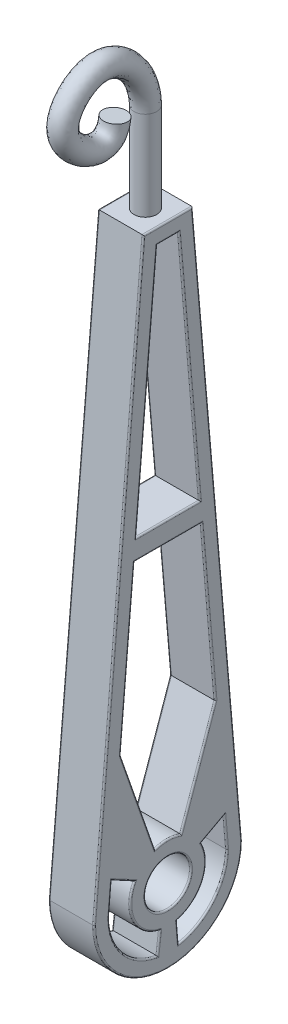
ISO-10303-21;
HEADER;
FILE_DESCRIPTION(('STEP AP214'),'2;1');
FILE_NAME('part.step','',(''),(''),'','','');
FILE_SCHEMA(('AUTOMOTIVE_DESIGN { 1 0 10303 214 1 1 1 1 }'));
ENDSEC;
DATA;
#1=APPLICATION_CONTEXT('core data for automotive mechanical design processes');
#2=APPLICATION_PROTOCOL_DEFINITION('international standard','automotive_design',2000,#1);
#3=PRODUCT_CONTEXT('',#1,'mechanical');
#4=PRODUCT('Part','Part','',(#3));
#5=PRODUCT_RELATED_PRODUCT_CATEGORY('part','',(#4));
#6=PRODUCT_DEFINITION_FORMATION('','',#4);
#7=PRODUCT_DEFINITION_CONTEXT('part definition',#1,'design');
#8=PRODUCT_DEFINITION('design','',#6,#7);
#9=PRODUCT_DEFINITION_SHAPE('','',#8);
#10=(LENGTH_UNIT() NAMED_UNIT(*) SI_UNIT(.MILLI.,.METRE.));
#11=(NAMED_UNIT(*) PLANE_ANGLE_UNIT() SI_UNIT($,.RADIAN.));
#12=(NAMED_UNIT(*) SI_UNIT($,.STERADIAN.) SOLID_ANGLE_UNIT());
#13=UNCERTAINTY_MEASURE_WITH_UNIT(LENGTH_MEASURE(1.E-05),#10,'distance_accuracy_value','');
#14=(GEOMETRIC_REPRESENTATION_CONTEXT(3) GLOBAL_UNCERTAINTY_ASSIGNED_CONTEXT((#13)) GLOBAL_UNIT_ASSIGNED_CONTEXT((#10,
#11,#12)) REPRESENTATION_CONTEXT('',''));
#15=CARTESIAN_POINT('',(0.,0.,0.));
#16=DIRECTION('',(0.,0.,1.));
#17=DIRECTION('',(1.,0.,0.));
#18=AXIS2_PLACEMENT_3D('',#15,#16,#17);
#19=CARTESIAN_POINT('',(15.,4.17479059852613,48.4235530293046));
#20=DIRECTION('',(0.,0.0858954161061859,0.99630415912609));
#21=DIRECTION('',(0.,-0.99630415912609,0.0858954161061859));
#22=AXIS2_PLACEMENT_3D('',#19,#20,#21);
#23=PLANE('',#22);
#24=DIRECTION('',(-1.,0.,0.));
#25=VECTOR('',#24,1.);
#26=CARTESIAN_POINT('',(15.,0.,48.7834786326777));
#27=LINE('',#26,#25);
#28=CARTESIAN_POINT('',(14.,0.,48.7834786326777));
#29=VERTEX_POINT('',#28);
#30=CARTESIAN_POINT('',(-14.,0.,48.7834786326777));
#31=VERTEX_POINT('',#30);
#32=EDGE_CURVE('E378',#29,#31,#27,.T.);
#33=ORIENTED_EDGE('',*,*,#32,.F.);
#34=DIRECTION('',(0.,0.99630415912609,-0.0858954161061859));
#35=VECTOR('',#34,1.);
#36=CARTESIAN_POINT('',(14.,4.17479059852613,48.4235530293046));
#37=LINE('',#36,#35);
#38=CARTESIAN_POINT('',(14.,377.549453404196,16.2334113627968));
#39=VERTEX_POINT('',#38);
#40=EDGE_CURVE('E513',#29,#39,#37,.T.);
#41=ORIENTED_EDGE('',*,*,#40,.T.);
#42=DIRECTION('',(-1.,0.,0.));
#43=VECTOR('',#42,1.);
#44=CARTESIAN_POINT('',(15.,377.549453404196,16.2334113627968));
#45=LINE('',#44,#43);
#46=CARTESIAN_POINT('',(-14.,377.549453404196,16.2334113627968));
#47=VERTEX_POINT('',#46);
#48=EDGE_CURVE('E368',#39,#47,#45,.T.);
#49=ORIENTED_EDGE('',*,*,#48,.T.);
#50=DIRECTION('',(0.,0.99630415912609,-0.0858954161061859));
#51=VECTOR('',#50,1.);
#52=CARTESIAN_POINT('',(-14.,0.,48.7834786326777));
#53=LINE('',#52,#51);
#54=EDGE_CURVE('E511',#47,#31,#53,.F.);
#55=ORIENTED_EDGE('',*,*,#54,.T.);
#56=EDGE_LOOP('',(#33,#41,#49,#55));
#57=FACE_BOUND('',#56,.T.);
#58=ADVANCED_FACE('F47',(#57),#23,.T.);
#59=CARTESIAN_POINT('',(15.,0.,0.));
#60=DIRECTION('',(-1.,0.,0.));
#61=DIRECTION('',(0.,0.,1.));
#62=AXIS2_PLACEMENT_3D('',#59,#60,#61);
#63=CYLINDRICAL_SURFACE('',#62,48.7834786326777);
#64=DIRECTION('',(-1.,0.,0.));
#65=VECTOR('',#64,1.);
#66=CARTESIAN_POINT('',(15.,0.,-48.7834786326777));
#67=LINE('',#66,#65);
#68=CARTESIAN_POINT('',(14.,0.,-48.7834786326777));
#69=VERTEX_POINT('',#68);
#70=CARTESIAN_POINT('',(-14.,0.,-48.7834786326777));
#71=VERTEX_POINT('',#70);
#72=EDGE_CURVE('E375',#69,#71,#67,.T.);
#73=ORIENTED_EDGE('',*,*,#72,.F.);
#74=CARTESIAN_POINT('',(14.,0.,0.));
#75=DIRECTION('',(1.,0.,0.));
#76=DIRECTION('',(0.,0.,-1.));
#77=AXIS2_PLACEMENT_3D('',#74,#75,#76);
#78=CIRCLE('',#77,48.7834786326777);
#79=EDGE_CURVE('E509',#69,#29,#78,.F.);
#80=ORIENTED_EDGE('',*,*,#79,.T.);
#81=ORIENTED_EDGE('',*,*,#32,.T.);
#82=CARTESIAN_POINT('',(-14.,0.,0.));
#83=DIRECTION('',(1.,0.,0.));
#84=DIRECTION('',(0.,0.,-1.));
#85=AXIS2_PLACEMENT_3D('',#82,#83,#84);
#86=CIRCLE('',#85,48.7834786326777);
#87=EDGE_CURVE('E506',#31,#71,#86,.T.);
#88=ORIENTED_EDGE('',*,*,#87,.T.);
#89=EDGE_LOOP('',(#73,#80,#81,#88));
#90=FACE_BOUND('',#89,.T.);
#91=ADVANCED_FACE('F1019',(#90),#63,.T.);
#92=CARTESIAN_POINT('',(15.,4.17479059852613,-48.4235530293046));
#93=DIRECTION('',(0.,-0.0858954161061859,0.99630415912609));
#94=DIRECTION('',(0.,-0.99630415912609,-0.0858954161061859));
#95=AXIS2_PLACEMENT_3D('',#92,#93,#94);
#96=PLANE('',#95);
#97=DIRECTION('',(-1.,0.,0.));
#98=VECTOR('',#97,1.);
#99=CARTESIAN_POINT('',(15.,377.549453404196,-16.2334113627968));
#100=LINE('',#99,#98);
#101=CARTESIAN_POINT('',(14.,377.549453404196,-16.2334113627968));
#102=VERTEX_POINT('',#101);
#103=CARTESIAN_POINT('',(-14.,377.549453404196,-16.2334113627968));
#104=VERTEX_POINT('',#103);
#105=EDGE_CURVE('E371',#102,#104,#100,.T.);
#106=ORIENTED_EDGE('',*,*,#105,.F.);
#107=DIRECTION('',(0.,0.99630415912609,0.0858954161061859));
#108=VECTOR('',#107,1.);
#109=CARTESIAN_POINT('',(14.,0.,-48.7834786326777));
#110=LINE('',#109,#108);
#111=EDGE_CURVE('E504',#102,#69,#110,.F.);
#112=ORIENTED_EDGE('',*,*,#111,.T.);
#113=ORIENTED_EDGE('',*,*,#72,.T.);
#114=DIRECTION('',(0.,0.99630415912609,0.0858954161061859));
#115=VECTOR('',#114,1.);
#116=CARTESIAN_POINT('',(-14.,4.17479059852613,-48.4235530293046));
#117=LINE('',#116,#115);
#118=EDGE_CURVE('E502',#71,#104,#117,.T.);
#119=ORIENTED_EDGE('',*,*,#118,.T.);
#120=EDGE_LOOP('',(#106,#112,#113,#119));
#121=FACE_BOUND('',#120,.T.);
#122=ADVANCED_FACE('F1025',(#121),#96,.F.);
#123=CARTESIAN_POINT('',(15.,3.31583643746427,-38.4605114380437));
#124=DIRECTION('',(0.,-0.0858954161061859,0.99630415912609));
#125=DIRECTION('',(0.,-0.99630415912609,-0.0858954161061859));
#126=AXIS2_PLACEMENT_3D('',#123,#124,#125);
#127=PLANE('',#126);
#128=DIRECTION('',(-1.,0.,0.));
#129=VECTOR('',#128,1.);
#130=CARTESIAN_POINT('',(15.,207.440498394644,-20.8620977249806));
#131=LINE('',#130,#129);
#132=CARTESIAN_POINT('',(14.,207.440498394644,-20.8620977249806));
#133=VERTEX_POINT('',#132);
#134=CARTESIAN_POINT('',(-14.,207.440498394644,-20.8620977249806));
#135=VERTEX_POINT('',#134);
#136=EDGE_CURVE('E372',#133,#135,#131,.T.);
#137=ORIENTED_EDGE('',*,*,#136,.F.);
#138=DIRECTION('',(0.,0.99630415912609,0.0858954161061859));
#139=VECTOR('',#138,1.);
#140=CARTESIAN_POINT('',(14.,3.31583643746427,-38.4605114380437));
#141=LINE('',#140,#139);
#142=CARTESIAN_POINT('',(14.,367.549453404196,-7.05845635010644));
#143=VERTEX_POINT('',#142);
#144=EDGE_CURVE('E531',#133,#143,#141,.T.);
#145=ORIENTED_EDGE('',*,*,#144,.T.);
#146=DIRECTION('',(-1.,0.,0.));
#147=VECTOR('',#146,1.);
#148=CARTESIAN_POINT('',(15.,367.549453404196,-7.05845635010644));
#149=LINE('',#148,#147);
#150=CARTESIAN_POINT('',(-14.,367.549453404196,-7.05845635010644));
#151=VERTEX_POINT('',#150);
#152=EDGE_CURVE('E382',#143,#151,#149,.T.);
#153=ORIENTED_EDGE('',*,*,#152,.T.);
#154=DIRECTION('',(0.,0.99630415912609,0.0858954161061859));
#155=VECTOR('',#154,1.);
#156=CARTESIAN_POINT('',(-14.,207.440498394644,-20.8620977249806));
#157=LINE('',#156,#155);
#158=EDGE_CURVE('E529',#151,#135,#157,.F.);
#159=ORIENTED_EDGE('',*,*,#158,.T.);
#160=EDGE_LOOP('',(#137,#145,#153,#159));
#161=FACE_BOUND('',#160,.T.);
#162=ADVANCED_FACE('F1045',(#161),#127,.T.);
#163=CARTESIAN_POINT('',(15.,207.440498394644,0.));
#164=DIRECTION('',(0.,1.,0.));
#165=DIRECTION('',(0.,0.,1.));
#166=AXIS2_PLACEMENT_3D('',#163,#164,#165);
#167=PLANE('',#166);
#168=DIRECTION('',(-1.,0.,0.));
#169=VECTOR('',#168,1.);
#170=CARTESIAN_POINT('',(15.,207.440498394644,20.8620977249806));
#171=LINE('',#170,#169);
#172=CARTESIAN_POINT('',(14.,207.440498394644,20.8620977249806));
#173=VERTEX_POINT('',#172);
#174=CARTESIAN_POINT('',(-14.,207.440498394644,20.8620977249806));
#175=VERTEX_POINT('',#174);
#176=EDGE_CURVE('E389',#173,#175,#171,.T.);
#177=ORIENTED_EDGE('',*,*,#176,.F.);
#178=DIRECTION('',(0.,0.,-1.));
#179=VECTOR('',#178,1.);
#180=CARTESIAN_POINT('',(14.,207.440498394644,0.));
#181=LINE('',#180,#179);
#182=EDGE_CURVE('E527',#173,#133,#181,.T.);
#183=ORIENTED_EDGE('',*,*,#182,.T.);
#184=ORIENTED_EDGE('',*,*,#136,.T.);
#185=DIRECTION('',(0.,0.,-1.));
#186=VECTOR('',#185,1.);
#187=CARTESIAN_POINT('',(-14.,207.440498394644,20.8620977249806));
#188=LINE('',#187,#186);
#189=EDGE_CURVE('E524',#135,#175,#188,.F.);
#190=ORIENTED_EDGE('',*,*,#189,.T.);
#191=EDGE_LOOP('',(#177,#183,#184,#190));
#192=FACE_BOUND('',#191,.T.);
#193=ADVANCED_FACE('F1041',(#192),#167,.T.);
#194=CARTESIAN_POINT('',(15.,3.31583643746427,38.4605114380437));
#195=DIRECTION('',(0.,0.0858954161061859,0.99630415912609));
#196=DIRECTION('',(0.,-0.99630415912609,0.0858954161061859));
#197=AXIS2_PLACEMENT_3D('',#194,#195,#196);
#198=PLANE('',#197);
#199=DIRECTION('',(-1.,0.,0.));
#200=VECTOR('',#199,1.);
#201=CARTESIAN_POINT('',(15.,367.549453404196,7.05845635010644));
#202=LINE('',#201,#200);
#203=CARTESIAN_POINT('',(14.,367.549453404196,7.05845635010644));
#204=VERTEX_POINT('',#203);
#205=CARTESIAN_POINT('',(-14.,367.549453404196,7.05845635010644));
#206=VERTEX_POINT('',#205);
#207=EDGE_CURVE('E385',#204,#206,#202,.T.);
#208=ORIENTED_EDGE('',*,*,#207,.F.);
#209=DIRECTION('',(0.,0.99630415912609,-0.0858954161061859));
#210=VECTOR('',#209,1.);
#211=CARTESIAN_POINT('',(14.,207.440498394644,20.8620977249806));
#212=LINE('',#211,#210);
#213=EDGE_CURVE('E522',#204,#173,#212,.F.);
#214=ORIENTED_EDGE('',*,*,#213,.T.);
#215=ORIENTED_EDGE('',*,*,#176,.T.);
#216=DIRECTION('',(0.,0.99630415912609,-0.0858954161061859));
#217=VECTOR('',#216,1.);
#218=CARTESIAN_POINT('',(-14.,3.31583643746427,38.4605114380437));
#219=LINE('',#218,#217);
#220=EDGE_CURVE('E520',#175,#206,#219,.T.);
#221=ORIENTED_EDGE('',*,*,#220,.T.);
#222=EDGE_LOOP('',(#208,#214,#215,#221));
#223=FACE_BOUND('',#222,.T.);
#224=ADVANCED_FACE('F1037',(#223),#198,.F.);
#225=CARTESIAN_POINT('',(15.,0.,0.));
#226=DIRECTION('',(-1.,0.,0.));
#227=DIRECTION('',(0.,0.,1.));
#228=AXIS2_PLACEMENT_3D('',#225,#226,#227);
#229=CYLINDRICAL_SURFACE('',#228,25.);
#230=DIRECTION('',(-1.,0.,0.));
#231=VECTOR('',#230,1.);
#232=CARTESIAN_POINT('',(15.,11.8615665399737,-22.0068907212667));
#233=LINE('',#232,#231);
#234=CARTESIAN_POINT('',(14.,11.8615665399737,-22.0068907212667));
#235=VERTEX_POINT('',#234);
#236=CARTESIAN_POINT('',(-14.,11.8615665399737,-22.0068907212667));
#237=VERTEX_POINT('',#236);
#238=EDGE_CURVE('E386',#235,#237,#233,.T.);
#239=ORIENTED_EDGE('',*,*,#238,.F.);
#240=CARTESIAN_POINT('',(14.,0.,0.));
#241=DIRECTION('',(1.,0.,0.));
#242=DIRECTION('',(0.,0.,-1.));
#243=AXIS2_PLACEMENT_3D('',#240,#241,#242);
#244=CIRCLE('',#243,25.);
#245=CARTESIAN_POINT('',(14.,-24.2827660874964,-5.94535710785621));
#246=VERTEX_POINT('',#245);
#247=EDGE_CURVE('E553',#235,#246,#244,.F.);
#248=ORIENTED_EDGE('',*,*,#247,.T.);
#249=DIRECTION('',(-1.,0.,0.));
#250=VECTOR('',#249,1.);
#251=CARTESIAN_POINT('',(15.,-24.2827660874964,-5.94535710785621));
#252=LINE('',#251,#250);
#253=CARTESIAN_POINT('',(-14.,-24.2827660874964,-5.94535710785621));
#254=VERTEX_POINT('',#253);
#255=EDGE_CURVE('E394',#246,#254,#252,.T.);
#256=ORIENTED_EDGE('',*,*,#255,.T.);
#257=CARTESIAN_POINT('',(-14.,0.,0.));
#258=DIRECTION('',(1.,0.,0.));
#259=DIRECTION('',(0.,0.,-1.));
#260=AXIS2_PLACEMENT_3D('',#257,#258,#259);
#261=CIRCLE('',#260,25.);
#262=EDGE_CURVE('E551',#254,#237,#261,.T.);
#263=ORIENTED_EDGE('',*,*,#262,.T.);
#264=EDGE_LOOP('',(#239,#248,#256,#263));
#265=FACE_BOUND('',#264,.T.);
#266=ADVANCED_FACE('F1040',(#265),#229,.T.);
#267=CARTESIAN_POINT('',(15.,3.77177595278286E-13,2.03296194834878E-13));
#268=DIRECTION('',(0.,0.880275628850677,0.474462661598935));
#269=DIRECTION('',(0.,-0.474462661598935,0.880275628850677));
#270=AXIS2_PLACEMENT_3D('',#267,#268,#269);
#271=PLANE('',#270);
#272=DIRECTION('',(-1.,0.,0.));
#273=VECTOR('',#272,1.);
#274=CARTESIAN_POINT('',(15.,19.9566779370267,-37.0258371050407));
#275=LINE('',#274,#273);
#276=CARTESIAN_POINT('',(14.,19.9566779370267,-37.0258371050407));
#277=VERTEX_POINT('',#276);
#278=CARTESIAN_POINT('',(-14.,19.9566779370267,-37.0258371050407));
#279=VERTEX_POINT('',#278);
#280=EDGE_CURVE('E404',#277,#279,#275,.T.);
#281=ORIENTED_EDGE('',*,*,#280,.F.);
#282=DIRECTION('',(0.,0.474462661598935,-0.880275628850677));
#283=VECTOR('',#282,1.);
#284=CARTESIAN_POINT('',(14.,11.8615665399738,-22.0068907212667));
#285=LINE('',#284,#283);
#286=EDGE_CURVE('E549',#277,#235,#285,.F.);
#287=ORIENTED_EDGE('',*,*,#286,.T.);
#288=ORIENTED_EDGE('',*,*,#238,.T.);
#289=DIRECTION('',(0.,0.474462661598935,-0.880275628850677));
#290=VECTOR('',#289,1.);
#291=CARTESIAN_POINT('',(-14.,3.77177595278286E-13,2.03296194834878E-13));
#292=LINE('',#291,#290);
#293=EDGE_CURVE('E546',#237,#279,#292,.T.);
#294=ORIENTED_EDGE('',*,*,#293,.T.);
#295=EDGE_LOOP('',(#281,#287,#288,#294));
#296=FACE_BOUND('',#295,.T.);
#297=ADVANCED_FACE('F1062',(#296),#271,.F.);
#298=CARTESIAN_POINT('',(15.,3.31583643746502,-38.4605114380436));
#299=DIRECTION('',(0.,-0.0858954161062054,0.996304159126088));
#300=DIRECTION('',(0.,-0.996304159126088,-0.0858954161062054));
#301=AXIS2_PLACEMENT_3D('',#298,#299,#300);
#302=PLANE('',#301);
#303=DIRECTION('',(-1.,0.,0.));
#304=VECTOR('',#303,1.);
#305=CARTESIAN_POINT('',(15.,-0.405663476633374,-38.7813570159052));
#306=LINE('',#305,#304);
#307=CARTESIAN_POINT('',(14.,-0.405663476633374,-38.7813570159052));
#308=VERTEX_POINT('',#307);
#309=CARTESIAN_POINT('',(-14.,-0.405663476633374,-38.7813570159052));
#310=VERTEX_POINT('',#309);
#311=EDGE_CURVE('E401',#308,#310,#306,.T.);
#312=ORIENTED_EDGE('',*,*,#311,.F.);
#313=DIRECTION('',(0.,0.996304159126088,0.0858954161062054));
#314=VECTOR('',#313,1.);
#315=CARTESIAN_POINT('',(14.,3.31583643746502,-38.4605114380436));
#316=LINE('',#315,#314);
#317=EDGE_CURVE('E544',#308,#277,#316,.T.);
#318=ORIENTED_EDGE('',*,*,#317,.T.);
#319=ORIENTED_EDGE('',*,*,#280,.T.);
#320=DIRECTION('',(0.,0.996304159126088,0.0858954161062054));
#321=VECTOR('',#320,1.);
#322=CARTESIAN_POINT('',(-14.,-0.405663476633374,-38.7813570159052));
#323=LINE('',#322,#321);
#324=EDGE_CURVE('E542',#279,#310,#323,.F.);
#325=ORIENTED_EDGE('',*,*,#324,.T.);
#326=EDGE_LOOP('',(#312,#318,#319,#325));
#327=FACE_BOUND('',#326,.T.);
#328=ADVANCED_FACE('F1058',(#327),#302,.T.);
#329=CARTESIAN_POINT('',(15.,0.,0.));
#330=DIRECTION('',(-1.,0.,0.));
#331=DIRECTION('',(0.,0.,1.));
#332=AXIS2_PLACEMENT_3D('',#329,#330,#331);
#333=CYLINDRICAL_SURFACE('',#332,38.7834786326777);
#334=DIRECTION('',(-1.,0.,0.));
#335=VECTOR('',#334,1.);
#336=CARTESIAN_POINT('',(15.,-38.135762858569,-7.05845635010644));
#337=LINE('',#336,#335);
#338=CARTESIAN_POINT('',(14.,-38.135762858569,-7.05845635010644));
#339=VERTEX_POINT('',#338);
#340=CARTESIAN_POINT('',(-14.,-38.135762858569,-7.05845635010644));
#341=VERTEX_POINT('',#340);
#342=EDGE_CURVE('E397',#339,#341,#337,.T.);
#343=ORIENTED_EDGE('',*,*,#342,.F.);
#344=CARTESIAN_POINT('',(14.,0.,0.));
#345=DIRECTION('',(1.,0.,0.));
#346=DIRECTION('',(0.,0.,-1.));
#347=AXIS2_PLACEMENT_3D('',#344,#345,#346);
#348=CIRCLE('',#347,38.7834786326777);
#349=EDGE_CURVE('E540',#339,#308,#348,.T.);
#350=ORIENTED_EDGE('',*,*,#349,.T.);
#351=ORIENTED_EDGE('',*,*,#311,.T.);
#352=CARTESIAN_POINT('',(-14.,0.,0.));
#353=DIRECTION('',(1.,0.,0.));
#354=DIRECTION('',(0.,0.,-1.));
#355=AXIS2_PLACEMENT_3D('',#352,#353,#354);
#356=CIRCLE('',#355,38.7834786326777);
#357=EDGE_CURVE('E538',#310,#341,#356,.F.);
#358=ORIENTED_EDGE('',*,*,#357,.T.);
#359=EDGE_LOOP('',(#343,#350,#351,#358));
#360=FACE_BOUND('',#359,.T.);
#361=ADVANCED_FACE('F1054',(#360),#333,.F.);
#362=CARTESIAN_POINT('',(15.,-2.0767673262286E-13,1.11936366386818E-13));
#363=DIRECTION('',(0.,-0.880275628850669,0.474462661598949));
#364=DIRECTION('',(0.,-0.474462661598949,-0.880275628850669));
#365=AXIS2_PLACEMENT_3D('',#362,#363,#364);
#366=PLANE('',#365);
#367=DIRECTION('',(-1.,0.,0.));
#368=VECTOR('',#367,1.);
#369=CARTESIAN_POINT('',(15.,11.8615665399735,22.0068907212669));
#370=LINE('',#369,#368);
#371=CARTESIAN_POINT('',(14.,11.8615665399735,22.0068907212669));
#372=VERTEX_POINT('',#371);
#373=CARTESIAN_POINT('',(-14.,11.8615665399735,22.0068907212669));
#374=VERTEX_POINT('',#373);
#375=EDGE_CURVE('E398',#372,#374,#370,.T.);
#376=ORIENTED_EDGE('',*,*,#375,.F.);
#377=DIRECTION('',(0.,0.474462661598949,0.880275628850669));
#378=VECTOR('',#377,1.);
#379=CARTESIAN_POINT('',(14.,-2.0767673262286E-13,1.11936366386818E-13));
#380=LINE('',#379,#378);
#381=CARTESIAN_POINT('',(14.,19.9566779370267,37.0258371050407));
#382=VERTEX_POINT('',#381);
#383=EDGE_CURVE('E581',#372,#382,#380,.T.);
#384=ORIENTED_EDGE('',*,*,#383,.T.);
#385=DIRECTION('',(-1.,0.,0.));
#386=VECTOR('',#385,1.);
#387=CARTESIAN_POINT('',(15.,19.9566779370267,37.0258371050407));
#388=LINE('',#387,#386);
#389=CARTESIAN_POINT('',(-14.,19.9566779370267,37.0258371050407));
#390=VERTEX_POINT('',#389);
#391=EDGE_CURVE('E409',#382,#390,#388,.T.);
#392=ORIENTED_EDGE('',*,*,#391,.T.);
#393=DIRECTION('',(0.,0.474462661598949,0.880275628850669));
#394=VECTOR('',#393,1.);
#395=CARTESIAN_POINT('',(-14.,11.8615665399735,22.0068907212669));
#396=LINE('',#395,#394);
#397=EDGE_CURVE('E579',#390,#374,#396,.F.);
#398=ORIENTED_EDGE('',*,*,#397,.T.);
#399=EDGE_LOOP('',(#376,#384,#392,#398));
#400=FACE_BOUND('',#399,.T.);
#401=ADVANCED_FACE('F1057',(#400),#366,.T.);
#402=DIRECTION('',(-1.,0.,0.));
#403=VECTOR('',#402,1.);
#404=CARTESIAN_POINT('',(15.,-24.4163820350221,5.37031547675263));
#405=LINE('',#404,#403);
#406=CARTESIAN_POINT('',(14.,-24.4163820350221,5.37031547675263));
#407=VERTEX_POINT('',#406);
#408=CARTESIAN_POINT('',(-14.,-24.4163820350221,5.37031547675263));
#409=VERTEX_POINT('',#408);
#410=EDGE_CURVE('E419',#407,#409,#405,.T.);
#411=ORIENTED_EDGE('',*,*,#410,.F.);
#412=CARTESIAN_POINT('',(14.,0.,0.));
#413=DIRECTION('',(1.,0.,0.));
#414=DIRECTION('',(0.,0.,-1.));
#415=AXIS2_PLACEMENT_3D('',#412,#413,#414);
#416=CIRCLE('',#415,25.);
#417=EDGE_CURVE('E577',#407,#372,#416,.F.);
#418=ORIENTED_EDGE('',*,*,#417,.T.);
#419=ORIENTED_EDGE('',*,*,#375,.T.);
#420=CARTESIAN_POINT('',(-14.,0.,0.));
#421=DIRECTION('',(1.,0.,0.));
#422=DIRECTION('',(0.,0.,-1.));
#423=AXIS2_PLACEMENT_3D('',#420,#421,#422);
#424=CIRCLE('',#423,25.);
#425=EDGE_CURVE('E574',#374,#409,#424,.T.);
#426=ORIENTED_EDGE('',*,*,#425,.T.);
#427=EDGE_LOOP('',(#411,#418,#419,#426));
#428=FACE_BOUND('',#427,.T.);
#429=ADVANCED_FACE('F1071',(#428),#229,.T.);
#430=CARTESIAN_POINT('',(15.,0.286780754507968,2.33064339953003));
#431=DIRECTION('',(0.,-0.122126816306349,-0.992514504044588));
#432=DIRECTION('',(0.,0.992514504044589,-0.122126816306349));
#433=AXIS2_PLACEMENT_3D('',#430,#431,#432);
#434=PLANE('',#433);
#435=DIRECTION('',(-1.,0.,0.));
#436=VECTOR('',#435,1.);
#437=CARTESIAN_POINT('',(15.,-38.135762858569,7.05845635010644));
#438=LINE('',#437,#436);
#439=CARTESIAN_POINT('',(14.,-38.135762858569,7.05845635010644));
#440=VERTEX_POINT('',#439);
#441=CARTESIAN_POINT('',(-14.,-38.135762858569,7.05845635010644));
#442=VERTEX_POINT('',#441);
#443=EDGE_CURVE('E416',#440,#442,#438,.T.);
#444=ORIENTED_EDGE('',*,*,#443,.F.);
#445=DIRECTION('',(0.,-0.992514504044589,0.122126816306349));
#446=VECTOR('',#445,1.);
#447=CARTESIAN_POINT('',(14.,-24.4163820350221,5.37031547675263));
#448=LINE('',#447,#446);
#449=EDGE_CURVE('E572',#440,#407,#448,.F.);
#450=ORIENTED_EDGE('',*,*,#449,.T.);
#451=ORIENTED_EDGE('',*,*,#410,.T.);
#452=DIRECTION('',(0.,-0.992514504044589,0.122126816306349));
#453=VECTOR('',#452,1.);
#454=CARTESIAN_POINT('',(-14.,0.286780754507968,2.33064339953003));
#455=LINE('',#454,#453);
#456=EDGE_CURVE('E570',#409,#442,#455,.T.);
#457=ORIENTED_EDGE('',*,*,#456,.T.);
#458=EDGE_LOOP('',(#444,#450,#451,#457));
#459=FACE_BOUND('',#458,.T.);
#460=ADVANCED_FACE('F1084',(#459),#434,.F.);
#461=CARTESIAN_POINT('',(15.,0.,0.));
#462=DIRECTION('',(-1.,0.,0.));
#463=DIRECTION('',(0.,0.,1.));
#464=AXIS2_PLACEMENT_3D('',#461,#462,#463);
#465=CYLINDRICAL_SURFACE('',#464,38.7834786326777);
#466=DIRECTION('',(-1.,0.,0.));
#467=VECTOR('',#466,1.);
#468=CARTESIAN_POINT('',(15.,-0.405663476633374,38.7813570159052));
#469=LINE('',#468,#467);
#470=CARTESIAN_POINT('',(14.,-0.405663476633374,38.7813570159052));
#471=VERTEX_POINT('',#470);
#472=CARTESIAN_POINT('',(-14.,-0.405663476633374,38.7813570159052));
#473=VERTEX_POINT('',#472);
#474=EDGE_CURVE('E412',#471,#473,#469,.T.);
#475=ORIENTED_EDGE('',*,*,#474,.F.);
#476=CARTESIAN_POINT('',(14.,0.,0.));
#477=DIRECTION('',(1.,0.,0.));
#478=DIRECTION('',(0.,0.,-1.));
#479=AXIS2_PLACEMENT_3D('',#476,#477,#478);
#480=CIRCLE('',#479,38.7834786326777);
#481=EDGE_CURVE('E568',#471,#440,#480,.T.);
#482=ORIENTED_EDGE('',*,*,#481,.T.);
#483=ORIENTED_EDGE('',*,*,#443,.T.);
#484=CARTESIAN_POINT('',(-14.,0.,0.));
#485=DIRECTION('',(1.,0.,0.));
#486=DIRECTION('',(0.,0.,-1.));
#487=AXIS2_PLACEMENT_3D('',#484,#485,#486);
#488=CIRCLE('',#487,38.7834786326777);
#489=EDGE_CURVE('E566',#442,#473,#488,.F.);
#490=ORIENTED_EDGE('',*,*,#489,.T.);
#491=EDGE_LOOP('',(#475,#482,#483,#490));
#492=FACE_BOUND('',#491,.T.);
#493=ADVANCED_FACE('F1080',(#492),#465,.F.);
#494=CARTESIAN_POINT('',(15.,-0.102540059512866,-0.294185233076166));
#495=DIRECTION('',(0.,0.32913550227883,0.944282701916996));
#496=DIRECTION('',(0.,-0.944282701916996,0.32913550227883));
#497=AXIS2_PLACEMENT_3D('',#494,#495,#496);
#498=PLANE('',#497);
#499=DIRECTION('',(-1.,0.,0.));
#500=VECTOR('',#499,1.);
#501=CARTESIAN_POINT('',(15.,23.5026943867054,-8.52193385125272));
#502=LINE('',#501,#500);
#503=CARTESIAN_POINT('',(14.,23.5026943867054,-8.52193385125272));
#504=VERTEX_POINT('',#503);
#505=CARTESIAN_POINT('',(-14.,23.5026943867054,-8.52193385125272));
#506=VERTEX_POINT('',#505);
#507=EDGE_CURVE('E413',#504,#506,#502,.T.);
#508=ORIENTED_EDGE('',*,*,#507,.F.);
#509=DIRECTION('',(0.,0.944282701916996,-0.32913550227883));
#510=VECTOR('',#509,1.);
#511=CARTESIAN_POINT('',(14.,-0.102540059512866,-0.294185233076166));
#512=LINE('',#511,#510);
#513=CARTESIAN_POINT('',(14.,88.3603816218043,-31.1284768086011));
#514=VERTEX_POINT('',#513);
#515=EDGE_CURVE('E607',#504,#514,#512,.T.);
#516=ORIENTED_EDGE('',*,*,#515,.T.);
#517=DIRECTION('',(-1.,0.,0.));
#518=VECTOR('',#517,1.);
#519=CARTESIAN_POINT('',(15.,88.3603816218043,-31.1284768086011));
#520=LINE('',#519,#518);
#521=CARTESIAN_POINT('',(-14.,88.3603816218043,-31.1284768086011));
#522=VERTEX_POINT('',#521);
#523=EDGE_CURVE('E424',#514,#522,#520,.T.);
#524=ORIENTED_EDGE('',*,*,#523,.T.);
#525=DIRECTION('',(0.,0.944282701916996,-0.32913550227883));
#526=VECTOR('',#525,1.);
#527=CARTESIAN_POINT('',(-14.,23.5026943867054,-8.52193385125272));
#528=LINE('',#527,#526);
#529=EDGE_CURVE('E605',#522,#506,#528,.F.);
#530=ORIENTED_EDGE('',*,*,#529,.T.);
#531=EDGE_LOOP('',(#508,#516,#524,#530));
#532=FACE_BOUND('',#531,.T.);
#533=ADVANCED_FACE('F1083',(#532),#498,.T.);
#534=DIRECTION('',(-1.,0.,0.));
#535=VECTOR('',#534,1.);
#536=CARTESIAN_POINT('',(15.,23.5026943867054,8.52193385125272));
#537=LINE('',#536,#535);
#538=CARTESIAN_POINT('',(14.,23.5026943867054,8.52193385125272));
#539=VERTEX_POINT('',#538);
#540=CARTESIAN_POINT('',(-14.,23.5026943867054,8.52193385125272));
#541=VERTEX_POINT('',#540);
#542=EDGE_CURVE('E437',#539,#541,#537,.T.);
#543=ORIENTED_EDGE('',*,*,#542,.F.);
#544=CARTESIAN_POINT('',(14.,0.,0.));
#545=DIRECTION('',(1.,0.,0.));
#546=DIRECTION('',(0.,0.,-1.));
#547=AXIS2_PLACEMENT_3D('',#544,#545,#546);
#548=CIRCLE('',#547,25.);
#549=EDGE_CURVE('E603',#539,#504,#548,.F.);
#550=ORIENTED_EDGE('',*,*,#549,.T.);
#551=ORIENTED_EDGE('',*,*,#507,.T.);
#552=CARTESIAN_POINT('',(-14.,0.,0.));
#553=DIRECTION('',(1.,0.,0.));
#554=DIRECTION('',(0.,0.,-1.));
#555=AXIS2_PLACEMENT_3D('',#552,#553,#554);
#556=CIRCLE('',#555,25.);
#557=EDGE_CURVE('E600',#506,#541,#556,.T.);
#558=ORIENTED_EDGE('',*,*,#557,.T.);
#559=EDGE_LOOP('',(#543,#550,#551,#558));
#560=FACE_BOUND('',#559,.T.);
#561=ADVANCED_FACE('F1070',(#560),#229,.T.);
#562=CARTESIAN_POINT('',(15.,-0.102540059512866,0.294185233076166));
#563=DIRECTION('',(0.,-0.32913550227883,0.944282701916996));
#564=DIRECTION('',(0.,-0.944282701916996,-0.32913550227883));
#565=AXIS2_PLACEMENT_3D('',#562,#563,#564);
#566=PLANE('',#565);
#567=DIRECTION('',(-1.,0.,0.));
#568=VECTOR('',#567,1.);
#569=CARTESIAN_POINT('',(15.,88.3603816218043,31.1284768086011));
#570=LINE('',#569,#568);
#571=CARTESIAN_POINT('',(14.,88.3603816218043,31.1284768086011));
#572=VERTEX_POINT('',#571);
#573=CARTESIAN_POINT('',(-14.,88.3603816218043,31.1284768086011));
#574=VERTEX_POINT('',#573);
#575=EDGE_CURVE('E434',#572,#574,#570,.T.);
#576=ORIENTED_EDGE('',*,*,#575,.F.);
#577=DIRECTION('',(0.,0.944282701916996,0.32913550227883));
#578=VECTOR('',#577,1.);
#579=CARTESIAN_POINT('',(14.,23.5026943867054,8.52193385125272));
#580=LINE('',#579,#578);
#581=EDGE_CURVE('E598',#572,#539,#580,.F.);
#582=ORIENTED_EDGE('',*,*,#581,.T.);
#583=ORIENTED_EDGE('',*,*,#542,.T.);
#584=DIRECTION('',(0.,0.944282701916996,0.32913550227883));
#585=VECTOR('',#584,1.);
#586=CARTESIAN_POINT('',(-14.,-0.102540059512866,0.294185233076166));
#587=LINE('',#586,#585);
#588=EDGE_CURVE('E596',#541,#574,#587,.T.);
#589=ORIENTED_EDGE('',*,*,#588,.T.);
#590=EDGE_LOOP('',(#576,#582,#583,#589));
#591=FACE_BOUND('',#590,.T.);
#592=ADVANCED_FACE('F1102',(#591),#566,.F.);
#593=CARTESIAN_POINT('',(15.,3.31583643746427,38.4605114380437));
#594=DIRECTION('',(0.,0.0858954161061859,0.99630415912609));
#595=DIRECTION('',(0.,-0.99630415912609,0.0858954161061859));
#596=AXIS2_PLACEMENT_3D('',#593,#594,#595);
#597=PLANE('',#596);
#598=DIRECTION('',(-1.,0.,0.));
#599=VECTOR('',#598,1.);
#600=CARTESIAN_POINT('',(15.,194.167064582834,22.0064542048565));
#601=LINE('',#600,#599);
#602=CARTESIAN_POINT('',(14.,194.167064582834,22.0064542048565));
#603=VERTEX_POINT('',#602);
#604=CARTESIAN_POINT('',(-14.,194.167064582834,22.0064542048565));
#605=VERTEX_POINT('',#604);
#606=EDGE_CURVE('E431',#603,#605,#601,.T.);
#607=ORIENTED_EDGE('',*,*,#606,.F.);
#608=DIRECTION('',(0.,0.99630415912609,-0.0858954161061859));
#609=VECTOR('',#608,1.);
#610=CARTESIAN_POINT('',(14.,88.3603816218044,31.1284768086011));
#611=LINE('',#610,#609);
#612=EDGE_CURVE('E594',#603,#572,#611,.F.);
#613=ORIENTED_EDGE('',*,*,#612,.T.);
#614=ORIENTED_EDGE('',*,*,#575,.T.);
#615=DIRECTION('',(0.,0.99630415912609,-0.0858954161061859));
#616=VECTOR('',#615,1.);
#617=CARTESIAN_POINT('',(-14.,3.31583643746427,38.4605114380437));
#618=LINE('',#617,#616);
#619=EDGE_CURVE('E592',#574,#605,#618,.T.);
#620=ORIENTED_EDGE('',*,*,#619,.T.);
#621=EDGE_LOOP('',(#607,#613,#614,#620));
#622=FACE_BOUND('',#621,.T.);
#623=ADVANCED_FACE('F1098',(#622),#597,.F.);
#624=CARTESIAN_POINT('',(15.,194.167064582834,0.));
#625=DIRECTION('',(0.,1.,0.));
#626=DIRECTION('',(0.,0.,1.));
#627=AXIS2_PLACEMENT_3D('',#624,#625,#626);
#628=PLANE('',#627);
#629=DIRECTION('',(-1.,0.,0.));
#630=VECTOR('',#629,1.);
#631=CARTESIAN_POINT('',(15.,194.167064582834,-22.0064542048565));
#632=LINE('',#631,#630);
#633=CARTESIAN_POINT('',(14.,194.167064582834,-22.0064542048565));
#634=VERTEX_POINT('',#633);
#635=CARTESIAN_POINT('',(-14.,194.167064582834,-22.0064542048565));
#636=VERTEX_POINT('',#635);
#637=EDGE_CURVE('E427',#634,#636,#632,.T.);
#638=ORIENTED_EDGE('',*,*,#637,.F.);
#639=DIRECTION('',(0.,0.,-1.));
#640=VECTOR('',#639,1.);
#641=CARTESIAN_POINT('',(14.,194.167064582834,22.0064542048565));
#642=LINE('',#641,#640);
#643=EDGE_CURVE('E590',#634,#603,#642,.F.);
#644=ORIENTED_EDGE('',*,*,#643,.T.);
#645=ORIENTED_EDGE('',*,*,#606,.T.);
#646=DIRECTION('',(0.,0.,-1.));
#647=VECTOR('',#646,1.);
#648=CARTESIAN_POINT('',(-14.,194.167064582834,0.));
#649=LINE('',#648,#647);
#650=EDGE_CURVE('E588',#605,#636,#649,.T.);
#651=ORIENTED_EDGE('',*,*,#650,.T.);
#652=EDGE_LOOP('',(#638,#644,#645,#651));
#653=FACE_BOUND('',#652,.T.);
#654=ADVANCED_FACE('F1035',(#653),#628,.F.);
#655=CARTESIAN_POINT('',(15.,367.549453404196,0.));
#656=DIRECTION('',(0.,1.,0.));
#657=DIRECTION('',(0.,0.,1.));
#658=AXIS2_PLACEMENT_3D('',#655,#656,#657);
#659=PLANE('',#658);
#660=ORIENTED_EDGE('',*,*,#152,.F.);
#661=DIRECTION('',(0.,0.,-1.));
#662=VECTOR('',#661,1.);
#663=CARTESIAN_POINT('',(14.,367.549453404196,7.05845635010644));
#664=LINE('',#663,#662);
#665=EDGE_CURVE('E517',#143,#204,#664,.F.);
#666=ORIENTED_EDGE('',*,*,#665,.T.);
#667=ORIENTED_EDGE('',*,*,#207,.T.);
#668=DIRECTION('',(0.,0.,-1.));
#669=VECTOR('',#668,1.);
#670=CARTESIAN_POINT('',(-14.,367.549453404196,0.));
#671=LINE('',#670,#669);
#672=EDGE_CURVE('E515',#206,#151,#671,.T.);
#673=ORIENTED_EDGE('',*,*,#672,.T.);
#674=EDGE_LOOP('',(#660,#666,#667,#673));
#675=FACE_BOUND('',#674,.T.);
#676=ADVANCED_FACE('F1031',(#675),#659,.F.);
#677=CARTESIAN_POINT('',(15.,0.318879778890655,-3.96859541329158));
#678=DIRECTION('',(0.,0.0800926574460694,-0.996787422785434));
#679=DIRECTION('',(0.,0.996787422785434,0.0800926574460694));
#680=AXIS2_PLACEMENT_3D('',#677,#678,#679);
#681=PLANE('',#680);
#682=ORIENTED_EDGE('',*,*,#255,.F.);
#683=DIRECTION('',(0.,-0.996787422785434,-0.0800926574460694));
#684=VECTOR('',#683,1.);
#685=CARTESIAN_POINT('',(14.,0.318879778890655,-3.96859541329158));
#686=LINE('',#685,#684);
#687=EDGE_CURVE('E535',#246,#339,#686,.T.);
#688=ORIENTED_EDGE('',*,*,#687,.T.);
#689=ORIENTED_EDGE('',*,*,#342,.T.);
#690=DIRECTION('',(0.,-0.996787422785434,-0.0800926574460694));
#691=VECTOR('',#690,1.);
#692=CARTESIAN_POINT('',(-14.,-24.2827660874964,-5.94535710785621));
#693=LINE('',#692,#691);
#694=EDGE_CURVE('E533',#341,#254,#693,.F.);
#695=ORIENTED_EDGE('',*,*,#694,.T.);
#696=EDGE_LOOP('',(#682,#688,#689,#695));
#697=FACE_BOUND('',#696,.T.);
#698=ADVANCED_FACE('F1034',(#697),#681,.T.);
#699=CARTESIAN_POINT('',(15.,0.,0.));
#700=DIRECTION('',(-1.,0.,0.));
#701=DIRECTION('',(0.,0.,1.));
#702=AXIS2_PLACEMENT_3D('',#699,#700,#701);
#703=CYLINDRICAL_SURFACE('',#702,15.);
#704=CARTESIAN_POINT('',(14.,0.,0.));
#705=DIRECTION('',(1.,0.,0.));
#706=DIRECTION('',(0.,0.,-1.));
#707=AXIS2_PLACEMENT_3D('',#704,#705,#706);
#708=CIRCLE('',#707,15.);
#709=CARTESIAN_POINT('',(14.,0.,-15.));
#710=VERTEX_POINT('',#709);
#711=EDGE_CURVE('E558',#710,#710,#708,.T.);
#712=ORIENTED_EDGE('',*,*,#711,.T.);
#713=EDGE_LOOP('',(#712));
#714=FACE_BOUND('',#713,.T.);
#715=CARTESIAN_POINT('',(-14.,0.,0.));
#716=DIRECTION('',(1.,0.,0.));
#717=DIRECTION('',(0.,0.,-1.));
#718=AXIS2_PLACEMENT_3D('',#715,#716,#717);
#719=CIRCLE('',#718,15.);
#720=CARTESIAN_POINT('',(-14.,0.,-15.));
#721=VERTEX_POINT('',#720);
#722=EDGE_CURVE('E555',#721,#721,#719,.F.);
#723=ORIENTED_EDGE('',*,*,#722,.T.);
#724=EDGE_LOOP('',(#723));
#725=FACE_BOUND('',#724,.T.);
#726=ADVANCED_FACE('F1052',(#714,#725),#703,.F.);
#727=CARTESIAN_POINT('',(15.,3.31583643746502,38.4605114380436));
#728=DIRECTION('',(0.,0.0858954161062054,0.996304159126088));
#729=DIRECTION('',(0.,-0.996304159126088,0.0858954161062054));
#730=AXIS2_PLACEMENT_3D('',#727,#728,#729);
#731=PLANE('',#730);
#732=ORIENTED_EDGE('',*,*,#391,.F.);
#733=DIRECTION('',(0.,0.996304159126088,-0.0858954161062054));
#734=VECTOR('',#733,1.);
#735=CARTESIAN_POINT('',(14.,-0.405663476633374,38.7813570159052));
#736=LINE('',#735,#734);
#737=EDGE_CURVE('E563',#382,#471,#736,.F.);
#738=ORIENTED_EDGE('',*,*,#737,.T.);
#739=ORIENTED_EDGE('',*,*,#474,.T.);
#740=DIRECTION('',(0.,0.996304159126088,-0.0858954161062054));
#741=VECTOR('',#740,1.);
#742=CARTESIAN_POINT('',(-14.,3.31583643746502,38.4605114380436));
#743=LINE('',#742,#741);
#744=EDGE_CURVE('E561',#473,#390,#743,.T.);
#745=ORIENTED_EDGE('',*,*,#744,.T.);
#746=EDGE_LOOP('',(#732,#738,#739,#745));
#747=FACE_BOUND('',#746,.T.);
#748=ADVANCED_FACE('F1074',(#747),#731,.F.);
#749=CARTESIAN_POINT('',(15.,3.31583643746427,-38.4605114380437));
#750=DIRECTION('',(0.,-0.0858954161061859,0.99630415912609));
#751=DIRECTION('',(0.,-0.99630415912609,-0.0858954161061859));
#752=AXIS2_PLACEMENT_3D('',#749,#750,#751);
#753=PLANE('',#752);
#754=ORIENTED_EDGE('',*,*,#523,.F.);
#755=DIRECTION('',(0.,0.99630415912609,0.0858954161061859));
#756=VECTOR('',#755,1.);
#757=CARTESIAN_POINT('',(14.,3.31583643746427,-38.4605114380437));
#758=LINE('',#757,#756);
#759=EDGE_CURVE('E585',#514,#634,#758,.T.);
#760=ORIENTED_EDGE('',*,*,#759,.T.);
#761=ORIENTED_EDGE('',*,*,#637,.T.);
#762=DIRECTION('',(0.,0.99630415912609,0.0858954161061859));
#763=VECTOR('',#762,1.);
#764=CARTESIAN_POINT('',(-14.,88.3603816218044,-31.1284768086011));
#765=LINE('',#764,#763);
#766=EDGE_CURVE('E583',#636,#522,#765,.F.);
#767=ORIENTED_EDGE('',*,*,#766,.T.);
#768=EDGE_LOOP('',(#754,#760,#761,#767));
#769=FACE_BOUND('',#768,.T.);
#770=ADVANCED_FACE('F1078',(#769),#753,.T.);
#771=CARTESIAN_POINT('',(15.,377.549453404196,0.));
#772=DIRECTION('',(0.,1.,0.));
#773=DIRECTION('',(0.,0.,1.));
#774=AXIS2_PLACEMENT_3D('',#771,#772,#773);
#775=PLANE('',#774);
#776=CARTESIAN_POINT('',(0.,377.549453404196,0.));
#777=DIRECTION('',(0.,-1.,0.));
#778=DIRECTION('',(0.,0.,-1.));
#779=AXIS2_PLACEMENT_3D('',#776,#777,#778);
#780=CIRCLE('',#779,7.5);
#781=CARTESIAN_POINT('',(0.,377.549453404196,-7.49999999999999));
#782=VERTEX_POINT('',#781);
#783=EDGE_CURVE('E364',#782,#782,#780,.T.);
#784=ORIENTED_EDGE('',*,*,#783,.T.);
#785=EDGE_LOOP('',(#784));
#786=FACE_BOUND('',#785,.T.);
#787=ORIENTED_EDGE('',*,*,#48,.F.);
#788=DIRECTION('',(0.,0.,-1.));
#789=VECTOR('',#788,1.);
#790=CARTESIAN_POINT('',(14.,377.549453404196,0.));
#791=LINE('',#790,#789);
#792=EDGE_CURVE('E443',#39,#102,#791,.T.);
#793=ORIENTED_EDGE('',*,*,#792,.T.);
#794=ORIENTED_EDGE('',*,*,#105,.T.);
#795=DIRECTION('',(0.,0.,-1.));
#796=VECTOR('',#795,1.);
#797=CARTESIAN_POINT('',(-14.,377.549453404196,16.2334113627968));
#798=LINE('',#797,#796);
#799=EDGE_CURVE('E381',#104,#47,#798,.F.);
#800=ORIENTED_EDGE('',*,*,#799,.T.);
#801=EDGE_LOOP('',(#787,#793,#794,#800));
#802=FACE_BOUND('',#801,.T.);
#803=ADVANCED_FACE('F1094',(#786,#802),#775,.T.);
#804=CARTESIAN_POINT('',(15.,0.,0.));
#805=DIRECTION('',(1.,0.,0.));
#806=DIRECTION('',(0.,0.,-1.));
#807=AXIS2_PLACEMENT_3D('',#804,#805,#806);
#808=PLANE('',#807);
#809=DIRECTION('',(0.,0.99630415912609,0.0858954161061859));
#810=VECTOR('',#809,1.);
#811=CARTESIAN_POINT('',(15.,377.463557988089,-15.2371072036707));
#812=LINE('',#811,#810);
#813=CARTESIAN_POINT('',(15.,-0.0428048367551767,-47.7834594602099));
#814=VERTEX_POINT('',#813);
#815=CARTESIAN_POINT('',(15.,376.549453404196,-15.3159158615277));
#816=VERTEX_POINT('',#815);
#817=EDGE_CURVE('E497',#814,#816,#812,.T.);
#818=ORIENTED_EDGE('',*,*,#817,.T.);
#819=DIRECTION('',(0.,0.,-1.));
#820=VECTOR('',#819,1.);
#821=CARTESIAN_POINT('',(15.,376.549453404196,0.));
#822=LINE('',#821,#820);
#823=CARTESIAN_POINT('',(15.,376.549453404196,15.3159158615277));
#824=VERTEX_POINT('',#823);
#825=EDGE_CURVE('E499',#816,#824,#822,.F.);
#826=ORIENTED_EDGE('',*,*,#825,.T.);
#827=DIRECTION('',(0.,0.99630415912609,-0.0858954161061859));
#828=VECTOR('',#827,1.);
#829=CARTESIAN_POINT('',(15.,4.08889518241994,47.4272488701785));
#830=LINE('',#829,#828);
#831=CARTESIAN_POINT('',(15.,-0.0428048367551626,47.7834594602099));
#832=VERTEX_POINT('',#831);
#833=EDGE_CURVE('E493',#824,#832,#830,.F.);
#834=ORIENTED_EDGE('',*,*,#833,.T.);
#835=CARTESIAN_POINT('',(15.,0.,0.));
#836=DIRECTION('',(1.,0.,0.));
#837=DIRECTION('',(0.,0.,-1.));
#838=AXIS2_PLACEMENT_3D('',#835,#836,#837);
#839=CIRCLE('',#838,47.7834786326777);
#840=EDGE_CURVE('E495',#832,#814,#839,.T.);
#841=ORIENTED_EDGE('',*,*,#840,.T.);
#842=EDGE_LOOP('',(#818,#826,#834,#841));
#843=FACE_BOUND('',#842,.T.);
#844=DIRECTION('',(0.,0.99630415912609,-0.0858954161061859));
#845=VECTOR('',#844,1.);
#846=CARTESIAN_POINT('',(15.,367.635348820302,8.05476050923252));
#847=LINE('',#846,#845);
#848=CARTESIAN_POINT('',(15.,206.440498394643,21.9520213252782));
#849=VERTEX_POINT('',#848);
#850=CARTESIAN_POINT('',(15.,368.549453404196,7.97595185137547));
#851=VERTEX_POINT('',#850);
#852=EDGE_CURVE('E488',#849,#851,#847,.T.);
#853=ORIENTED_EDGE('',*,*,#852,.T.);
#854=DIRECTION('',(0.,0.,-1.));
#855=VECTOR('',#854,1.);
#856=CARTESIAN_POINT('',(15.,368.549453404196,-7.05845635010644));
#857=LINE('',#856,#855);
#858=CARTESIAN_POINT('',(15.,368.549453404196,-7.97595185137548));
#859=VERTEX_POINT('',#858);
#860=EDGE_CURVE('E490',#851,#859,#857,.T.);
#861=ORIENTED_EDGE('',*,*,#860,.T.);
#862=DIRECTION('',(0.,0.99630415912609,0.0858954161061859));
#863=VECTOR('',#862,1.);
#864=CARTESIAN_POINT('',(15.,3.40173185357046,-39.4568155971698));
#865=LINE('',#864,#863);
#866=CARTESIAN_POINT('',(15.,206.440498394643,-21.9520213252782));
#867=VERTEX_POINT('',#866);
#868=EDGE_CURVE('E484',#859,#867,#865,.F.);
#869=ORIENTED_EDGE('',*,*,#868,.T.);
#870=DIRECTION('',(0.,0.,-1.));
#871=VECTOR('',#870,1.);
#872=CARTESIAN_POINT('',(15.,206.440498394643,0.));
#873=LINE('',#872,#871);
#874=EDGE_CURVE('E486',#867,#849,#873,.F.);
#875=ORIENTED_EDGE('',*,*,#874,.T.);
#876=EDGE_LOOP('',(#853,#861,#869,#875));
#877=FACE_BOUND('',#876,.T.);
#878=CARTESIAN_POINT('',(15.,0.,0.));
#879=DIRECTION('',(1.,0.,0.));
#880=DIRECTION('',(0.,0.,-1.));
#881=AXIS2_PLACEMENT_3D('',#878,#879,#880);
#882=CIRCLE('',#881,39.7834786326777);
#883=CARTESIAN_POINT('',(15.,-0.3675509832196,-39.7817807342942));
#884=VERTEX_POINT('',#883);
#885=CARTESIAN_POINT('',(15.,-39.3053731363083,-6.14921252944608));
#886=VERTEX_POINT('',#885);
#887=EDGE_CURVE('E479',#884,#886,#882,.F.);
#888=ORIENTED_EDGE('',*,*,#887,.T.);
#889=DIRECTION('',(0.,-0.996787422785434,-0.0800926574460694));
#890=VECTOR('',#889,1.);
#891=CARTESIAN_POINT('',(15.,0.238787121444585,-2.97180799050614));
#892=LINE('',#891,#890);
#893=CARTESIAN_POINT('',(15.,-23.4988078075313,-4.87914250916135));
#894=VERTEX_POINT('',#893);
#895=EDGE_CURVE('E481',#886,#894,#892,.F.);
#896=ORIENTED_EDGE('',*,*,#895,.T.);
#897=CARTESIAN_POINT('',(15.,0.,0.));
#898=DIRECTION('',(1.,0.,0.));
#899=DIRECTION('',(0.,0.,-1.));
#900=AXIS2_PLACEMENT_3D('',#897,#898,#899);
#901=CIRCLE('',#900,24.);
#902=CARTESIAN_POINT('',(15.,12.2574905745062,-20.6338053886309));
#903=VERTEX_POINT('',#902);
#904=EDGE_CURVE('E473',#894,#903,#901,.T.);
#905=ORIENTED_EDGE('',*,*,#904,.T.);
#906=DIRECTION('',(0.,0.474462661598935,-0.880275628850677));
#907=VECTOR('',#906,1.);
#908=CARTESIAN_POINT('',(15.,20.8369535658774,-36.5513744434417));
#909=LINE('',#908,#907);
#910=CARTESIAN_POINT('',(15.,21.5592107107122,-37.8913858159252));
#911=VERTEX_POINT('',#910);
#912=EDGE_CURVE('E475',#903,#911,#909,.T.);
#913=ORIENTED_EDGE('',*,*,#912,.T.);
#914=DIRECTION('',(0.,0.996304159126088,0.0858954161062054));
#915=VECTOR('',#914,1.);
#916=CARTESIAN_POINT('',(15.,3.40173185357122,-39.4568155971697));
#917=LINE('',#916,#915);
#918=EDGE_CURVE('E477',#911,#884,#917,.F.);
#919=ORIENTED_EDGE('',*,*,#918,.T.);
#920=EDGE_LOOP('',(#888,#896,#905,#913,#919));
#921=FACE_BOUND('',#920,.T.);
#922=CARTESIAN_POINT('',(15.,0.,0.));
#923=DIRECTION('',(1.,0.,0.));
#924=DIRECTION('',(0.,0.,-1.));
#925=AXIS2_PLACEMENT_3D('',#922,#923,#924);
#926=CIRCLE('',#925,16.);
#927=CARTESIAN_POINT('',(15.,0.,-16.));
#928=VERTEX_POINT('',#927);
#929=EDGE_CURVE('E470',#928,#928,#926,.F.);
#930=ORIENTED_EDGE('',*,*,#929,.T.);
#931=EDGE_LOOP('',(#930));
#932=FACE_BOUND('',#931,.T.);
#933=CARTESIAN_POINT('',(15.,0.,0.));
#934=DIRECTION('',(1.,0.,0.));
#935=DIRECTION('',(0.,0.,-1.));
#936=AXIS2_PLACEMENT_3D('',#933,#934,#935);
#937=CIRCLE('',#936,39.7834786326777);
#938=CARTESIAN_POINT('',(15.,-39.2983452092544,6.1939677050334));
#939=VERTEX_POINT('',#938);
#940=CARTESIAN_POINT('',(15.,-0.3675509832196,39.7817807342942));
#941=VERTEX_POINT('',#940);
#942=EDGE_CURVE('E465',#939,#941,#937,.F.);
#943=ORIENTED_EDGE('',*,*,#942,.T.);
#944=DIRECTION('',(0.,0.996304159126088,-0.0858954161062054));
#945=VECTOR('',#944,1.);
#946=CARTESIAN_POINT('',(15.,20.0425733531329,38.0221412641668));
#947=LINE('',#946,#945);
#948=CARTESIAN_POINT('',(15.,21.5592107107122,37.8913858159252));
#949=VERTEX_POINT('',#948);
#950=EDGE_CURVE('E467',#941,#949,#947,.T.);
#951=ORIENTED_EDGE('',*,*,#950,.T.);
#952=DIRECTION('',(0.,0.474462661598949,0.880275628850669));
#953=VECTOR('',#952,1.);
#954=CARTESIAN_POINT('',(15.,0.88027562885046,-0.474462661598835));
#955=LINE('',#954,#953);
#956=CARTESIAN_POINT('',(15.,12.2574905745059,20.633805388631));
#957=VERTEX_POINT('',#956);
#958=EDGE_CURVE('E459',#949,#957,#955,.F.);
#959=ORIENTED_EDGE('',*,*,#958,.T.);
#960=CARTESIAN_POINT('',(15.,0.,0.));
#961=DIRECTION('',(1.,0.,0.));
#962=DIRECTION('',(0.,0.,-1.));
#963=AXIS2_PLACEMENT_3D('',#960,#961,#962);
#964=CIRCLE('',#963,24.);
#965=CARTESIAN_POINT('',(15.,-23.618079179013,4.2645440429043));
#966=VERTEX_POINT('',#965);
#967=EDGE_CURVE('E461',#957,#966,#964,.T.);
#968=ORIENTED_EDGE('',*,*,#967,.T.);
#969=DIRECTION('',(0.,-0.992514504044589,0.122126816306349));
#970=VECTOR('',#969,1.);
#971=CARTESIAN_POINT('',(15.,-38.2578896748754,6.06594184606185));
#972=LINE('',#971,#970);
#973=EDGE_CURVE('E463',#966,#939,#972,.T.);
#974=ORIENTED_EDGE('',*,*,#973,.T.);
#975=EDGE_LOOP('',(#943,#951,#959,#968,#974));
#976=FACE_BOUND('',#975,.T.);
#977=DIRECTION('',(0.,0.,-1.));
#978=VECTOR('',#977,1.);
#979=CARTESIAN_POINT('',(15.,195.167064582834,-22.0064542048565));
#980=LINE('',#979,#978);
#981=CARTESIAN_POINT('',(15.,195.167064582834,22.9239497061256));
#982=VERTEX_POINT('',#981);
#983=CARTESIAN_POINT('',(15.,195.167064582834,-22.9239497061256));
#984=VERTEX_POINT('',#983);
#985=EDGE_CURVE('E454',#982,#984,#980,.T.);
#986=ORIENTED_EDGE('',*,*,#985,.T.);
#987=DIRECTION('',(0.,0.99630415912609,0.0858954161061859));
#988=VECTOR('',#987,1.);
#989=CARTESIAN_POINT('',(15.,3.40173185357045,-39.4568155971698));
#990=LINE('',#989,#988);
#991=CARTESIAN_POINT('',(15.,88.2331986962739,-32.1431513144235));
#992=VERTEX_POINT('',#991);
#993=EDGE_CURVE('E456',#984,#992,#990,.F.);
#994=ORIENTED_EDGE('',*,*,#993,.T.);
#995=DIRECTION('',(0.,0.944282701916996,-0.32913550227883));
#996=VECTOR('',#995,1.);
#997=CARTESIAN_POINT('',(15.,-0.431675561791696,-1.23846793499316));
#998=LINE('',#997,#996);
#999=CARTESIAN_POINT('',(15.,22.1972443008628,-9.12591614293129));
#1000=VERTEX_POINT('',#999);
#1001=EDGE_CURVE('E446',#992,#1000,#998,.F.);
#1002=ORIENTED_EDGE('',*,*,#1001,.T.);
#1003=CARTESIAN_POINT('',(15.,0.,0.));
#1004=DIRECTION('',(1.,0.,0.));
#1005=DIRECTION('',(0.,0.,-1.));
#1006=AXIS2_PLACEMENT_3D('',#1003,#1004,#1005);
#1007=CIRCLE('',#1006,24.);
#1008=CARTESIAN_POINT('',(15.,22.1972443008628,9.1259161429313));
#1009=VERTEX_POINT('',#1008);
#1010=EDGE_CURVE('E448',#1000,#1009,#1007,.T.);
#1011=ORIENTED_EDGE('',*,*,#1010,.T.);
#1012=DIRECTION('',(0.,0.944282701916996,0.32913550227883));
#1013=VECTOR('',#1012,1.);
#1014=CARTESIAN_POINT('',(15.,88.0312461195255,32.0727595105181));
#1015=LINE('',#1014,#1013);
#1016=CARTESIAN_POINT('',(15.,88.2331986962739,32.1431513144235));
#1017=VERTEX_POINT('',#1016);
#1018=EDGE_CURVE('E450',#1009,#1017,#1015,.T.);
#1019=ORIENTED_EDGE('',*,*,#1018,.T.);
#1020=DIRECTION('',(0.,0.99630415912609,-0.0858954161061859));
#1021=VECTOR('',#1020,1.);
#1022=CARTESIAN_POINT('',(15.,194.25295999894,23.0027583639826));
#1023=LINE('',#1022,#1021);
#1024=EDGE_CURVE('E452',#1017,#982,#1023,.T.);
#1025=ORIENTED_EDGE('',*,*,#1024,.T.);
#1026=EDGE_LOOP('',(#986,#994,#1002,#1011,#1019,#1025));
#1027=FACE_BOUND('',#1026,.T.);
#1028=ADVANCED_FACE('F1123',(#843,#877,#921,#932,#976,#1027),#808,.T.);
#1029=CARTESIAN_POINT('',(-15.,0.,0.));
#1030=DIRECTION('',(1.,0.,0.));
#1031=DIRECTION('',(0.,0.,-1.));
#1032=AXIS2_PLACEMENT_3D('',#1029,#1030,#1031);
#1033=PLANE('',#1032);
#1034=DIRECTION('',(0.,0.99630415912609,0.0858954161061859));
#1035=VECTOR('',#1034,1.);
#1036=CARTESIAN_POINT('',(-15.,4.08889518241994,-47.4272488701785));
#1037=LINE('',#1036,#1035);
#1038=CARTESIAN_POINT('',(-15.,376.549453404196,-15.3159158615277));
#1039=VERTEX_POINT('',#1038);
#1040=CARTESIAN_POINT('',(-15.,-0.0428048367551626,-47.7834594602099));
#1041=VERTEX_POINT('',#1040);
#1042=EDGE_CURVE('E56',#1039,#1041,#1037,.F.);
#1043=ORIENTED_EDGE('',*,*,#1042,.T.);
#1044=CARTESIAN_POINT('',(-15.,0.,0.));
#1045=DIRECTION('',(1.,0.,0.));
#1046=DIRECTION('',(0.,0.,-1.));
#1047=AXIS2_PLACEMENT_3D('',#1044,#1045,#1046);
#1048=CIRCLE('',#1047,47.7834786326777);
#1049=CARTESIAN_POINT('',(-15.,-0.0428048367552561,47.7834594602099));
#1050=VERTEX_POINT('',#1049);
#1051=EDGE_CURVE('E12',#1041,#1050,#1048,.F.);
#1052=ORIENTED_EDGE('',*,*,#1051,.T.);
#1053=DIRECTION('',(0.,0.99630415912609,-0.0858954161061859));
#1054=VECTOR('',#1053,1.);
#1055=CARTESIAN_POINT('',(-15.,377.463557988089,15.2371072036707));
#1056=LINE('',#1055,#1054);
#1057=CARTESIAN_POINT('',(-15.,376.549453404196,15.3159158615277));
#1058=VERTEX_POINT('',#1057);
#1059=EDGE_CURVE('E656',#1050,#1058,#1056,.T.);
#1060=ORIENTED_EDGE('',*,*,#1059,.T.);
#1061=DIRECTION('',(0.,0.,-1.));
#1062=VECTOR('',#1061,1.);
#1063=CARTESIAN_POINT('',(-15.,376.549453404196,-16.2334113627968));
#1064=LINE('',#1063,#1062);
#1065=EDGE_CURVE('E67',#1058,#1039,#1064,.T.);
#1066=ORIENTED_EDGE('',*,*,#1065,.T.);
#1067=EDGE_LOOP('',(#1043,#1052,#1060,#1066));
#1068=FACE_BOUND('',#1067,.T.);
#1069=DIRECTION('',(0.,0.99630415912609,-0.0858954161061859));
#1070=VECTOR('',#1069,1.);
#1071=CARTESIAN_POINT('',(-15.,3.40173185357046,39.4568155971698));
#1072=LINE('',#1071,#1070);
#1073=CARTESIAN_POINT('',(-15.,368.549453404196,7.97595185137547));
#1074=VERTEX_POINT('',#1073);
#1075=CARTESIAN_POINT('',(-15.,206.440498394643,21.9520213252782));
#1076=VERTEX_POINT('',#1075);
#1077=EDGE_CURVE('E651',#1074,#1076,#1072,.F.);
#1078=ORIENTED_EDGE('',*,*,#1077,.T.);
#1079=DIRECTION('',(0.,0.,-1.));
#1080=VECTOR('',#1079,1.);
#1081=CARTESIAN_POINT('',(-15.,206.440498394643,-20.8620977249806));
#1082=LINE('',#1081,#1080);
#1083=CARTESIAN_POINT('',(-15.,206.440498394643,-21.9520213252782));
#1084=VERTEX_POINT('',#1083);
#1085=EDGE_CURVE('E653',#1076,#1084,#1082,.T.);
#1086=ORIENTED_EDGE('',*,*,#1085,.T.);
#1087=DIRECTION('',(0.,0.99630415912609,0.0858954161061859));
#1088=VECTOR('',#1087,1.);
#1089=CARTESIAN_POINT('',(-15.,367.635348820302,-8.05476050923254));
#1090=LINE('',#1089,#1088);
#1091=CARTESIAN_POINT('',(-15.,368.549453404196,-7.97595185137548));
#1092=VERTEX_POINT('',#1091);
#1093=EDGE_CURVE('E647',#1084,#1092,#1090,.T.);
#1094=ORIENTED_EDGE('',*,*,#1093,.T.);
#1095=DIRECTION('',(0.,0.,-1.));
#1096=VECTOR('',#1095,1.);
#1097=CARTESIAN_POINT('',(-15.,368.549453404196,0.));
#1098=LINE('',#1097,#1096);
#1099=EDGE_CURVE('E649',#1092,#1074,#1098,.F.);
#1100=ORIENTED_EDGE('',*,*,#1099,.T.);
#1101=EDGE_LOOP('',(#1078,#1086,#1094,#1100));
#1102=FACE_BOUND('',#1101,.T.);
#1103=DIRECTION('',(0.,0.996304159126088,0.0858954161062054));
#1104=VECTOR('',#1103,1.);
#1105=CARTESIAN_POINT('',(-15.,20.0425733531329,-38.0221412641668));
#1106=LINE('',#1105,#1104);
#1107=CARTESIAN_POINT('',(-15.,-0.3675509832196,-39.7817807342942));
#1108=VERTEX_POINT('',#1107);
#1109=CARTESIAN_POINT('',(-15.,21.5592107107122,-37.8913858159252));
#1110=VERTEX_POINT('',#1109);
#1111=EDGE_CURVE('E642',#1108,#1110,#1106,.T.);
#1112=ORIENTED_EDGE('',*,*,#1111,.T.);
#1113=DIRECTION('',(0.,0.474462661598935,-0.880275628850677));
#1114=VECTOR('',#1113,1.);
#1115=CARTESIAN_POINT('',(-15.,0.880275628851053,0.474462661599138));
#1116=LINE('',#1115,#1114);
#1117=CARTESIAN_POINT('',(-15.,12.2574905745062,-20.6338053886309));
#1118=VERTEX_POINT('',#1117);
#1119=EDGE_CURVE('E644',#1110,#1118,#1116,.F.);
#1120=ORIENTED_EDGE('',*,*,#1119,.T.);
#1121=CARTESIAN_POINT('',(-15.,0.,0.));
#1122=DIRECTION('',(1.,0.,0.));
#1123=DIRECTION('',(0.,0.,-1.));
#1124=AXIS2_PLACEMENT_3D('',#1121,#1122,#1123);
#1125=CIRCLE('',#1124,24.);
#1126=CARTESIAN_POINT('',(-15.,-23.4988078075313,-4.87914250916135));
#1127=VERTEX_POINT('',#1126);
#1128=EDGE_CURVE('E636',#1118,#1127,#1125,.F.);
#1129=ORIENTED_EDGE('',*,*,#1128,.T.);
#1130=DIRECTION('',(0.,-0.996787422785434,-0.0800926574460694));
#1131=VECTOR('',#1130,1.);
#1132=CARTESIAN_POINT('',(-15.,-38.2158555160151,-6.06166892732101));
#1133=LINE('',#1132,#1131);
#1134=CARTESIAN_POINT('',(-15.,-39.3053731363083,-6.14921252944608));
#1135=VERTEX_POINT('',#1134);
#1136=EDGE_CURVE('E638',#1127,#1135,#1133,.T.);
#1137=ORIENTED_EDGE('',*,*,#1136,.T.);
#1138=CARTESIAN_POINT('',(-15.,0.,0.));
#1139=DIRECTION('',(1.,0.,0.));
#1140=DIRECTION('',(0.,0.,-1.));
#1141=AXIS2_PLACEMENT_3D('',#1138,#1139,#1140);
#1142=CIRCLE('',#1141,39.7834786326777);
#1143=EDGE_CURVE('E640',#1135,#1108,#1142,.T.);
#1144=ORIENTED_EDGE('',*,*,#1143,.T.);
#1145=EDGE_LOOP('',(#1112,#1120,#1129,#1137,#1144));
#1146=FACE_BOUND('',#1145,.T.);
#1147=CARTESIAN_POINT('',(-15.,0.,0.));
#1148=DIRECTION('',(1.,0.,0.));
#1149=DIRECTION('',(0.,0.,-1.));
#1150=AXIS2_PLACEMENT_3D('',#1147,#1148,#1149);
#1151=CIRCLE('',#1150,16.);
#1152=CARTESIAN_POINT('',(-15.,0.,-16.));
#1153=VERTEX_POINT('',#1152);
#1154=EDGE_CURVE('E633',#1153,#1153,#1151,.T.);
#1155=ORIENTED_EDGE('',*,*,#1154,.T.);
#1156=EDGE_LOOP('',(#1155));
#1157=FACE_BOUND('',#1156,.T.);
#1158=DIRECTION('',(0.,-0.992514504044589,0.122126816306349));
#1159=VECTOR('',#1158,1.);
#1160=CARTESIAN_POINT('',(-15.,0.164653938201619,1.33812889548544));
#1161=LINE('',#1160,#1159);
#1162=CARTESIAN_POINT('',(-15.,-39.2983452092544,6.1939677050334));
#1163=VERTEX_POINT('',#1162);
#1164=CARTESIAN_POINT('',(-15.,-23.618079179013,4.26454404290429));
#1165=VERTEX_POINT('',#1164);
#1166=EDGE_CURVE('E628',#1163,#1165,#1161,.F.);
#1167=ORIENTED_EDGE('',*,*,#1166,.T.);
#1168=CARTESIAN_POINT('',(-15.,0.,0.));
#1169=DIRECTION('',(1.,0.,0.));
#1170=DIRECTION('',(0.,0.,-1.));
#1171=AXIS2_PLACEMENT_3D('',#1168,#1169,#1170);
#1172=CIRCLE('',#1171,24.);
#1173=CARTESIAN_POINT('',(-15.,12.2574905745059,20.633805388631));
#1174=VERTEX_POINT('',#1173);
#1175=EDGE_CURVE('E630',#1165,#1174,#1172,.F.);
#1176=ORIENTED_EDGE('',*,*,#1175,.T.);
#1177=DIRECTION('',(0.,0.474462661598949,0.880275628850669));
#1178=VECTOR('',#1177,1.);
#1179=CARTESIAN_POINT('',(-15.,20.8369535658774,36.5513744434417));
#1180=LINE('',#1179,#1178);
#1181=CARTESIAN_POINT('',(-15.,21.5592107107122,37.8913858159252));
#1182=VERTEX_POINT('',#1181);
#1183=EDGE_CURVE('E622',#1174,#1182,#1180,.T.);
#1184=ORIENTED_EDGE('',*,*,#1183,.T.);
#1185=DIRECTION('',(0.,0.996304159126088,-0.0858954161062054));
#1186=VECTOR('',#1185,1.);
#1187=CARTESIAN_POINT('',(-15.,3.40173185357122,39.4568155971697));
#1188=LINE('',#1187,#1186);
#1189=CARTESIAN_POINT('',(-15.,-0.3675509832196,39.7817807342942));
#1190=VERTEX_POINT('',#1189);
#1191=EDGE_CURVE('E624',#1182,#1190,#1188,.F.);
#1192=ORIENTED_EDGE('',*,*,#1191,.T.);
#1193=CARTESIAN_POINT('',(-15.,0.,0.));
#1194=DIRECTION('',(1.,0.,0.));
#1195=DIRECTION('',(0.,0.,-1.));
#1196=AXIS2_PLACEMENT_3D('',#1193,#1194,#1195);
#1197=CIRCLE('',#1196,39.7834786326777);
#1198=EDGE_CURVE('E626',#1190,#1163,#1197,.T.);
#1199=ORIENTED_EDGE('',*,*,#1198,.T.);
#1200=EDGE_LOOP('',(#1167,#1176,#1184,#1192,#1199));
#1201=FACE_BOUND('',#1200,.T.);
#1202=DIRECTION('',(0.,0.944282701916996,0.32913550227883));
#1203=VECTOR('',#1202,1.);
#1204=CARTESIAN_POINT('',(-15.,-0.431675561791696,1.23846793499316));
#1205=LINE('',#1204,#1203);
#1206=CARTESIAN_POINT('',(-15.,88.2331986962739,32.1431513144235));
#1207=VERTEX_POINT('',#1206);
#1208=CARTESIAN_POINT('',(-15.,22.1972443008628,9.12591614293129));
#1209=VERTEX_POINT('',#1208);
#1210=EDGE_CURVE('E617',#1207,#1209,#1205,.F.);
#1211=ORIENTED_EDGE('',*,*,#1210,.T.);
#1212=CARTESIAN_POINT('',(-15.,0.,0.));
#1213=DIRECTION('',(1.,0.,0.));
#1214=DIRECTION('',(0.,0.,-1.));
#1215=AXIS2_PLACEMENT_3D('',#1212,#1213,#1214);
#1216=CIRCLE('',#1215,24.);
#1217=CARTESIAN_POINT('',(-15.,22.1972443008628,-9.1259161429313));
#1218=VERTEX_POINT('',#1217);
#1219=EDGE_CURVE('E619',#1209,#1218,#1216,.F.);
#1220=ORIENTED_EDGE('',*,*,#1219,.T.);
#1221=DIRECTION('',(0.,0.944282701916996,-0.32913550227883));
#1222=VECTOR('',#1221,1.);
#1223=CARTESIAN_POINT('',(-15.,88.0312461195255,-32.0727595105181));
#1224=LINE('',#1223,#1222);
#1225=CARTESIAN_POINT('',(-15.,88.2331986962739,-32.1431513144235));
#1226=VERTEX_POINT('',#1225);
#1227=EDGE_CURVE('E609',#1218,#1226,#1224,.T.);
#1228=ORIENTED_EDGE('',*,*,#1227,.T.);
#1229=DIRECTION('',(0.,0.99630415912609,0.0858954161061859));
#1230=VECTOR('',#1229,1.);
#1231=CARTESIAN_POINT('',(-15.,194.25295999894,-23.0027583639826));
#1232=LINE('',#1231,#1230);
#1233=CARTESIAN_POINT('',(-15.,195.167064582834,-22.9239497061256));
#1234=VERTEX_POINT('',#1233);
#1235=EDGE_CURVE('E611',#1226,#1234,#1232,.T.);
#1236=ORIENTED_EDGE('',*,*,#1235,.T.);
#1237=DIRECTION('',(0.,0.,-1.));
#1238=VECTOR('',#1237,1.);
#1239=CARTESIAN_POINT('',(-15.,195.167064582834,0.));
#1240=LINE('',#1239,#1238);
#1241=CARTESIAN_POINT('',(-15.,195.167064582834,22.9239497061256));
#1242=VERTEX_POINT('',#1241);
#1243=EDGE_CURVE('E613',#1234,#1242,#1240,.F.);
#1244=ORIENTED_EDGE('',*,*,#1243,.T.);
#1245=DIRECTION('',(0.,0.99630415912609,-0.0858954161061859));
#1246=VECTOR('',#1245,1.);
#1247=CARTESIAN_POINT('',(-15.,3.40173185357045,39.4568155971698));
#1248=LINE('',#1247,#1246);
#1249=EDGE_CURVE('E615',#1242,#1207,#1248,.F.);
#1250=ORIENTED_EDGE('',*,*,#1249,.T.);
#1251=EDGE_LOOP('',(#1211,#1220,#1228,#1236,#1244,#1250));
#1252=FACE_BOUND('',#1251,.T.);
#1253=ADVANCED_FACE('F1143',(#1068,#1102,#1146,#1157,#1201,#1252),#1033,.F.);
#1254=CARTESIAN_POINT('',(14.,0.,0.));
#1255=DIRECTION('',(1.,0.,0.));
#1256=DIRECTION('',(0.,0.,-1.));
#1257=AXIS2_PLACEMENT_3D('',#1254,#1255,#1256);
#1258=TOROIDAL_SURFACE('',#1257,47.7834786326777,1.);
#1259=CARTESIAN_POINT('',(14.,0.,-48.7834786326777));
#1260=CARTESIAN_POINT('',(14.0281148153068,-4.46740896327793E-09,-48.7834784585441));
#1261=CARTESIAN_POINT('',(14.0562161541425,-5.10482331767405E-05,-48.7822922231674));
#1262=CARTESIAN_POINT('',(14.1122176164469,-0.000254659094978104,-48.777559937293));
#1263=CARTESIAN_POINT('',(14.1401177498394,-0.000407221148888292,-48.7740140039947));
#1264=CARTESIAN_POINT('',(14.2231701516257,-0.00101570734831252,-48.7598700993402));
#1265=CARTESIAN_POINT('',(14.277765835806,-0.0016224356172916,-48.745765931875));
#1266=CARTESIAN_POINT('',(14.3838100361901,-0.00322059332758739,-48.7086014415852));
#1267=CARTESIAN_POINT('',(14.4352570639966,-0.00421220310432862,-48.685536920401));
#1268=CARTESIAN_POINT('',(14.533542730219,-0.00655089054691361,-48.6311131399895));
#1269=CARTESIAN_POINT('',(14.5803824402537,-0.00789788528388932,-48.5997558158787));
#1270=CARTESIAN_POINT('',(14.6681472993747,-0.0109086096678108,-48.5296251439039));
#1271=CARTESIAN_POINT('',(14.7090703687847,-0.0125724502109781,-48.4908491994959));
#1272=CARTESIAN_POINT('',(14.7838418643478,-0.0161689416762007,-48.4069730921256));
#1273=CARTESIAN_POINT('',(14.817687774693,-0.0181016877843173,-48.3618706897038));
#1274=CARTESIAN_POINT('',(14.8773649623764,-0.0221816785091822,-48.2665847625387));
#1275=CARTESIAN_POINT('',(14.9031867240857,-0.0243291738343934,-48.216395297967));
#1276=CARTESIAN_POINT('',(14.946014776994,-0.0287741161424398,-48.1124225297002));
#1277=CARTESIAN_POINT('',(14.9630294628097,-0.0310714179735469,-48.0586427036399));
#1278=CARTESIAN_POINT('',(14.982794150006,-0.0348036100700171,-47.9711940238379));
#1279=CARTESIAN_POINT('',(14.9885297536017,-0.0362124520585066,-47.938166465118));
#1280=CARTESIAN_POINT('',(14.9966564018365,-0.0390446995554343,-47.8717343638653));
#1281=CARTESIAN_POINT('',(14.9990522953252,-0.0404680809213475,-47.838330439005));
#1282=CARTESIAN_POINT('',(14.9999234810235,-0.042195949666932,-47.7977589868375));
#1283=CARTESIAN_POINT('',(15.0000002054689,-0.0425004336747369,-47.7906086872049));
#1284=CARTESIAN_POINT('',(15.,-0.0428048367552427,-47.7834594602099));
#1285=B_SPLINE_CURVE_WITH_KNOTS('',3,(#1259,#1260,#1261,#1262,#1263,#1264,#1265,#1266,#1267,
#1268,#1269,#1270,#1271,#1272,#1273,#1274,#1275,#1276,#1277,#1278,#1279,#1280,#1281,#1282,#1283,
#1284),.UNSPECIFIED.,.F.,.F.,(4,2,2,2,2,2,2,2,2,2,2,2,4),(0.,0.0842926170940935,
0.168581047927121,0.336887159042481,0.505272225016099,0.673618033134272,0.842022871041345,
1.01048747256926,1.1791510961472,1.34765365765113,1.44816501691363,1.54853029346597,
1.56999996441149),.UNSPECIFIED.);
#1286=EDGE_CURVE('E665',#814,#69,#1285,.F.);
#1287=ORIENTED_EDGE('',*,*,#1286,.F.);
#1288=ORIENTED_EDGE('',*,*,#840,.F.);
#1289=CARTESIAN_POINT('',(14.,0.,48.7834786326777));
#1290=CARTESIAN_POINT('',(14.0281148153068,-4.46735483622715E-09,48.7834784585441));
#1291=CARTESIAN_POINT('',(14.0562161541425,-5.10482331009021E-05,48.7822922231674));
#1292=CARTESIAN_POINT('',(14.1122176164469,-0.000254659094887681,48.777559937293));
#1293=CARTESIAN_POINT('',(14.1401177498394,-0.000407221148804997,48.7740140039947));
#1294=CARTESIAN_POINT('',(14.2231701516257,-0.00101570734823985,48.7598700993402));
#1295=CARTESIAN_POINT('',(14.277765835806,-0.00162243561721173,48.745765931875));
#1296=CARTESIAN_POINT('',(14.3838100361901,-0.00322059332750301,48.7086014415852));
#1297=CARTESIAN_POINT('',(14.4352570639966,-0.00421220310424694,48.685536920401));
#1298=CARTESIAN_POINT('',(14.533542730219,-0.00655089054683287,48.6311131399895));
#1299=CARTESIAN_POINT('',(14.5803824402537,-0.00789788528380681,48.5997558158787));
#1300=CARTESIAN_POINT('',(14.6681472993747,-0.0109086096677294,48.5296251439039));
#1301=CARTESIAN_POINT('',(14.7090703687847,-0.0125724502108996,48.4908491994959));
#1302=CARTESIAN_POINT('',(14.7838418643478,-0.0161689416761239,48.4069730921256));
#1303=CARTESIAN_POINT('',(14.817687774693,-0.0181016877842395,48.3618706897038));
#1304=CARTESIAN_POINT('',(14.8773649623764,-0.0221816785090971,48.2665847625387));
#1305=CARTESIAN_POINT('',(14.9031867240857,-0.024329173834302,48.216395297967));
#1306=CARTESIAN_POINT('',(14.946014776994,-0.0287741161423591,48.1124225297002));
#1307=CARTESIAN_POINT('',(14.9630294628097,-0.0310714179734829,48.0586427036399));
#1308=CARTESIAN_POINT('',(14.982794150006,-0.0348036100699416,47.9711940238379));
#1309=CARTESIAN_POINT('',(14.9885297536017,-0.0362124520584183,47.938166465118));
#1310=CARTESIAN_POINT('',(14.9966564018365,-0.039044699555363,47.8717343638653));
#1311=CARTESIAN_POINT('',(14.9990522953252,-0.0404680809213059,47.838330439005));
#1312=CARTESIAN_POINT('',(14.9999234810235,-0.0421959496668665,47.7977589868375));
#1313=CARTESIAN_POINT('',(15.0000002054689,-0.0425004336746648,47.7906086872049));
#1314=CARTESIAN_POINT('',(15.,-0.0428048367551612,47.7834594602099));
#1315=B_SPLINE_CURVE_WITH_KNOTS('',3,(#1289,#1290,#1291,#1292,#1293,#1294,#1295,#1296,#1297,
#1298,#1299,#1300,#1301,#1302,#1303,#1304,#1305,#1306,#1307,#1308,#1309,#1310,#1311,#1312,#1313,
#1314),.UNSPECIFIED.,.F.,.F.,(4,2,2,2,2,2,2,2,2,2,2,2,4),(0.,0.0842926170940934,
0.168581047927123,0.336887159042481,0.505272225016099,0.673618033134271,0.842022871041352,
1.01048747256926,1.17915109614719,1.34765365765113,1.44816501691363,1.54853029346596,
1.56999996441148),.UNSPECIFIED.);
#1316=EDGE_CURVE('E428',#29,#832,#1315,.T.);
#1317=ORIENTED_EDGE('',*,*,#1316,.F.);
#1318=ORIENTED_EDGE('',*,*,#79,.F.);
#1319=EDGE_LOOP('',(#1287,#1288,#1317,#1318));
#1320=FACE_BOUND('',#1319,.T.);
#1321=ADVANCED_FACE('F678',(#1320),#1258,.T.);
#1322=CARTESIAN_POINT('',(14.,4.08889518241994,47.4272488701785));
#1323=DIRECTION('',(0.,0.99630415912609,-0.0858954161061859));
#1324=DIRECTION('',(0.,0.0858954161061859,0.99630415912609));
#1325=AXIS2_PLACEMENT_3D('',#1322,#1323,#1324);
#1326=CYLINDRICAL_SURFACE('',#1325,1.);
#1327=ORIENTED_EDGE('',*,*,#1316,.T.);
#1328=ORIENTED_EDGE('',*,*,#833,.F.);
#1329=CARTESIAN_POINT('',(14.,376.549453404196,15.3159158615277));
#1330=DIRECTION('',(0.,0.676056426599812,-0.736849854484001));
#1331=DIRECTION('',(0.,0.736849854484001,0.676056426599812));
#1332=AXIS2_PLACEMENT_3D('',#1329,#1330,#1331);
#1333=ELLIPSE('',#1332,1.35712858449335,1.);
#1334=EDGE_CURVE('E662',#39,#824,#1333,.T.);
#1335=ORIENTED_EDGE('',*,*,#1334,.F.);
#1336=ORIENTED_EDGE('',*,*,#40,.F.);
#1337=EDGE_LOOP('',(#1327,#1328,#1335,#1336));
#1338=FACE_BOUND('',#1337,.T.);
#1339=ADVANCED_FACE('F685',(#1338),#1326,.T.);
#1340=CARTESIAN_POINT('',(14.,4.08889518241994,-47.4272488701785));
#1341=DIRECTION('',(0.,-0.99630415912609,-0.0858954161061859));
#1342=DIRECTION('',(0.,0.0858954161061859,-0.99630415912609));
#1343=AXIS2_PLACEMENT_3D('',#1340,#1341,#1342);
#1344=CYLINDRICAL_SURFACE('',#1343,1.);
#1345=ORIENTED_EDGE('',*,*,#1286,.T.);
#1346=ORIENTED_EDGE('',*,*,#111,.F.);
#1347=CARTESIAN_POINT('',(14.,376.549453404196,-15.3159158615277));
#1348=DIRECTION('',(0.,-0.676056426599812,-0.736849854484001));
#1349=DIRECTION('',(0.,-0.736849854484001,0.676056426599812));
#1350=AXIS2_PLACEMENT_3D('',#1347,#1348,#1349);
#1351=ELLIPSE('',#1350,1.35712858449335,1.);
#1352=EDGE_CURVE('E660',#816,#102,#1351,.F.);
#1353=ORIENTED_EDGE('',*,*,#1352,.F.);
#1354=ORIENTED_EDGE('',*,*,#817,.F.);
#1355=EDGE_LOOP('',(#1345,#1346,#1353,#1354));
#1356=FACE_BOUND('',#1355,.T.);
#1357=ADVANCED_FACE('F681',(#1356),#1344,.T.);
#1358=CARTESIAN_POINT('',(14.,376.549453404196,0.));
#1359=DIRECTION('',(0.,0.,-1.));
#1360=DIRECTION('',(-1.,0.,0.));
#1361=AXIS2_PLACEMENT_3D('',#1358,#1359,#1360);
#1362=CYLINDRICAL_SURFACE('',#1361,1.);
#1363=ORIENTED_EDGE('',*,*,#1334,.T.);
#1364=ORIENTED_EDGE('',*,*,#825,.F.);
#1365=ORIENTED_EDGE('',*,*,#1352,.T.);
#1366=ORIENTED_EDGE('',*,*,#792,.F.);
#1367=EDGE_LOOP('',(#1363,#1364,#1365,#1366));
#1368=FACE_BOUND('',#1367,.T.);
#1369=ADVANCED_FACE('F684',(#1368),#1362,.T.);
#1370=CARTESIAN_POINT('',(14.,206.440498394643,0.));
#1371=DIRECTION('',(0.,0.,-1.));
#1372=DIRECTION('',(-1.,0.,0.));
#1373=AXIS2_PLACEMENT_3D('',#1370,#1371,#1372);
#1374=CYLINDRICAL_SURFACE('',#1373,1.);
#1375=CARTESIAN_POINT('',(14.,206.440498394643,-21.9520213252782));
#1376=DIRECTION('',(0.,0.736849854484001,-0.676056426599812));
#1377=DIRECTION('',(0.,-0.676056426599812,-0.736849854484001));
#1378=AXIS2_PLACEMENT_3D('',#1375,#1376,#1377);
#1379=ELLIPSE('',#1378,1.47916647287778,1.);
#1380=EDGE_CURVE('E1201',#133,#867,#1379,.T.);
#1381=ORIENTED_EDGE('',*,*,#1380,.F.);
#1382=ORIENTED_EDGE('',*,*,#182,.F.);
#1383=CARTESIAN_POINT('',(14.,206.440498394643,21.9520213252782));
#1384=DIRECTION('',(0.,-0.736849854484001,-0.676056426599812));
#1385=DIRECTION('',(0.,-0.676056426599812,0.736849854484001));
#1386=AXIS2_PLACEMENT_3D('',#1383,#1384,#1385);
#1387=ELLIPSE('',#1386,1.47916647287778,1.);
#1388=EDGE_CURVE('E663',#849,#173,#1387,.F.);
#1389=ORIENTED_EDGE('',*,*,#1388,.F.);
#1390=ORIENTED_EDGE('',*,*,#874,.F.);
#1391=EDGE_LOOP('',(#1381,#1382,#1389,#1390));
#1392=FACE_BOUND('',#1391,.T.);
#1393=ADVANCED_FACE('F703',(#1392),#1374,.T.);
#1394=CARTESIAN_POINT('',(14.,3.40173185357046,39.4568155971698));
#1395=DIRECTION('',(0.,-0.99630415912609,0.0858954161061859));
#1396=DIRECTION('',(0.,-0.0858954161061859,-0.99630415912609));
#1397=AXIS2_PLACEMENT_3D('',#1394,#1395,#1396);
#1398=CYLINDRICAL_SURFACE('',#1397,1.);
#1399=ORIENTED_EDGE('',*,*,#1388,.T.);
#1400=ORIENTED_EDGE('',*,*,#213,.F.);
#1401=CARTESIAN_POINT('',(14.,368.549453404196,7.97595185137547));
#1402=DIRECTION('',(0.,-0.676056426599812,0.736849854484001));
#1403=DIRECTION('',(0.,0.736849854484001,0.676056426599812));
#1404=AXIS2_PLACEMENT_3D('',#1401,#1402,#1403);
#1405=ELLIPSE('',#1404,1.35712858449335,1.);
#1406=EDGE_CURVE('E1196',#851,#204,#1405,.F.);
#1407=ORIENTED_EDGE('',*,*,#1406,.F.);
#1408=ORIENTED_EDGE('',*,*,#852,.F.);
#1409=EDGE_LOOP('',(#1399,#1400,#1407,#1408));
#1410=FACE_BOUND('',#1409,.T.);
#1411=ADVANCED_FACE('F699',(#1410),#1398,.T.);
#1412=CARTESIAN_POINT('',(14.,3.40173185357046,-39.4568155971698));
#1413=DIRECTION('',(0.,0.99630415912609,0.0858954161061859));
#1414=DIRECTION('',(0.,-0.0858954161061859,0.99630415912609));
#1415=AXIS2_PLACEMENT_3D('',#1412,#1413,#1414);
#1416=CYLINDRICAL_SURFACE('',#1415,1.);
#1417=ORIENTED_EDGE('',*,*,#1380,.T.);
#1418=ORIENTED_EDGE('',*,*,#868,.F.);
#1419=CARTESIAN_POINT('',(14.,368.549453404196,-7.97595185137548));
#1420=DIRECTION('',(0.,0.676056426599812,0.736849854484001));
#1421=DIRECTION('',(0.,-0.736849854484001,0.676056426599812));
#1422=AXIS2_PLACEMENT_3D('',#1419,#1420,#1421);
#1423=ELLIPSE('',#1422,1.35712858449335,1.);
#1424=EDGE_CURVE('E1195',#143,#859,#1423,.T.);
#1425=ORIENTED_EDGE('',*,*,#1424,.F.);
#1426=ORIENTED_EDGE('',*,*,#144,.F.);
#1427=EDGE_LOOP('',(#1417,#1418,#1425,#1426));
#1428=FACE_BOUND('',#1427,.T.);
#1429=ADVANCED_FACE('F695',(#1428),#1416,.T.);
#1430=CARTESIAN_POINT('',(14.,368.549453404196,0.));
#1431=DIRECTION('',(0.,0.,1.));
#1432=DIRECTION('',(1.,0.,0.));
#1433=AXIS2_PLACEMENT_3D('',#1430,#1431,#1432);
#1434=CYLINDRICAL_SURFACE('',#1433,1.);
#1435=ORIENTED_EDGE('',*,*,#1406,.T.);
#1436=ORIENTED_EDGE('',*,*,#665,.F.);
#1437=ORIENTED_EDGE('',*,*,#1424,.T.);
#1438=ORIENTED_EDGE('',*,*,#860,.F.);
#1439=EDGE_LOOP('',(#1435,#1436,#1437,#1438));
#1440=FACE_BOUND('',#1439,.T.);
#1441=ADVANCED_FACE('F691',(#1440),#1434,.T.);
#1442=CARTESIAN_POINT('',(14.,0.880275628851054,0.474462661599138));
#1443=DIRECTION('',(0.,-0.474462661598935,0.880275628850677));
#1444=DIRECTION('',(0.,-0.880275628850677,-0.474462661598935));
#1445=AXIS2_PLACEMENT_3D('',#1442,#1443,#1444);
#1446=CYLINDRICAL_SURFACE('',#1445,1.);
#1447=CARTESIAN_POINT('',(14.,11.8615665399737,-22.0068907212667));
#1448=CARTESIAN_POINT('',(14.0223932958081,11.8615652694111,-22.006894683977));
#1449=CARTESIAN_POINT('',(14.0447728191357,11.8618720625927,-22.0058708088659));
#1450=CARTESIAN_POINT('',(14.0893157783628,11.863087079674,-22.0018141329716));
#1451=CARTESIAN_POINT('',(14.1114793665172,11.8639948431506,-21.9987828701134));
#1452=CARTESIAN_POINT('',(14.1770066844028,11.867575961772,-21.986820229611));
#1453=CARTESIAN_POINT('',(14.2198293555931,11.871107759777,-21.9750180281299));
#1454=CARTESIAN_POINT('',(14.3025787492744,11.8801791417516,-21.9446576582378));
#1455=CARTESIAN_POINT('',(14.342512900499,11.8857133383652,-21.9261176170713));
#1456=CARTESIAN_POINT('',(14.4190031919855,11.8984476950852,-21.8833713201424));
#1457=CARTESIAN_POINT('',(14.4555516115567,11.9056515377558,-21.859152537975));
#1458=CARTESIAN_POINT('',(14.5388421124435,11.9245462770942,-21.7954776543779));
#1459=CARTESIAN_POINT('',(14.5837506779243,11.9368750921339,-21.7538155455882));
#1460=CARTESIAN_POINT('',(14.6660193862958,11.9633132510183,-21.6641150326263));
#1461=CARTESIAN_POINT('',(14.7033650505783,11.9774259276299,-21.6160646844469));
#1462=CARTESIAN_POINT('',(14.7841630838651,12.0126364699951,-21.4956464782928));
#1463=CARTESIAN_POINT('',(14.8242108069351,12.0342933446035,-21.4211643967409));
#1464=CARTESIAN_POINT('',(14.891507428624,12.07880916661,-21.2670132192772));
#1465=CARTESIAN_POINT('',(14.9187393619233,12.1016696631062,-21.1873374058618));
#1466=CARTESIAN_POINT('',(14.9600950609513,12.1464587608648,-21.0301034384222));
#1467=CARTESIAN_POINT('',(14.9749236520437,12.1683578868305,-20.952717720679));
#1468=CARTESIAN_POINT('',(14.9947381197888,12.2121593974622,-20.7968459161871));
#1469=CARTESIAN_POINT('',(14.9997437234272,12.2340616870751,-20.7183623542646));
#1470=CARTESIAN_POINT('',(14.9999967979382,12.256364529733,-20.637870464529));
#1471=CARTESIAN_POINT('',(14.9999999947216,12.2569276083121,-20.6358379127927));
#1472=CARTESIAN_POINT('',(15.,12.2574905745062,-20.6338053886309));
#1473=B_SPLINE_CURVE_WITH_KNOTS('',3,(#1447,#1448,#1449,#1450,#1451,#1452,#1453,#1454,#1455,
#1456,#1457,#1458,#1459,#1460,#1461,#1462,#1463,#1464,#1465,#1466,#1467,#1468,#1469,#1470,#1471,
#1472),.UNSPECIFIED.,.F.,.F.,(4,2,2,2,2,2,2,2,2,2,2,2,4),(0.,0.067128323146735,
0.134205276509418,0.267111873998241,0.399663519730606,0.532510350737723,0.718934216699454,
0.90571167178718,1.16618583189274,1.42700383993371,1.67173685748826,1.9159778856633,
1.92230519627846),.UNSPECIFIED.);
#1474=EDGE_CURVE('E744',#235,#903,#1473,.T.);
#1475=ORIENTED_EDGE('',*,*,#1474,.F.);
#1476=ORIENTED_EDGE('',*,*,#286,.F.);
#1477=CARTESIAN_POINT('',(14.,21.5592107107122,-37.8913858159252));
#1478=DIRECTION('',(0.,0.475225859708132,0.879863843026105));
#1479=DIRECTION('',(0.,0.879863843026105,-0.475225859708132));
#1480=AXIS2_PLACEMENT_3D('',#1477,#1478,#1479);
#1481=ELLIPSE('',#1480,1.82134177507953,1.);
#1482=EDGE_CURVE('E750',#911,#277,#1481,.F.);
#1483=ORIENTED_EDGE('',*,*,#1482,.F.);
#1484=ORIENTED_EDGE('',*,*,#912,.F.);
#1485=EDGE_LOOP('',(#1475,#1476,#1483,#1484));
#1486=FACE_BOUND('',#1485,.T.);
#1487=ADVANCED_FACE('F694',(#1486),#1446,.T.);
#1488=CARTESIAN_POINT('',(14.,3.40173185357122,-39.4568155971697));
#1489=DIRECTION('',(0.,0.996304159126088,0.0858954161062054));
#1490=DIRECTION('',(0.,-0.0858954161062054,0.996304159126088));
#1491=AXIS2_PLACEMENT_3D('',#1488,#1489,#1490);
#1492=CYLINDRICAL_SURFACE('',#1491,1.);
#1493=ORIENTED_EDGE('',*,*,#1482,.T.);
#1494=ORIENTED_EDGE('',*,*,#317,.F.);
#1495=CARTESIAN_POINT('',(14.,-0.405663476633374,-38.7813570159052));
#1496=CARTESIAN_POINT('',(14.0281100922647,-0.405663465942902,-38.781357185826));
#1497=CARTESIAN_POINT('',(14.0562067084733,-0.405618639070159,-38.7825435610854));
#1498=CARTESIAN_POINT('',(14.1121987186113,-0.40543978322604,-38.7872763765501));
#1499=CARTESIAN_POINT('',(14.140094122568,-0.405305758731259,-38.7908226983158));
#1500=CARTESIAN_POINT('',(14.2231319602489,-0.404771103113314,-38.8049680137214));
#1501=CARTESIAN_POINT('',(14.2777178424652,-0.404237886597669,-38.8190734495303));
#1502=CARTESIAN_POINT('',(14.3837427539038,-0.402832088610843,-38.8562404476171));
#1503=CARTESIAN_POINT('',(14.4351803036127,-0.401959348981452,-38.8793061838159));
#1504=CARTESIAN_POINT('',(14.5334484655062,-0.399898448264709,-38.9337315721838));
#1505=CARTESIAN_POINT('',(14.5802801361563,-0.398710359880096,-38.9650893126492));
#1506=CARTESIAN_POINT('',(14.6680364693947,-0.396050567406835,-39.0352232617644));
#1507=CARTESIAN_POINT('',(14.708958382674,-0.394578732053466,-39.0740029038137));
#1508=CARTESIAN_POINT('',(14.783729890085,-0.391391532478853,-39.1578857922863));
#1509=CARTESIAN_POINT('',(14.8175769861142,-0.389676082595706,-39.2029912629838));
#1510=CARTESIAN_POINT('',(14.8772667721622,-0.386047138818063,-39.298293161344));
#1511=CARTESIAN_POINT('',(14.9030982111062,-0.384133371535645,-39.3484966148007));
#1512=CARTESIAN_POINT('',(14.9459467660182,-0.38016360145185,-39.4524992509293));
#1513=CARTESIAN_POINT('',(14.962972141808,-0.378107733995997,-39.5062950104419));
#1514=CARTESIAN_POINT('',(14.9827980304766,-0.374752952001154,-39.5939624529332));
#1515=CARTESIAN_POINT('',(14.9885644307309,-0.373480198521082,-39.6271963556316));
#1516=CARTESIAN_POINT('',(14.9967132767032,-0.370918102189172,-39.6940441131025));
#1517=CARTESIAN_POINT('',(14.9991006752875,-0.369628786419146,-39.727657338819));
#1518=CARTESIAN_POINT('',(14.9999301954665,-0.368075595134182,-39.7681179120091));
#1519=CARTESIAN_POINT('',(15.0000001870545,-0.367813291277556,-39.7749498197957));
#1520=CARTESIAN_POINT('',(15.,-0.36755098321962,-39.7817807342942));
#1521=B_SPLINE_CURVE_WITH_KNOTS('',3,(#1495,#1496,#1497,#1498,#1499,#1500,#1501,#1502,#1503,
#1504,#1505,#1506,#1507,#1508,#1509,#1510,#1511,#1512,#1513,#1514,#1515,#1516,#1517,#1518,#1519,
#1520),.UNSPECIFIED.,.F.,.F.,(4,2,2,2,2,2,2,2,2,2,2,2,4),(0.,0.0842784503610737,
0.168552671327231,0.336829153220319,0.505184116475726,0.673500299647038,0.841894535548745,
1.01034813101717,1.17903711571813,1.34756758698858,1.44868521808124,1.54965447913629,
1.57016471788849),.UNSPECIFIED.);
#1522=EDGE_CURVE('E730',#884,#308,#1521,.F.);
#1523=ORIENTED_EDGE('',*,*,#1522,.F.);
#1524=ORIENTED_EDGE('',*,*,#918,.F.);
#1525=EDGE_LOOP('',(#1493,#1494,#1523,#1524));
#1526=FACE_BOUND('',#1525,.T.);
#1527=ADVANCED_FACE('F739',(#1526),#1492,.T.);
#1528=CARTESIAN_POINT('',(14.,0.,0.));
#1529=DIRECTION('',(1.,0.,0.));
#1530=DIRECTION('',(0.,0.,-1.));
#1531=AXIS2_PLACEMENT_3D('',#1528,#1529,#1530);
#1532=TOROIDAL_SURFACE('',#1531,24.,1.);
#1533=ORIENTED_EDGE('',*,*,#1474,.T.);
#1534=ORIENTED_EDGE('',*,*,#904,.F.);
#1535=CARTESIAN_POINT('',(14.,-24.2827660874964,-5.94535710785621));
#1536=CARTESIAN_POINT('',(14.0234009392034,-24.2827679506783,-5.94535981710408));
#1537=CARTESIAN_POINT('',(14.0467884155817,-24.2821340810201,-5.94448157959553));
#1538=CARTESIAN_POINT('',(14.0933530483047,-24.279618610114,-5.94099715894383));
#1539=CARTESIAN_POINT('',(14.1165303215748,-24.2777377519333,-5.9383920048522));
#1540=CARTESIAN_POINT('',(14.1851529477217,-24.2702982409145,-5.92808963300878));
#1541=CARTESIAN_POINT('',(14.2300615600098,-24.2629417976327,-5.91790429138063));
#1542=CARTESIAN_POINT('',(14.3169722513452,-24.2439158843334,-5.89158397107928));
#1543=CARTESIAN_POINT('',(14.358979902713,-24.2322549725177,-5.87546079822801));
#1544=CARTESIAN_POINT('',(14.4394547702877,-24.2052349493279,-5.83814184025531));
#1545=CARTESIAN_POINT('',(14.477915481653,-24.1898692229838,-5.81693698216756));
#1546=CARTESIAN_POINT('',(14.5628638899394,-24.1504855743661,-5.76265853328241));
#1547=CARTESIAN_POINT('',(14.60777993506,-24.1252885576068,-5.72798146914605));
#1548=CARTESIAN_POINT('',(14.6900421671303,-24.0708668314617,-5.65324015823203));
#1549=CARTESIAN_POINT('',(14.7273756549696,-24.0416355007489,-5.61316705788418));
#1550=CARTESIAN_POINT('',(14.8046630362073,-23.9709946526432,-5.51654836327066));
#1551=CARTESIAN_POINT('',(14.8420222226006,-23.9285681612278,-5.45867559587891));
#1552=CARTESIAN_POINT('',(14.9046423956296,-23.840538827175,-5.33898912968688));
#1553=CARTESIAN_POINT('',(14.9298925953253,-23.7949331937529,-5.27717197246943));
#1554=CARTESIAN_POINT('',(14.9661651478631,-23.7083607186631,-5.16022367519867));
#1555=CARTESIAN_POINT('',(14.9786817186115,-23.6676351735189,-5.10536400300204));
#1556=CARTESIAN_POINT('',(14.9954618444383,-23.585492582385,-4.99504241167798));
#1557=CARTESIAN_POINT('',(14.9997418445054,-23.544077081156,-4.9395819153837));
#1558=CARTESIAN_POINT('',(14.9999962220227,-23.5013454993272,-4.88253016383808));
#1559=CARTESIAN_POINT('',(14.9999999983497,-23.5000766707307,-4.88083628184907));
#1560=CARTESIAN_POINT('',(15.,-23.4988078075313,-4.87914250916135));
#1561=B_SPLINE_CURVE_WITH_KNOTS('',3,(#1535,#1536,#1537,#1538,#1539,#1540,#1541,#1542,#1543,
#1544,#1545,#1546,#1547,#1548,#1549,#1550,#1551,#1552,#1553,#1554,#1555,#1556,#1557,#1558,#1559,
#1560),.UNSPECIFIED.,.F.,.F.,(4,2,2,2,2,2,2,2,2,2,2,2,4),(0.,0.0701520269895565,
0.140262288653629,0.279382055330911,0.418226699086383,0.557321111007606,0.742573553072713,
0.928133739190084,1.16955686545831,1.41119465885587,1.6190967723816,1.82658335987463,
1.83293256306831),.UNSPECIFIED.);
#1562=EDGE_CURVE('E725',#246,#894,#1561,.T.);
#1563=ORIENTED_EDGE('',*,*,#1562,.F.);
#1564=ORIENTED_EDGE('',*,*,#247,.F.);
#1565=EDGE_LOOP('',(#1533,#1534,#1563,#1564));
#1566=FACE_BOUND('',#1565,.T.);
#1567=ADVANCED_FACE('F736',(#1566),#1532,.T.);
#1568=CARTESIAN_POINT('',(14.,0.,0.));
#1569=DIRECTION('',(1.,0.,0.));
#1570=DIRECTION('',(0.,0.,-1.));
#1571=AXIS2_PLACEMENT_3D('',#1568,#1569,#1570);
#1572=TOROIDAL_SURFACE('',#1571,39.7834786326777,1.);
#1573=ORIENTED_EDGE('',*,*,#1522,.T.);
#1574=ORIENTED_EDGE('',*,*,#349,.F.);
#1575=CARTESIAN_POINT('',(14.,-38.135762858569,-7.05845635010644));
#1576=CARTESIAN_POINT('',(14.0217943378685,-38.1357588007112,-7.0584593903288));
#1577=CARTESIAN_POINT('',(14.0435743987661,-38.136607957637,-7.05780882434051));
#1578=CARTESIAN_POINT('',(14.0869102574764,-38.1399672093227,-7.05523476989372));
#1579=CARTESIAN_POINT('',(14.108466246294,-38.142475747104,-7.05331247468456));
#1580=CARTESIAN_POINT('',(14.1721146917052,-38.1523546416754,-7.0457412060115));
#1581=CARTESIAN_POINT('',(14.213655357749,-38.1620804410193,-7.03828621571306));
#1582=CARTESIAN_POINT('',(14.293816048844,-38.1869758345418,-7.019192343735));
#1583=CARTESIAN_POINT('',(14.3324454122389,-38.2021270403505,-7.00756759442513));
#1584=CARTESIAN_POINT('',(14.4064280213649,-38.2369099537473,-6.98086055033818));
#1585=CARTESIAN_POINT('',(14.4417724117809,-38.2565533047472,-6.96576927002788));
#1586=CARTESIAN_POINT('',(14.5243286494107,-38.3092356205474,-6.92525960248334));
#1587=CARTESIAN_POINT('',(14.5694976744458,-38.3442748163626,-6.89828803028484));
#1588=CARTESIAN_POINT('',(14.6522628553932,-38.4195169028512,-6.84028211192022));
#1589=CARTESIAN_POINT('',(14.6898431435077,-38.4597303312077,-6.80923947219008));
#1590=CARTESIAN_POINT('',(14.7732345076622,-38.562561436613,-6.7297283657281));
#1591=CARTESIAN_POINT('',(14.8151495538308,-38.6271232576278,-6.67970025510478));
#1592=CARTESIAN_POINT('',(14.8856513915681,-38.7604687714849,-6.57610669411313));
#1593=CARTESIAN_POINT('',(14.9142195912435,-38.8292582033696,-6.52253642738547));
#1594=CARTESIAN_POINT('',(14.9577401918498,-38.9648589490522,-6.41665908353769));
#1595=CARTESIAN_POINT('',(14.9734119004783,-39.0315380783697,-6.3644717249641));
#1596=CARTESIAN_POINT('',(14.9944008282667,-39.165651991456,-6.25924522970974));
#1597=CARTESIAN_POINT('',(14.9997398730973,-39.2330848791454,-6.20620812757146));
#1598=CARTESIAN_POINT('',(14.9999969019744,-39.3020576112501,-6.15182687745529));
#1599=CARTESIAN_POINT('',(14.9999999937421,-39.3037154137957,-6.15051971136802));
#1600=CARTESIAN_POINT('',(15.,-39.3053731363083,-6.14921252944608));
#1601=B_SPLINE_CURVE_WITH_KNOTS('',3,(#1575,#1576,#1577,#1578,#1579,#1580,#1581,#1582,#1583,
#1584,#1585,#1586,#1587,#1588,#1589,#1590,#1591,#1592,#1593,#1594,#1595,#1596,#1597,#1598,#1599,
#1600),.UNSPECIFIED.,.F.,.F.,(4,2,2,2,2,2,2,2,2,2,2,2,4),(0.,0.0653300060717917,
0.130598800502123,0.259756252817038,0.388480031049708,0.517541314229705,0.706114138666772,
0.895077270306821,1.16899901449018,1.44330119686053,1.70100489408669,1.95816364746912,
1.96449712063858),.UNSPECIFIED.);
#1602=EDGE_CURVE('E719',#886,#339,#1601,.F.);
#1603=ORIENTED_EDGE('',*,*,#1602,.F.);
#1604=ORIENTED_EDGE('',*,*,#887,.F.);
#1605=EDGE_LOOP('',(#1573,#1574,#1603,#1604));
#1606=FACE_BOUND('',#1605,.T.);
#1607=ADVANCED_FACE('F713',(#1606),#1572,.T.);
#1608=CARTESIAN_POINT('',(14.,0.238787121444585,-2.97180799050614));
#1609=DIRECTION('',(0.,-0.996787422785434,-0.0800926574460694));
#1610=DIRECTION('',(0.,0.0800926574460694,-0.996787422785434));
#1611=AXIS2_PLACEMENT_3D('',#1608,#1609,#1610);
#1612=CYLINDRICAL_SURFACE('',#1611,1.);
#1613=ORIENTED_EDGE('',*,*,#1562,.T.);
#1614=ORIENTED_EDGE('',*,*,#895,.F.);
#1615=ORIENTED_EDGE('',*,*,#1602,.T.);
#1616=ORIENTED_EDGE('',*,*,#687,.F.);
#1617=EDGE_LOOP('',(#1613,#1614,#1615,#1616));
#1618=FACE_BOUND('',#1617,.T.);
#1619=ADVANCED_FACE('F708',(#1618),#1612,.T.);
#1620=CARTESIAN_POINT('',(14.,0.,0.));
#1621=DIRECTION('',(1.,0.,0.));
#1622=DIRECTION('',(0.,0.,-1.));
#1623=AXIS2_PLACEMENT_3D('',#1620,#1621,#1622);
#1624=TOROIDAL_SURFACE('',#1623,16.,1.);
#1625=ORIENTED_EDGE('',*,*,#929,.F.);
#1626=EDGE_LOOP('',(#1625));
#1627=FACE_BOUND('',#1626,.T.);
#1628=ORIENTED_EDGE('',*,*,#711,.F.);
#1629=EDGE_LOOP('',(#1628));
#1630=FACE_BOUND('',#1629,.T.);
#1631=ADVANCED_FACE('F712',(#1627,#1630),#1624,.T.);
#1632=CARTESIAN_POINT('',(14.,0.164653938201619,1.33812889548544));
#1633=DIRECTION('',(0.,0.992514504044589,-0.122126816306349));
#1634=DIRECTION('',(0.,0.122126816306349,0.992514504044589));
#1635=AXIS2_PLACEMENT_3D('',#1632,#1633,#1634);
#1636=CYLINDRICAL_SURFACE('',#1635,1.);
#1637=CARTESIAN_POINT('',(14.,-38.135762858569,7.05845635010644));
#1638=CARTESIAN_POINT('',(14.0220683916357,-38.1357589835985,7.058459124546));
#1639=CARTESIAN_POINT('',(14.0441226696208,-38.1366232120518,7.05782552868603));
#1640=CARTESIAN_POINT('',(14.0880095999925,-38.1400438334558,7.05531733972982));
#1641=CARTESIAN_POINT('',(14.1098424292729,-38.1425987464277,7.05344383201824));
#1642=CARTESIAN_POINT('',(14.1743398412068,-38.1526676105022,7.04605934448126));
#1643=CARTESIAN_POINT('',(14.2164557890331,-38.1625876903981,7.0387829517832));
#1644=CARTESIAN_POINT('',(14.2977723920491,-38.1880221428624,7.02011588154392));
#1645=CARTESIAN_POINT('',(14.3369817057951,-38.203519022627,7.00873806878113));
#1646=CARTESIAN_POINT('',(14.4120850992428,-38.2391451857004,6.98256180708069));
#1647=CARTESIAN_POINT('',(14.4479707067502,-38.2592858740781,6.96775493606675));
#1648=CARTESIAN_POINT('',(14.5310606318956,-38.3129094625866,6.92829744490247));
#1649=CARTESIAN_POINT('',(14.5762945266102,-38.3483630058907,6.90218268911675));
#1650=CARTESIAN_POINT('',(14.6591773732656,-38.4245569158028,6.84597456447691));
#1651=CARTESIAN_POINT('',(14.696810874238,-38.4653077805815,6.81587329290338));
#1652=CARTESIAN_POINT('',(14.7792160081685,-38.5683337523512,6.73964717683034));
#1653=CARTESIAN_POINT('',(14.8203480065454,-38.6324610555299,6.6921019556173));
#1654=CARTESIAN_POINT('',(14.8894900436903,-38.764966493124,6.59361457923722));
#1655=CARTESIAN_POINT('',(14.9174832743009,-38.8333499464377,6.54266816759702));
#1656=CARTESIAN_POINT('',(14.9595292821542,-38.9667843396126,6.44300473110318));
#1657=CARTESIAN_POINT('',(14.974524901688,-39.0316587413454,6.39443968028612));
#1658=CARTESIAN_POINT('',(14.9946197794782,-39.1621572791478,6.2965183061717));
#1659=CARTESIAN_POINT('',(14.999739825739,-39.2277795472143,6.24716386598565));
#1660=CARTESIAN_POINT('',(14.9999967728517,-39.2949775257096,6.19650666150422));
#1661=CARTESIAN_POINT('',(14.99999999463,-39.2966614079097,6.19523719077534));
#1662=CARTESIAN_POINT('',(15.,-39.2983452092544,6.1939677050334));
#1663=B_SPLINE_CURVE_WITH_KNOTS('',3,(#1637,#1638,#1639,#1640,#1641,#1642,#1643,#1644,#1645,
#1646,#1647,#1648,#1649,#1650,#1651,#1652,#1653,#1654,#1655,#1656,#1657,#1658,#1659,#1660,#1661,
#1662),.UNSPECIFIED.,.F.,.F.,(4,2,2,2,2,2,2,2,2,2,2,2,4),(0.,0.0661526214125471,
0.132247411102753,0.263101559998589,0.393548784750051,0.524319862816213,0.712650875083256,
0.901360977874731,1.16932238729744,1.43762566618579,1.68427250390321,1.93039958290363,
1.93672596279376),.UNSPECIFIED.);
#1664=EDGE_CURVE('E784',#939,#440,#1663,.F.);
#1665=ORIENTED_EDGE('',*,*,#1664,.F.);
#1666=ORIENTED_EDGE('',*,*,#973,.F.);
#1667=CARTESIAN_POINT('',(14.,-24.4163820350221,5.37031547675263));
#1668=CARTESIAN_POINT('',(14.0229925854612,-24.4163840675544,5.37031848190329));
#1669=CARTESIAN_POINT('',(14.0459716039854,-24.4157620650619,5.36943953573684));
#1670=CARTESIAN_POINT('',(14.0917172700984,-24.4132950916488,5.36595431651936));
#1671=CARTESIAN_POINT('',(14.114484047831,-24.4114509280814,5.36334918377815));
#1672=CARTESIAN_POINT('',(14.1818539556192,-24.4041626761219,5.3530556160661));
#1673=CARTESIAN_POINT('',(14.2259191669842,-24.3969618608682,5.34288761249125));
#1674=CARTESIAN_POINT('',(14.3111498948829,-24.3783739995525,5.3166630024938));
#1675=CARTESIAN_POINT('',(14.3523216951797,-24.3669963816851,5.30061965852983));
#1676=CARTESIAN_POINT('',(14.4311932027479,-24.3406782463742,5.26355069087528));
#1677=CARTESIAN_POINT('',(14.4688859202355,-24.3257307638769,5.24251532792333));
#1678=CARTESIAN_POINT('',(14.5532113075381,-24.2870059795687,5.188092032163));
#1679=CARTESIAN_POINT('',(14.5981641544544,-24.2619885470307,5.15298539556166));
#1680=CARTESIAN_POINT('',(14.6805039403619,-24.2079923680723,5.0773786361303));
#1681=CARTESIAN_POINT('',(14.7178774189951,-24.179006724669,5.03686912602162));
#1682=CARTESIAN_POINT('',(14.7966066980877,-24.1079116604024,4.93774768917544));
#1683=CARTESIAN_POINT('',(14.835052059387,-24.0646738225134,4.87763935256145));
#1684=CARTESIAN_POINT('',(14.8995586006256,-23.9749736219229,4.75337783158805));
#1685=CARTESIAN_POINT('',(14.9256065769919,-23.928507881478,4.68922041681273));
#1686=CARTESIAN_POINT('',(14.9638452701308,-23.8388958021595,4.56594032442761));
#1687=CARTESIAN_POINT('',(14.9772444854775,-23.7959460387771,4.50703943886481));
#1688=CARTESIAN_POINT('',(14.9951843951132,-23.7092938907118,4.38859914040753));
#1689=CARTESIAN_POINT('',(14.999742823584,-23.6655931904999,4.32906124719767));
#1690=CARTESIAN_POINT('',(14.9999964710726,-23.6205816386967,4.26794156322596));
#1691=CARTESIAN_POINT('',(14.9999999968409,-23.6193304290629,4.26624274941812));
#1692=CARTESIAN_POINT('',(15.,-23.618079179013,4.2645440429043));
#1693=B_SPLINE_CURVE_WITH_KNOTS('',3,(#1667,#1668,#1669,#1670,#1671,#1672,#1673,#1674,#1675,
#1676,#1677,#1678,#1679,#1680,#1681,#1682,#1683,#1684,#1685,#1686,#1687,#1688,#1689,#1690,#1691,
#1692),.UNSPECIFIED.,.F.,.F.,(4,2,2,2,2,2,2,2,2,2,2,2,4),(0.,0.0689267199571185,
0.137807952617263,0.274410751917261,0.410707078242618,0.547271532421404,0.733098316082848,
0.919252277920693,1.16821041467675,1.41743310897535,1.63926029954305,1.86064205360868,
1.86697161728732),.UNSPECIFIED.);
#1694=EDGE_CURVE('E802',#407,#966,#1693,.T.);
#1695=ORIENTED_EDGE('',*,*,#1694,.F.);
#1696=ORIENTED_EDGE('',*,*,#449,.F.);
#1697=EDGE_LOOP('',(#1665,#1666,#1695,#1696));
#1698=FACE_BOUND('',#1697,.T.);
#1699=ADVANCED_FACE('F758',(#1698),#1636,.T.);
#1700=CARTESIAN_POINT('',(14.,0.,0.));
#1701=DIRECTION('',(1.,0.,0.));
#1702=DIRECTION('',(0.,0.,-1.));
#1703=AXIS2_PLACEMENT_3D('',#1700,#1701,#1702);
#1704=TOROIDAL_SURFACE('',#1703,24.,1.);
#1705=ORIENTED_EDGE('',*,*,#1694,.T.);
#1706=ORIENTED_EDGE('',*,*,#967,.F.);
#1707=CARTESIAN_POINT('',(14.,11.8615665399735,22.0068907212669));
#1708=CARTESIAN_POINT('',(14.0223932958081,11.8615652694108,22.0068946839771));
#1709=CARTESIAN_POINT('',(14.0447728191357,11.8618720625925,22.005870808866));
#1710=CARTESIAN_POINT('',(14.0893157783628,11.8630870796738,22.0018141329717));
#1711=CARTESIAN_POINT('',(14.1114793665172,11.8639948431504,21.9987828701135));
#1712=CARTESIAN_POINT('',(14.1770066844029,11.8675759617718,21.9868202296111));
#1713=CARTESIAN_POINT('',(14.2198293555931,11.8711077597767,21.9750180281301));
#1714=CARTESIAN_POINT('',(14.3025787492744,11.8801791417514,21.9446576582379));
#1715=CARTESIAN_POINT('',(14.342512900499,11.8857133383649,21.9261176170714));
#1716=CARTESIAN_POINT('',(14.4190031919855,11.898447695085,21.8833713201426));
#1717=CARTESIAN_POINT('',(14.4555516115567,11.9056515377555,21.8591525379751));
#1718=CARTESIAN_POINT('',(14.5388421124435,11.9245462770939,21.7954776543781));
#1719=CARTESIAN_POINT('',(14.5837506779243,11.9368750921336,21.7538155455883));
#1720=CARTESIAN_POINT('',(14.6660193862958,11.963313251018,21.6641150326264));
#1721=CARTESIAN_POINT('',(14.7033650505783,11.9774259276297,21.6160646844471));
#1722=CARTESIAN_POINT('',(14.7841630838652,12.0126364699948,21.495646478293));
#1723=CARTESIAN_POINT('',(14.8242108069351,12.0342933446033,21.421164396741));
#1724=CARTESIAN_POINT('',(14.891507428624,12.0788091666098,21.2670132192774));
#1725=CARTESIAN_POINT('',(14.9187393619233,12.1016696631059,21.1873374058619));
#1726=CARTESIAN_POINT('',(14.9600950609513,12.1464587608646,21.0301034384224));
#1727=CARTESIAN_POINT('',(14.9749236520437,12.1683578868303,20.9527177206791));
#1728=CARTESIAN_POINT('',(14.9947381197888,12.2121593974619,20.7968459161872));
#1729=CARTESIAN_POINT('',(14.9997437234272,12.2340616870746,20.7183623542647));
#1730=CARTESIAN_POINT('',(14.9999967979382,12.2563645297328,20.6378704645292));
#1731=CARTESIAN_POINT('',(14.9999999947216,12.2569276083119,20.6358379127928));
#1732=CARTESIAN_POINT('',(15.,12.2574905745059,20.633805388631));
#1733=B_SPLINE_CURVE_WITH_KNOTS('',3,(#1707,#1708,#1709,#1710,#1711,#1712,#1713,#1714,#1715,
#1716,#1717,#1718,#1719,#1720,#1721,#1722,#1723,#1724,#1725,#1726,#1727,#1728,#1729,#1730,#1731,
#1732),.UNSPECIFIED.,.F.,.F.,(4,2,2,2,2,2,2,2,2,2,2,2,4),(0.,0.0671283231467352,
0.13420527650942,0.267111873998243,0.399663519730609,0.532510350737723,0.718934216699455,
0.905711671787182,1.16618583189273,1.4270038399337,1.67173685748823,1.91597788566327,
1.92230519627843),.UNSPECIFIED.);
#1734=EDGE_CURVE('E776',#372,#957,#1733,.T.);
#1735=ORIENTED_EDGE('',*,*,#1734,.F.);
#1736=ORIENTED_EDGE('',*,*,#417,.F.);
#1737=EDGE_LOOP('',(#1705,#1706,#1735,#1736));
#1738=FACE_BOUND('',#1737,.T.);
#1739=ADVANCED_FACE('F790',(#1738),#1704,.T.);
#1740=CARTESIAN_POINT('',(14.,0.,0.));
#1741=DIRECTION('',(1.,0.,0.));
#1742=DIRECTION('',(0.,0.,-1.));
#1743=AXIS2_PLACEMENT_3D('',#1740,#1741,#1742);
#1744=TOROIDAL_SURFACE('',#1743,39.7834786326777,1.);
#1745=ORIENTED_EDGE('',*,*,#1664,.T.);
#1746=ORIENTED_EDGE('',*,*,#481,.F.);
#1747=CARTESIAN_POINT('',(14.,-0.405663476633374,38.7813570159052));
#1748=CARTESIAN_POINT('',(14.0281100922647,-0.405663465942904,38.781357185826));
#1749=CARTESIAN_POINT('',(14.0562067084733,-0.40561863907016,38.7825435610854));
#1750=CARTESIAN_POINT('',(14.1121987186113,-0.405439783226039,38.7872763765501));
#1751=CARTESIAN_POINT('',(14.140094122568,-0.405305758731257,38.7908226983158));
#1752=CARTESIAN_POINT('',(14.2231319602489,-0.404771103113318,38.8049680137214));
#1753=CARTESIAN_POINT('',(14.2777178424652,-0.404237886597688,38.8190734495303));
#1754=CARTESIAN_POINT('',(14.3837427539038,-0.402832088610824,38.8562404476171));
#1755=CARTESIAN_POINT('',(14.4351803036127,-0.40195934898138,38.8793061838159));
#1756=CARTESIAN_POINT('',(14.5334484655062,-0.399898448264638,38.9337315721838));
#1757=CARTESIAN_POINT('',(14.5802801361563,-0.398710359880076,38.9650893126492));
#1758=CARTESIAN_POINT('',(14.6680364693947,-0.396050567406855,39.0352232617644));
#1759=CARTESIAN_POINT('',(14.708958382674,-0.394578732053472,39.0740029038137));
#1760=CARTESIAN_POINT('',(14.783729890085,-0.391391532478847,39.1578857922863));
#1761=CARTESIAN_POINT('',(14.8175769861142,-0.389676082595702,39.2029912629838));
#1762=CARTESIAN_POINT('',(14.8772667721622,-0.38604713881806,39.298293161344));
#1763=CARTESIAN_POINT('',(14.9030982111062,-0.384133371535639,39.3484966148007));
#1764=CARTESIAN_POINT('',(14.9459467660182,-0.380163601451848,39.4524992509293));
#1765=CARTESIAN_POINT('',(14.962972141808,-0.378107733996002,39.5062950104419));
#1766=CARTESIAN_POINT('',(14.9827980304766,-0.374752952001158,39.5939624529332));
#1767=CARTESIAN_POINT('',(14.9885644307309,-0.373480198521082,39.6271963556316));
#1768=CARTESIAN_POINT('',(14.9967132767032,-0.370918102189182,39.6940441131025));
#1769=CARTESIAN_POINT('',(14.9991006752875,-0.369628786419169,39.727657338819));
#1770=CARTESIAN_POINT('',(14.9999301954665,-0.368075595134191,39.7681179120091));
#1771=CARTESIAN_POINT('',(15.0000001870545,-0.36781329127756,39.7749498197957));
#1772=CARTESIAN_POINT('',(15.,-0.367550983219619,39.7817807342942));
#1773=B_SPLINE_CURVE_WITH_KNOTS('',3,(#1747,#1748,#1749,#1750,#1751,#1752,#1753,#1754,#1755,
#1756,#1757,#1758,#1759,#1760,#1761,#1762,#1763,#1764,#1765,#1766,#1767,#1768,#1769,#1770,#1771,
#1772),.UNSPECIFIED.,.F.,.F.,(4,2,2,2,2,2,2,2,2,2,2,2,4),(0.,0.0842784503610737,
0.168552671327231,0.336829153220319,0.505184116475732,0.673500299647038,0.841894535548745,
1.01034813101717,1.17903711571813,1.34756758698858,1.44868521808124,1.54965447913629,
1.57016471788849),.UNSPECIFIED.);
#1774=EDGE_CURVE('E771',#941,#471,#1773,.F.);
#1775=ORIENTED_EDGE('',*,*,#1774,.F.);
#1776=ORIENTED_EDGE('',*,*,#942,.F.);
#1777=EDGE_LOOP('',(#1745,#1746,#1775,#1776));
#1778=FACE_BOUND('',#1777,.T.);
#1779=ADVANCED_FACE('F767',(#1778),#1744,.T.);
#1780=CARTESIAN_POINT('',(14.,0.880275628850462,-0.474462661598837));
#1781=DIRECTION('',(0.,0.474462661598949,0.880275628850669));
#1782=DIRECTION('',(0.,-0.880275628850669,0.474462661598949));
#1783=AXIS2_PLACEMENT_3D('',#1780,#1781,#1782);
#1784=CYLINDRICAL_SURFACE('',#1783,1.);
#1785=ORIENTED_EDGE('',*,*,#1734,.T.);
#1786=ORIENTED_EDGE('',*,*,#958,.F.);
#1787=CARTESIAN_POINT('',(14.,21.5592107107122,37.8913858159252));
#1788=DIRECTION('',(0.,-0.475225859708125,0.879863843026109));
#1789=DIRECTION('',(0.,-0.879863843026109,-0.475225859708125));
#1790=AXIS2_PLACEMENT_3D('',#1787,#1788,#1789);
#1791=ELLIPSE('',#1790,1.82134177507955,1.);
#1792=EDGE_CURVE('E777',#382,#949,#1791,.T.);
#1793=ORIENTED_EDGE('',*,*,#1792,.F.);
#1794=ORIENTED_EDGE('',*,*,#383,.F.);
#1795=EDGE_LOOP('',(#1785,#1786,#1793,#1794));
#1796=FACE_BOUND('',#1795,.T.);
#1797=ADVANCED_FACE('F765',(#1796),#1784,.T.);
#1798=CARTESIAN_POINT('',(14.,3.40173185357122,39.4568155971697));
#1799=DIRECTION('',(0.,-0.996304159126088,0.0858954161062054));
#1800=DIRECTION('',(0.,-0.0858954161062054,-0.996304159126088));
#1801=AXIS2_PLACEMENT_3D('',#1798,#1799,#1800);
#1802=CYLINDRICAL_SURFACE('',#1801,1.);
#1803=ORIENTED_EDGE('',*,*,#1774,.T.);
#1804=ORIENTED_EDGE('',*,*,#737,.F.);
#1805=ORIENTED_EDGE('',*,*,#1792,.T.);
#1806=ORIENTED_EDGE('',*,*,#950,.F.);
#1807=EDGE_LOOP('',(#1803,#1804,#1805,#1806));
#1808=FACE_BOUND('',#1807,.T.);
#1809=ADVANCED_FACE('F760',(#1808),#1802,.T.);
#1810=CARTESIAN_POINT('',(14.,-0.431675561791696,1.23846793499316));
#1811=DIRECTION('',(0.,-0.944282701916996,-0.32913550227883));
#1812=DIRECTION('',(0.,0.32913550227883,-0.944282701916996));
#1813=AXIS2_PLACEMENT_3D('',#1810,#1811,#1812);
#1814=CYLINDRICAL_SURFACE('',#1813,1.);
#1815=CARTESIAN_POINT('',(14.,88.2331986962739,32.1431513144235));
#1816=DIRECTION('',(0.,-0.99223586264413,-0.124370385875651));
#1817=DIRECTION('',(0.,-0.12437038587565,0.99223586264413));
#1818=AXIS2_PLACEMENT_3D('',#1815,#1816,#1817);
#1819=ELLIPSE('',#1818,1.02261422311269,1.);
#1820=EDGE_CURVE('E824',#1017,#572,#1819,.F.);
#1821=ORIENTED_EDGE('',*,*,#1820,.F.);
#1822=ORIENTED_EDGE('',*,*,#1018,.F.);
#1823=CARTESIAN_POINT('',(14.,23.5026943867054,8.52193385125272));
#1824=CARTESIAN_POINT('',(14.0223126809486,23.5026981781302,8.52193195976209));
#1825=CARTESIAN_POINT('',(14.0446115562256,23.5017337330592,8.52239055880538));
#1826=CARTESIAN_POINT('',(14.0889926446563,23.4979129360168,8.52420681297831));
#1827=CARTESIAN_POINT('',(14.1110750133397,23.4950580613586,8.52556376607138));
#1828=CARTESIAN_POINT('',(14.1763540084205,23.4837934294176,8.53091658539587));
#1829=CARTESIAN_POINT('',(14.2190090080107,23.4726817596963,8.53619534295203));
#1830=CARTESIAN_POINT('',(14.3014229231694,23.444107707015,8.54975504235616));
#1831=CARTESIAN_POINT('',(14.3411894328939,23.4266627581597,8.55802774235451));
#1832=CARTESIAN_POINT('',(14.4173565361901,23.3864523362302,8.57706926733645));
#1833=CARTESIAN_POINT('',(14.4537493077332,23.3636749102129,8.58784369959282));
#1834=CARTESIAN_POINT('',(14.5368893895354,23.3036595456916,8.61618473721));
#1835=CARTESIAN_POINT('',(14.5817829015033,23.2643176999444,8.63472688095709));
#1836=CARTESIAN_POINT('',(14.6640248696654,23.1796129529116,8.67453532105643));
#1837=CARTESIAN_POINT('',(14.7013587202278,23.1342386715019,8.69580676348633));
#1838=CARTESIAN_POINT('',(14.7824303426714,23.0201422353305,8.74912702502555));
#1839=CARTESIAN_POINT('',(14.8226940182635,22.9493753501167,8.78206673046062));
#1840=CARTESIAN_POINT('',(14.8903672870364,22.8028782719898,8.84992613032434));
#1841=CARTESIAN_POINT('',(14.9177593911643,22.7271414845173,8.8848484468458));
#1842=CARTESIAN_POINT('',(14.959556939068,22.5771012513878,8.95368136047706));
#1843=CARTESIAN_POINT('',(14.9745909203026,22.5029461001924,8.98754277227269));
#1844=CARTESIAN_POINT('',(14.9946743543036,22.3535317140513,9.05543280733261));
#1845=CARTESIAN_POINT('',(14.9997438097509,22.2782749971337,9.08946095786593));
#1846=CARTESIAN_POINT('',(14.9999968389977,22.2010924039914,9.12418522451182));
#1847=CARTESIAN_POINT('',(14.9999999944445,22.1991683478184,9.12505074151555));
#1848=CARTESIAN_POINT('',(15.,22.1972443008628,9.12591614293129));
#1849=B_SPLINE_CURVE_WITH_KNOTS('',3,(#1823,#1824,#1825,#1826,#1827,#1828,#1829,#1830,#1831,
#1832,#1833,#1834,#1835,#1836,#1837,#1838,#1839,#1840,#1841,#1842,#1843,#1844,#1845,#1846,#1847,
#1848),.UNSPECIFIED.,.F.,.F.,(4,2,2,2,2,2,2,2,2,2,2,2,4),(0.,0.0668863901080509,
0.133720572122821,0.266129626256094,0.398176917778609,0.530523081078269,0.717005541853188,
0.903844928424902,1.16591368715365,1.42833750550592,1.67640341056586,1.92397084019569,
1.93030013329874),.UNSPECIFIED.);
#1850=EDGE_CURVE('E845',#539,#1009,#1849,.T.);
#1851=ORIENTED_EDGE('',*,*,#1850,.F.);
#1852=ORIENTED_EDGE('',*,*,#581,.F.);
#1853=EDGE_LOOP('',(#1821,#1822,#1851,#1852));
#1854=FACE_BOUND('',#1853,.T.);
#1855=ADVANCED_FACE('F764',(#1854),#1814,.T.);
#1856=CARTESIAN_POINT('',(14.,0.,0.));
#1857=DIRECTION('',(1.,0.,0.));
#1858=DIRECTION('',(0.,0.,-1.));
#1859=AXIS2_PLACEMENT_3D('',#1856,#1857,#1858);
#1860=TOROIDAL_SURFACE('',#1859,24.,1.);
#1861=ORIENTED_EDGE('',*,*,#1850,.T.);
#1862=ORIENTED_EDGE('',*,*,#1010,.F.);
#1863=CARTESIAN_POINT('',(14.,23.5026943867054,-8.52193385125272));
#1864=CARTESIAN_POINT('',(14.0223126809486,23.5026981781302,-8.52193195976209));
#1865=CARTESIAN_POINT('',(14.0446115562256,23.5017337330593,-8.52239055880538));
#1866=CARTESIAN_POINT('',(14.0889926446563,23.4979129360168,-8.52420681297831));
#1867=CARTESIAN_POINT('',(14.1110750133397,23.4950580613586,-8.52556376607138));
#1868=CARTESIAN_POINT('',(14.1763540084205,23.4837934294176,-8.53091658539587));
#1869=CARTESIAN_POINT('',(14.2190090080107,23.4726817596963,-8.53619534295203));
#1870=CARTESIAN_POINT('',(14.3014229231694,23.444107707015,-8.54975504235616));
#1871=CARTESIAN_POINT('',(14.3411894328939,23.4266627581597,-8.55802774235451));
#1872=CARTESIAN_POINT('',(14.4173565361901,23.3864523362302,-8.57706926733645));
#1873=CARTESIAN_POINT('',(14.4537493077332,23.3636749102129,-8.58784369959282));
#1874=CARTESIAN_POINT('',(14.5368893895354,23.3036595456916,-8.61618473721));
#1875=CARTESIAN_POINT('',(14.5817829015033,23.2643176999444,-8.63472688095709));
#1876=CARTESIAN_POINT('',(14.6640248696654,23.1796129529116,-8.67453532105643));
#1877=CARTESIAN_POINT('',(14.7013587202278,23.1342386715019,-8.69580676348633));
#1878=CARTESIAN_POINT('',(14.7824303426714,23.0201422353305,-8.74912702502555));
#1879=CARTESIAN_POINT('',(14.8226940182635,22.9493753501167,-8.78206673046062));
#1880=CARTESIAN_POINT('',(14.8903672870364,22.8028782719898,-8.84992613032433));
#1881=CARTESIAN_POINT('',(14.9177593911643,22.7271414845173,-8.88484844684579));
#1882=CARTESIAN_POINT('',(14.959556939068,22.5771012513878,-8.95368136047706));
#1883=CARTESIAN_POINT('',(14.9745909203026,22.5029461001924,-8.98754277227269));
#1884=CARTESIAN_POINT('',(14.9946743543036,22.3535317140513,-9.05543280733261));
#1885=CARTESIAN_POINT('',(14.9997438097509,22.2782749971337,-9.08946095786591));
#1886=CARTESIAN_POINT('',(14.9999968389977,22.2010924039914,-9.12418522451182));
#1887=CARTESIAN_POINT('',(14.9999999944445,22.1991683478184,-9.12505074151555));
#1888=CARTESIAN_POINT('',(15.,22.1972443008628,-9.12591614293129));
#1889=B_SPLINE_CURVE_WITH_KNOTS('',3,(#1863,#1864,#1865,#1866,#1867,#1868,#1869,#1870,#1871,
#1872,#1873,#1874,#1875,#1876,#1877,#1878,#1879,#1880,#1881,#1882,#1883,#1884,#1885,#1886,#1887,
#1888),.UNSPECIFIED.,.F.,.F.,(4,2,2,2,2,2,2,2,2,2,2,2,4),(0.,0.0668863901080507,
0.133720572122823,0.266129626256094,0.398176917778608,0.53052308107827,0.717005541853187,
0.903844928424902,1.16591368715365,1.42833750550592,1.67640341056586,1.92397084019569,
1.93030013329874),.UNSPECIFIED.);
#1890=EDGE_CURVE('E816',#504,#1000,#1889,.T.);
#1891=ORIENTED_EDGE('',*,*,#1890,.F.);
#1892=ORIENTED_EDGE('',*,*,#549,.F.);
#1893=EDGE_LOOP('',(#1861,#1862,#1891,#1892));
#1894=FACE_BOUND('',#1893,.T.);
#1895=ADVANCED_FACE('F826',(#1894),#1860,.T.);
#1896=CARTESIAN_POINT('',(14.,3.40173185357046,39.4568155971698));
#1897=DIRECTION('',(0.,-0.99630415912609,0.0858954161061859));
#1898=DIRECTION('',(0.,-0.0858954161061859,-0.99630415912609));
#1899=AXIS2_PLACEMENT_3D('',#1896,#1897,#1898);
#1900=CYLINDRICAL_SURFACE('',#1899,1.);
#1901=ORIENTED_EDGE('',*,*,#1820,.T.);
#1902=ORIENTED_EDGE('',*,*,#612,.F.);
#1903=CARTESIAN_POINT('',(14.,195.167064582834,22.9239497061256));
#1904=DIRECTION('',(0.,-0.676056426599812,0.736849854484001));
#1905=DIRECTION('',(0.,0.736849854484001,0.676056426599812));
#1906=AXIS2_PLACEMENT_3D('',#1903,#1904,#1905);
#1907=ELLIPSE('',#1906,1.35712858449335,1.);
#1908=EDGE_CURVE('E813',#982,#603,#1907,.F.);
#1909=ORIENTED_EDGE('',*,*,#1908,.F.);
#1910=ORIENTED_EDGE('',*,*,#1024,.F.);
#1911=EDGE_LOOP('',(#1901,#1902,#1909,#1910));
#1912=FACE_BOUND('',#1911,.T.);
#1913=ADVANCED_FACE('F833',(#1912),#1900,.T.);
#1914=CARTESIAN_POINT('',(14.,-0.431675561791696,-1.23846793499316));
#1915=DIRECTION('',(0.,0.944282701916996,-0.32913550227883));
#1916=DIRECTION('',(0.,0.32913550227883,0.944282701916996));
#1917=AXIS2_PLACEMENT_3D('',#1914,#1915,#1916);
#1918=CYLINDRICAL_SURFACE('',#1917,1.);
#1919=ORIENTED_EDGE('',*,*,#1890,.T.);
#1920=ORIENTED_EDGE('',*,*,#1001,.F.);
#1921=CARTESIAN_POINT('',(14.,88.2331986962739,-32.1431513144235));
#1922=DIRECTION('',(0.,0.99223586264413,-0.124370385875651));
#1923=DIRECTION('',(0.,0.12437038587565,0.99223586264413));
#1924=AXIS2_PLACEMENT_3D('',#1921,#1922,#1923);
#1925=ELLIPSE('',#1924,1.02261422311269,1.);
#1926=EDGE_CURVE('E810',#514,#992,#1925,.T.);
#1927=ORIENTED_EDGE('',*,*,#1926,.F.);
#1928=ORIENTED_EDGE('',*,*,#515,.F.);
#1929=EDGE_LOOP('',(#1919,#1920,#1927,#1928));
#1930=FACE_BOUND('',#1929,.T.);
#1931=ADVANCED_FACE('F828',(#1930),#1918,.T.);
#1932=CARTESIAN_POINT('',(14.,195.167064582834,0.));
#1933=DIRECTION('',(0.,0.,1.));
#1934=DIRECTION('',(1.,0.,0.));
#1935=AXIS2_PLACEMENT_3D('',#1932,#1933,#1934);
#1936=CYLINDRICAL_SURFACE('',#1935,1.);
#1937=ORIENTED_EDGE('',*,*,#1908,.T.);
#1938=ORIENTED_EDGE('',*,*,#643,.F.);
#1939=CARTESIAN_POINT('',(14.,195.167064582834,-22.9239497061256));
#1940=DIRECTION('',(0.,0.676056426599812,0.736849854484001));
#1941=DIRECTION('',(0.,0.736849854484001,-0.676056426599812));
#1942=AXIS2_PLACEMENT_3D('',#1939,#1940,#1941);
#1943=ELLIPSE('',#1942,1.35712858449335,1.);
#1944=EDGE_CURVE('E808',#984,#634,#1943,.F.);
#1945=ORIENTED_EDGE('',*,*,#1944,.F.);
#1946=ORIENTED_EDGE('',*,*,#985,.F.);
#1947=EDGE_LOOP('',(#1937,#1938,#1945,#1946));
#1948=FACE_BOUND('',#1947,.T.);
#1949=ADVANCED_FACE('F832',(#1948),#1936,.T.);
#1950=CARTESIAN_POINT('',(14.,3.40173185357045,-39.4568155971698));
#1951=DIRECTION('',(0.,0.99630415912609,0.0858954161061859));
#1952=DIRECTION('',(0.,-0.0858954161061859,0.99630415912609));
#1953=AXIS2_PLACEMENT_3D('',#1950,#1951,#1952);
#1954=CYLINDRICAL_SURFACE('',#1953,1.);
#1955=ORIENTED_EDGE('',*,*,#1926,.T.);
#1956=ORIENTED_EDGE('',*,*,#993,.F.);
#1957=ORIENTED_EDGE('',*,*,#1944,.T.);
#1958=ORIENTED_EDGE('',*,*,#759,.F.);
#1959=EDGE_LOOP('',(#1955,#1956,#1957,#1958));
#1960=FACE_BOUND('',#1959,.T.);
#1961=ADVANCED_FACE('F799',(#1960),#1954,.T.);
#1962=CARTESIAN_POINT('',(-14.,376.549453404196,0.));
#1963=DIRECTION('',(0.,0.,1.));
#1964=DIRECTION('',(1.,0.,0.));
#1965=AXIS2_PLACEMENT_3D('',#1962,#1963,#1964);
#1966=CYLINDRICAL_SURFACE('',#1965,1.);
#1967=CARTESIAN_POINT('',(-14.,376.549453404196,-15.3159158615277));
#1968=DIRECTION('',(0.,0.676056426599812,0.736849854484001));
#1969=DIRECTION('',(0.,-0.736849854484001,0.676056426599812));
#1970=AXIS2_PLACEMENT_3D('',#1967,#1968,#1969);
#1971=ELLIPSE('',#1970,1.35712858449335,1.);
#1972=EDGE_CURVE('E1138',#1039,#104,#1971,.F.);
#1973=ORIENTED_EDGE('',*,*,#1972,.F.);
#1974=ORIENTED_EDGE('',*,*,#1065,.F.);
#1975=CARTESIAN_POINT('',(-14.,376.549453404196,15.3159158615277));
#1976=DIRECTION('',(0.,-0.676056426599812,0.736849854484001));
#1977=DIRECTION('',(0.,-0.736849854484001,-0.676056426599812));
#1978=AXIS2_PLACEMENT_3D('',#1975,#1976,#1977);
#1979=ELLIPSE('',#1978,1.35712858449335,1.);
#1980=EDGE_CURVE('E811',#47,#1058,#1979,.T.);
#1981=ORIENTED_EDGE('',*,*,#1980,.F.);
#1982=ORIENTED_EDGE('',*,*,#799,.F.);
#1983=EDGE_LOOP('',(#1973,#1974,#1981,#1982));
#1984=FACE_BOUND('',#1983,.T.);
#1985=ADVANCED_FACE('F873',(#1984),#1966,.T.);
#1986=CARTESIAN_POINT('',(-14.,4.08889518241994,47.4272488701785));
#1987=DIRECTION('',(0.,-0.99630415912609,0.0858954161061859));
#1988=DIRECTION('',(0.,-0.0858954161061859,-0.99630415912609));
#1989=AXIS2_PLACEMENT_3D('',#1986,#1987,#1988);
#1990=CYLINDRICAL_SURFACE('',#1989,1.);
#1991=ORIENTED_EDGE('',*,*,#1980,.T.);
#1992=ORIENTED_EDGE('',*,*,#1059,.F.);
#1993=CARTESIAN_POINT('',(-14.,0.,48.7834786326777));
#1994=CARTESIAN_POINT('',(-14.0281148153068,-4.46740787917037E-09,48.7834784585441));
#1995=CARTESIAN_POINT('',(-14.0562161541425,-5.10482331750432E-05,48.7822922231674));
#1996=CARTESIAN_POINT('',(-14.1122176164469,-0.000254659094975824,48.777559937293));
#1997=CARTESIAN_POINT('',(-14.1401177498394,-0.000407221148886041,48.7740140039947));
#1998=CARTESIAN_POINT('',(-14.2231701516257,-0.00101570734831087,48.7598700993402));
#1999=CARTESIAN_POINT('',(-14.277765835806,-0.00162243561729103,48.745765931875));
#2000=CARTESIAN_POINT('',(-14.3838100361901,-0.00322059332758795,48.7086014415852));
#2001=CARTESIAN_POINT('',(-14.4352570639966,-0.00421220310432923,48.685536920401));
#2002=CARTESIAN_POINT('',(-14.533542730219,-0.00655089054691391,48.6311131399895));
#2003=CARTESIAN_POINT('',(-14.5803824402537,-0.00789788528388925,48.5997558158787));
#2004=CARTESIAN_POINT('',(-14.6681472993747,-0.010908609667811,48.5296251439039));
#2005=CARTESIAN_POINT('',(-14.7090703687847,-0.0125724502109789,48.4908491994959));
#2006=CARTESIAN_POINT('',(-14.7838418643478,-0.0161689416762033,48.4069730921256));
#2007=CARTESIAN_POINT('',(-14.817687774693,-0.0181016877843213,48.3618706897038));
#2008=CARTESIAN_POINT('',(-14.8773649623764,-0.0221816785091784,48.2665847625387));
#2009=CARTESIAN_POINT('',(-14.9031867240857,-0.0243291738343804,48.216395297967));
#2010=CARTESIAN_POINT('',(-14.946014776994,-0.0287741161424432,48.1124225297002));
#2011=CARTESIAN_POINT('',(-14.9630294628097,-0.0310714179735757,48.0586427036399));
#2012=CARTESIAN_POINT('',(-14.982794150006,-0.0348036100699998,47.9711940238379));
#2013=CARTESIAN_POINT('',(-14.9885297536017,-0.0362124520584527,47.938166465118));
#2014=CARTESIAN_POINT('',(-14.9966564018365,-0.0390446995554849,47.8717343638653));
#2015=CARTESIAN_POINT('',(-14.9990522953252,-0.040468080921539,47.838330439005));
#2016=CARTESIAN_POINT('',(-14.9999234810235,-0.0421959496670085,47.7977589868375));
#2017=CARTESIAN_POINT('',(-15.0000002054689,-0.0425004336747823,47.7906086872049));
#2018=CARTESIAN_POINT('',(-15.,-0.042804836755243,47.7834594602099));
#2019=B_SPLINE_CURVE_WITH_KNOTS('',3,(#1993,#1994,#1995,#1996,#1997,#1998,#1999,#2000,#2001,
#2002,#2003,#2004,#2005,#2006,#2007,#2008,#2009,#2010,#2011,#2012,#2013,#2014,#2015,#2016,#2017,
#2018),.UNSPECIFIED.,.F.,.F.,(4,2,2,2,2,2,2,2,2,2,2,2,4),(0.,0.0842926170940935,
0.168581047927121,0.336887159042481,0.505272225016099,0.673618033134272,0.842022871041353,
1.01048747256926,1.17915109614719,1.34765365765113,1.44816501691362,1.54853029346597,
1.56999996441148),.UNSPECIFIED.);
#2020=EDGE_CURVE('E856',#31,#1050,#2019,.T.);
#2021=ORIENTED_EDGE('',*,*,#2020,.F.);
#2022=ORIENTED_EDGE('',*,*,#54,.F.);
#2023=EDGE_LOOP('',(#1991,#1992,#2021,#2022));
#2024=FACE_BOUND('',#2023,.T.);
#2025=ADVANCED_FACE('F868',(#2024),#1990,.T.);
#2026=CARTESIAN_POINT('',(-14.,4.08889518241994,-47.4272488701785));
#2027=DIRECTION('',(0.,0.99630415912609,0.0858954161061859));
#2028=DIRECTION('',(0.,-0.0858954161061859,0.99630415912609));
#2029=AXIS2_PLACEMENT_3D('',#2026,#2027,#2028);
#2030=CYLINDRICAL_SURFACE('',#2029,1.);
#2031=ORIENTED_EDGE('',*,*,#1972,.T.);
#2032=ORIENTED_EDGE('',*,*,#118,.F.);
#2033=CARTESIAN_POINT('',(-14.,0.,-48.7834786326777));
#2034=CARTESIAN_POINT('',(-14.0281148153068,-4.46735483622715E-09,-48.7834784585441));
#2035=CARTESIAN_POINT('',(-14.0562161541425,-5.10482331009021E-05,-48.7822922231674));
#2036=CARTESIAN_POINT('',(-14.1122176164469,-0.000254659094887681,-48.777559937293));
#2037=CARTESIAN_POINT('',(-14.1401177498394,-0.000407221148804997,-48.7740140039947));
#2038=CARTESIAN_POINT('',(-14.2231701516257,-0.00101570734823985,-48.7598700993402));
#2039=CARTESIAN_POINT('',(-14.277765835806,-0.00162243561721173,-48.745765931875));
#2040=CARTESIAN_POINT('',(-14.3838100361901,-0.00322059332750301,-48.7086014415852));
#2041=CARTESIAN_POINT('',(-14.4352570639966,-0.00421220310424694,-48.685536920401));
#2042=CARTESIAN_POINT('',(-14.533542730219,-0.00655089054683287,-48.6311131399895));
#2043=CARTESIAN_POINT('',(-14.5803824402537,-0.00789788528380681,-48.5997558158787));
#2044=CARTESIAN_POINT('',(-14.6681472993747,-0.0109086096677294,-48.5296251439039));
#2045=CARTESIAN_POINT('',(-14.7090703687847,-0.0125724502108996,-48.4908491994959));
#2046=CARTESIAN_POINT('',(-14.7838418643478,-0.0161689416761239,-48.4069730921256));
#2047=CARTESIAN_POINT('',(-14.817687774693,-0.0181016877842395,-48.3618706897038));
#2048=CARTESIAN_POINT('',(-14.8773649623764,-0.0221816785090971,-48.2665847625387));
#2049=CARTESIAN_POINT('',(-14.9031867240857,-0.024329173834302,-48.216395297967));
#2050=CARTESIAN_POINT('',(-14.946014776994,-0.0287741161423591,-48.1124225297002));
#2051=CARTESIAN_POINT('',(-14.9630294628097,-0.0310714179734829,-48.0586427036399));
#2052=CARTESIAN_POINT('',(-14.982794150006,-0.0348036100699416,-47.9711940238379));
#2053=CARTESIAN_POINT('',(-14.9885297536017,-0.0362124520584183,-47.938166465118));
#2054=CARTESIAN_POINT('',(-14.9966564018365,-0.039044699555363,-47.8717343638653));
#2055=CARTESIAN_POINT('',(-14.9990522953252,-0.0404680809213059,-47.838330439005));
#2056=CARTESIAN_POINT('',(-14.9999234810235,-0.0421959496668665,-47.7977589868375));
#2057=CARTESIAN_POINT('',(-15.0000002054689,-0.0425004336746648,-47.7906086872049));
#2058=CARTESIAN_POINT('',(-15.,-0.0428048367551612,-47.7834594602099));
#2059=B_SPLINE_CURVE_WITH_KNOTS('',3,(#2033,#2034,#2035,#2036,#2037,#2038,#2039,#2040,#2041,
#2042,#2043,#2044,#2045,#2046,#2047,#2048,#2049,#2050,#2051,#2052,#2053,#2054,#2055,#2056,#2057,
#2058),.UNSPECIFIED.,.F.,.F.,(4,2,2,2,2,2,2,2,2,2,2,2,4),(0.,0.0842926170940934,
0.168581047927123,0.336887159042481,0.505272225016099,0.673618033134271,0.842022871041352,
1.01048747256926,1.17915109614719,1.34765365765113,1.44816501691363,1.54853029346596,
1.56999996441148),.UNSPECIFIED.);
#2060=EDGE_CURVE('E851',#1041,#71,#2059,.F.);
#2061=ORIENTED_EDGE('',*,*,#2060,.F.);
#2062=ORIENTED_EDGE('',*,*,#1042,.F.);
#2063=EDGE_LOOP('',(#2031,#2032,#2061,#2062));
#2064=FACE_BOUND('',#2063,.T.);
#2065=ADVANCED_FACE('F842',(#2064),#2030,.T.);
#2066=CARTESIAN_POINT('',(-14.,0.,0.));
#2067=DIRECTION('',(1.,0.,0.));
#2068=DIRECTION('',(0.,0.,-1.));
#2069=AXIS2_PLACEMENT_3D('',#2066,#2067,#2068);
#2070=TOROIDAL_SURFACE('',#2069,47.7834786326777,1.);
#2071=ORIENTED_EDGE('',*,*,#2020,.T.);
#2072=ORIENTED_EDGE('',*,*,#1051,.F.);
#2073=ORIENTED_EDGE('',*,*,#2060,.T.);
#2074=ORIENTED_EDGE('',*,*,#87,.F.);
#2075=EDGE_LOOP('',(#2071,#2072,#2073,#2074));
#2076=FACE_BOUND('',#2075,.T.);
#2077=ADVANCED_FACE('F863',(#2076),#2070,.T.);
#2078=CARTESIAN_POINT('',(-14.,368.549453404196,0.));
#2079=DIRECTION('',(0.,0.,-1.));
#2080=DIRECTION('',(-1.,0.,0.));
#2081=AXIS2_PLACEMENT_3D('',#2078,#2079,#2080);
#2082=CYLINDRICAL_SURFACE('',#2081,1.);
#2083=CARTESIAN_POINT('',(-14.,368.549453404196,-7.97595185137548));
#2084=DIRECTION('',(0.,-0.676056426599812,-0.736849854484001));
#2085=DIRECTION('',(0.,0.736849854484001,-0.676056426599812));
#2086=AXIS2_PLACEMENT_3D('',#2083,#2084,#2085);
#2087=ELLIPSE('',#2086,1.35712858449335,1.);
#2088=EDGE_CURVE('E1154',#151,#1092,#2087,.T.);
#2089=ORIENTED_EDGE('',*,*,#2088,.F.);
#2090=ORIENTED_EDGE('',*,*,#672,.F.);
#2091=CARTESIAN_POINT('',(-14.,368.549453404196,7.97595185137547));
#2092=DIRECTION('',(0.,0.676056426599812,-0.736849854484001));
#2093=DIRECTION('',(0.,0.736849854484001,0.676056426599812));
#2094=AXIS2_PLACEMENT_3D('',#2091,#2092,#2093);
#2095=ELLIPSE('',#2094,1.35712858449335,1.);
#2096=EDGE_CURVE('E857',#1074,#206,#2095,.F.);
#2097=ORIENTED_EDGE('',*,*,#2096,.F.);
#2098=ORIENTED_EDGE('',*,*,#1099,.F.);
#2099=EDGE_LOOP('',(#2089,#2090,#2097,#2098));
#2100=FACE_BOUND('',#2099,.T.);
#2101=ADVANCED_FACE('F866',(#2100),#2082,.T.);
#2102=CARTESIAN_POINT('',(-14.,3.40173185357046,39.4568155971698));
#2103=DIRECTION('',(0.,0.99630415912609,-0.0858954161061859));
#2104=DIRECTION('',(0.,0.0858954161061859,0.99630415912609));
#2105=AXIS2_PLACEMENT_3D('',#2102,#2103,#2104);
#2106=CYLINDRICAL_SURFACE('',#2105,1.);
#2107=ORIENTED_EDGE('',*,*,#2096,.T.);
#2108=ORIENTED_EDGE('',*,*,#220,.F.);
#2109=CARTESIAN_POINT('',(-14.,206.440498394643,21.9520213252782));
#2110=DIRECTION('',(0.,0.736849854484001,0.676056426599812));
#2111=DIRECTION('',(0.,-0.676056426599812,0.736849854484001));
#2112=AXIS2_PLACEMENT_3D('',#2109,#2110,#2111);
#2113=ELLIPSE('',#2112,1.47916647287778,1.);
#2114=EDGE_CURVE('E1152',#1076,#175,#2113,.F.);
#2115=ORIENTED_EDGE('',*,*,#2114,.F.);
#2116=ORIENTED_EDGE('',*,*,#1077,.F.);
#2117=EDGE_LOOP('',(#2107,#2108,#2115,#2116));
#2118=FACE_BOUND('',#2117,.T.);
#2119=ADVANCED_FACE('F886',(#2118),#2106,.T.);
#2120=CARTESIAN_POINT('',(-14.,3.40173185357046,-39.4568155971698));
#2121=DIRECTION('',(0.,-0.99630415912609,-0.0858954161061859));
#2122=DIRECTION('',(0.,0.0858954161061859,-0.99630415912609));
#2123=AXIS2_PLACEMENT_3D('',#2120,#2121,#2122);
#2124=CYLINDRICAL_SURFACE('',#2123,1.);
#2125=ORIENTED_EDGE('',*,*,#2088,.T.);
#2126=ORIENTED_EDGE('',*,*,#1093,.F.);
#2127=CARTESIAN_POINT('',(-14.,206.440498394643,-21.9520213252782));
#2128=DIRECTION('',(0.,-0.736849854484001,0.676056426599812));
#2129=DIRECTION('',(0.,0.676056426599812,0.736849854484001));
#2130=AXIS2_PLACEMENT_3D('',#2127,#2128,#2129);
#2131=ELLIPSE('',#2130,1.47916647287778,1.);
#2132=EDGE_CURVE('E1150',#135,#1084,#2131,.T.);
#2133=ORIENTED_EDGE('',*,*,#2132,.F.);
#2134=ORIENTED_EDGE('',*,*,#158,.F.);
#2135=EDGE_LOOP('',(#2125,#2126,#2133,#2134));
#2136=FACE_BOUND('',#2135,.T.);
#2137=ADVANCED_FACE('F882',(#2136),#2124,.T.);
#2138=CARTESIAN_POINT('',(-14.,206.440498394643,0.));
#2139=DIRECTION('',(0.,0.,1.));
#2140=DIRECTION('',(1.,0.,0.));
#2141=AXIS2_PLACEMENT_3D('',#2138,#2139,#2140);
#2142=CYLINDRICAL_SURFACE('',#2141,1.);
#2143=ORIENTED_EDGE('',*,*,#2114,.T.);
#2144=ORIENTED_EDGE('',*,*,#189,.F.);
#2145=ORIENTED_EDGE('',*,*,#2132,.T.);
#2146=ORIENTED_EDGE('',*,*,#1085,.F.);
#2147=EDGE_LOOP('',(#2143,#2144,#2145,#2146));
#2148=FACE_BOUND('',#2147,.T.);
#2149=ADVANCED_FACE('F878',(#2148),#2142,.T.);
#2150=CARTESIAN_POINT('',(-14.,0.238787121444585,-2.97180799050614));
#2151=DIRECTION('',(0.,0.996787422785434,0.0800926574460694));
#2152=DIRECTION('',(0.,-0.0800926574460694,0.996787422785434));
#2153=AXIS2_PLACEMENT_3D('',#2150,#2151,#2152);
#2154=CYLINDRICAL_SURFACE('',#2153,1.);
#2155=CARTESIAN_POINT('',(-14.,-24.2827660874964,-5.94535710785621));
#2156=CARTESIAN_POINT('',(-14.0234009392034,-24.2827679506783,-5.94535981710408));
#2157=CARTESIAN_POINT('',(-14.0467884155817,-24.2821340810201,-5.94448157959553));
#2158=CARTESIAN_POINT('',(-14.0933530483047,-24.279618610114,-5.94099715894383));
#2159=CARTESIAN_POINT('',(-14.1165303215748,-24.2777377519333,-5.9383920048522));
#2160=CARTESIAN_POINT('',(-14.1851529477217,-24.2702982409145,-5.92808963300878));
#2161=CARTESIAN_POINT('',(-14.2300615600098,-24.2629417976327,-5.91790429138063));
#2162=CARTESIAN_POINT('',(-14.3169722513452,-24.2439158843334,-5.89158397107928));
#2163=CARTESIAN_POINT('',(-14.358979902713,-24.2322549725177,-5.87546079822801));
#2164=CARTESIAN_POINT('',(-14.4394547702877,-24.2052349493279,-5.83814184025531));
#2165=CARTESIAN_POINT('',(-14.477915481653,-24.1898692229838,-5.81693698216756));
#2166=CARTESIAN_POINT('',(-14.5628638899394,-24.1504855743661,-5.76265853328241));
#2167=CARTESIAN_POINT('',(-14.60777993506,-24.1252885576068,-5.72798146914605));
#2168=CARTESIAN_POINT('',(-14.6900421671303,-24.0708668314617,-5.65324015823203));
#2169=CARTESIAN_POINT('',(-14.7273756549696,-24.0416355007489,-5.61316705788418));
#2170=CARTESIAN_POINT('',(-14.8046630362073,-23.9709946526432,-5.51654836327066));
#2171=CARTESIAN_POINT('',(-14.8420222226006,-23.9285681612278,-5.45867559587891));
#2172=CARTESIAN_POINT('',(-14.9046423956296,-23.840538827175,-5.33898912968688));
#2173=CARTESIAN_POINT('',(-14.9298925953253,-23.7949331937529,-5.27717197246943));
#2174=CARTESIAN_POINT('',(-14.9661651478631,-23.7083607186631,-5.16022367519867));
#2175=CARTESIAN_POINT('',(-14.9786817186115,-23.6676351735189,-5.10536400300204));
#2176=CARTESIAN_POINT('',(-14.9954618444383,-23.585492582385,-4.99504241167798));
#2177=CARTESIAN_POINT('',(-14.9997418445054,-23.544077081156,-4.9395819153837));
#2178=CARTESIAN_POINT('',(-14.9999962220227,-23.5013454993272,-4.88253016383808));
#2179=CARTESIAN_POINT('',(-14.9999999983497,-23.5000766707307,-4.88083628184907));
#2180=CARTESIAN_POINT('',(-15.,-23.4988078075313,-4.87914250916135));
#2181=B_SPLINE_CURVE_WITH_KNOTS('',3,(#2155,#2156,#2157,#2158,#2159,#2160,#2161,#2162,#2163,
#2164,#2165,#2166,#2167,#2168,#2169,#2170,#2171,#2172,#2173,#2174,#2175,#2176,#2177,#2178,#2179,
#2180),.UNSPECIFIED.,.F.,.F.,(4,2,2,2,2,2,2,2,2,2,2,2,4),(0.,0.0701520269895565,
0.140262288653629,0.279382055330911,0.418226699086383,0.557321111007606,0.742573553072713,
0.928133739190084,1.16955686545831,1.41119465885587,1.6190967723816,1.82658335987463,
1.83293256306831),.UNSPECIFIED.);
#2182=EDGE_CURVE('E913',#254,#1127,#2181,.T.);
#2183=ORIENTED_EDGE('',*,*,#2182,.F.);
#2184=ORIENTED_EDGE('',*,*,#694,.F.);
#2185=CARTESIAN_POINT('',(-14.,-38.135762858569,-7.05845635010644));
#2186=CARTESIAN_POINT('',(-14.0217943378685,-38.1357588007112,-7.0584593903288));
#2187=CARTESIAN_POINT('',(-14.0435743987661,-38.136607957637,-7.05780882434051));
#2188=CARTESIAN_POINT('',(-14.0869102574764,-38.1399672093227,-7.05523476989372));
#2189=CARTESIAN_POINT('',(-14.108466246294,-38.142475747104,-7.05331247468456));
#2190=CARTESIAN_POINT('',(-14.1721146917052,-38.1523546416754,-7.0457412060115));
#2191=CARTESIAN_POINT('',(-14.213655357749,-38.1620804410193,-7.03828621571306));
#2192=CARTESIAN_POINT('',(-14.293816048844,-38.1869758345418,-7.019192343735));
#2193=CARTESIAN_POINT('',(-14.3324454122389,-38.2021270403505,-7.00756759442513));
#2194=CARTESIAN_POINT('',(-14.4064280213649,-38.2369099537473,-6.98086055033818));
#2195=CARTESIAN_POINT('',(-14.4417724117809,-38.2565533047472,-6.96576927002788));
#2196=CARTESIAN_POINT('',(-14.5243286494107,-38.3092356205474,-6.92525960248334));
#2197=CARTESIAN_POINT('',(-14.5694976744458,-38.3442748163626,-6.89828803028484));
#2198=CARTESIAN_POINT('',(-14.6522628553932,-38.4195169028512,-6.84028211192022));
#2199=CARTESIAN_POINT('',(-14.6898431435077,-38.4597303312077,-6.80923947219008));
#2200=CARTESIAN_POINT('',(-14.7732345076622,-38.562561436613,-6.7297283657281));
#2201=CARTESIAN_POINT('',(-14.8151495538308,-38.6271232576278,-6.67970025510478));
#2202=CARTESIAN_POINT('',(-14.8856513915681,-38.7604687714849,-6.57610669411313));
#2203=CARTESIAN_POINT('',(-14.9142195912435,-38.8292582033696,-6.52253642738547));
#2204=CARTESIAN_POINT('',(-14.9577401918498,-38.9648589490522,-6.41665908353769));
#2205=CARTESIAN_POINT('',(-14.9734119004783,-39.0315380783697,-6.3644717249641));
#2206=CARTESIAN_POINT('',(-14.9944008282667,-39.165651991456,-6.25924522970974));
#2207=CARTESIAN_POINT('',(-14.9997398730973,-39.2330848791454,-6.20620812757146));
#2208=CARTESIAN_POINT('',(-14.9999969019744,-39.3020576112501,-6.15182687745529));
#2209=CARTESIAN_POINT('',(-14.9999999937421,-39.3037154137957,-6.15051971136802));
#2210=CARTESIAN_POINT('',(-15.,-39.3053731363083,-6.14921252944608));
#2211=B_SPLINE_CURVE_WITH_KNOTS('',3,(#2185,#2186,#2187,#2188,#2189,#2190,#2191,#2192,#2193,
#2194,#2195,#2196,#2197,#2198,#2199,#2200,#2201,#2202,#2203,#2204,#2205,#2206,#2207,#2208,#2209,
#2210),.UNSPECIFIED.,.F.,.F.,(4,2,2,2,2,2,2,2,2,2,2,2,4),(0.,0.0653300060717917,
0.130598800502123,0.259756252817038,0.388480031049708,0.517541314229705,0.706114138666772,
0.895077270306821,1.16899901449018,1.44330119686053,1.70100489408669,1.95816364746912,
1.96449712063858),.UNSPECIFIED.);
#2212=EDGE_CURVE('E920',#1135,#341,#2211,.F.);
#2213=ORIENTED_EDGE('',*,*,#2212,.F.);
#2214=ORIENTED_EDGE('',*,*,#1136,.F.);
#2215=EDGE_LOOP('',(#2183,#2184,#2213,#2214));
#2216=FACE_BOUND('',#2215,.T.);
#2217=ADVANCED_FACE('F881',(#2216),#2154,.T.);
#2218=CARTESIAN_POINT('',(-14.,0.,0.));
#2219=DIRECTION('',(1.,0.,0.));
#2220=DIRECTION('',(0.,0.,-1.));
#2221=AXIS2_PLACEMENT_3D('',#2218,#2219,#2220);
#2222=TOROIDAL_SURFACE('',#2221,39.7834786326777,1.);
#2223=ORIENTED_EDGE('',*,*,#2212,.T.);
#2224=ORIENTED_EDGE('',*,*,#357,.F.);
#2225=CARTESIAN_POINT('',(-14.,-0.405663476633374,-38.7813570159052));
#2226=CARTESIAN_POINT('',(-14.0281100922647,-0.405663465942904,-38.781357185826));
#2227=CARTESIAN_POINT('',(-14.0562067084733,-0.40561863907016,-38.7825435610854));
#2228=CARTESIAN_POINT('',(-14.1121987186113,-0.405439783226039,-38.7872763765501));
#2229=CARTESIAN_POINT('',(-14.140094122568,-0.405305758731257,-38.7908226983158));
#2230=CARTESIAN_POINT('',(-14.2231319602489,-0.404771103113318,-38.8049680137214));
#2231=CARTESIAN_POINT('',(-14.2777178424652,-0.404237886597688,-38.8190734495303));
#2232=CARTESIAN_POINT('',(-14.3837427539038,-0.402832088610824,-38.8562404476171));
#2233=CARTESIAN_POINT('',(-14.4351803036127,-0.40195934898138,-38.8793061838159));
#2234=CARTESIAN_POINT('',(-14.5334484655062,-0.399898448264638,-38.9337315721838));
#2235=CARTESIAN_POINT('',(-14.5802801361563,-0.398710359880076,-38.9650893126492));
#2236=CARTESIAN_POINT('',(-14.6680364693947,-0.396050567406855,-39.0352232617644));
#2237=CARTESIAN_POINT('',(-14.708958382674,-0.394578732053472,-39.0740029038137));
#2238=CARTESIAN_POINT('',(-14.783729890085,-0.391391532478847,-39.1578857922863));
#2239=CARTESIAN_POINT('',(-14.8175769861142,-0.389676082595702,-39.2029912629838));
#2240=CARTESIAN_POINT('',(-14.8772667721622,-0.38604713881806,-39.298293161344));
#2241=CARTESIAN_POINT('',(-14.9030982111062,-0.384133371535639,-39.3484966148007));
#2242=CARTESIAN_POINT('',(-14.9459467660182,-0.380163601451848,-39.4524992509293));
#2243=CARTESIAN_POINT('',(-14.962972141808,-0.378107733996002,-39.5062950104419));
#2244=CARTESIAN_POINT('',(-14.9827980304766,-0.374752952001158,-39.5939624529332));
#2245=CARTESIAN_POINT('',(-14.9885644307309,-0.373480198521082,-39.6271963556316));
#2246=CARTESIAN_POINT('',(-14.9967132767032,-0.370918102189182,-39.6940441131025));
#2247=CARTESIAN_POINT('',(-14.9991006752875,-0.369628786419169,-39.727657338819));
#2248=CARTESIAN_POINT('',(-14.9999301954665,-0.368075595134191,-39.7681179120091));
#2249=CARTESIAN_POINT('',(-15.0000001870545,-0.36781329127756,-39.7749498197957));
#2250=CARTESIAN_POINT('',(-15.,-0.367550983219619,-39.7817807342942));
#2251=B_SPLINE_CURVE_WITH_KNOTS('',3,(#2225,#2226,#2227,#2228,#2229,#2230,#2231,#2232,#2233,
#2234,#2235,#2236,#2237,#2238,#2239,#2240,#2241,#2242,#2243,#2244,#2245,#2246,#2247,#2248,#2249,
#2250),.UNSPECIFIED.,.F.,.F.,(4,2,2,2,2,2,2,2,2,2,2,2,4),(0.,0.0842784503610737,
0.168552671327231,0.336829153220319,0.505184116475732,0.673500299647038,0.841894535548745,
1.01034813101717,1.17903711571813,1.34756758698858,1.44868521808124,1.54965447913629,
1.57016471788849),.UNSPECIFIED.);
#2252=EDGE_CURVE('E921',#1108,#310,#2251,.F.);
#2253=ORIENTED_EDGE('',*,*,#2252,.F.);
#2254=ORIENTED_EDGE('',*,*,#1143,.F.);
#2255=EDGE_LOOP('',(#2223,#2224,#2253,#2254));
#2256=FACE_BOUND('',#2255,.T.);
#2257=ADVANCED_FACE('F899',(#2256),#2222,.T.);
#2258=CARTESIAN_POINT('',(-14.,0.,0.));
#2259=DIRECTION('',(1.,0.,0.));
#2260=DIRECTION('',(0.,0.,-1.));
#2261=AXIS2_PLACEMENT_3D('',#2258,#2259,#2260);
#2262=TOROIDAL_SURFACE('',#2261,24.,1.);
#2263=ORIENTED_EDGE('',*,*,#2182,.T.);
#2264=ORIENTED_EDGE('',*,*,#1128,.F.);
#2265=CARTESIAN_POINT('',(-14.,11.8615665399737,-22.0068907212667));
#2266=CARTESIAN_POINT('',(-14.0223932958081,11.8615652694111,-22.006894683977));
#2267=CARTESIAN_POINT('',(-14.0447728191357,11.8618720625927,-22.0058708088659));
#2268=CARTESIAN_POINT('',(-14.0893157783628,11.863087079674,-22.0018141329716));
#2269=CARTESIAN_POINT('',(-14.1114793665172,11.8639948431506,-21.9987828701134));
#2270=CARTESIAN_POINT('',(-14.1770066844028,11.867575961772,-21.986820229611));
#2271=CARTESIAN_POINT('',(-14.2198293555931,11.871107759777,-21.9750180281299));
#2272=CARTESIAN_POINT('',(-14.3025787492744,11.8801791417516,-21.9446576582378));
#2273=CARTESIAN_POINT('',(-14.342512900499,11.8857133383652,-21.9261176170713));
#2274=CARTESIAN_POINT('',(-14.4190031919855,11.8984476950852,-21.8833713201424));
#2275=CARTESIAN_POINT('',(-14.4555516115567,11.9056515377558,-21.859152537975));
#2276=CARTESIAN_POINT('',(-14.5388421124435,11.9245462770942,-21.7954776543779));
#2277=CARTESIAN_POINT('',(-14.5837506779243,11.9368750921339,-21.7538155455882));
#2278=CARTESIAN_POINT('',(-14.6660193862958,11.9633132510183,-21.6641150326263));
#2279=CARTESIAN_POINT('',(-14.7033650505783,11.9774259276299,-21.6160646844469));
#2280=CARTESIAN_POINT('',(-14.7841630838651,12.0126364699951,-21.4956464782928));
#2281=CARTESIAN_POINT('',(-14.8242108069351,12.0342933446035,-21.4211643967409));
#2282=CARTESIAN_POINT('',(-14.891507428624,12.07880916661,-21.2670132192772));
#2283=CARTESIAN_POINT('',(-14.9187393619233,12.1016696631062,-21.1873374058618));
#2284=CARTESIAN_POINT('',(-14.9600950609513,12.1464587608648,-21.0301034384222));
#2285=CARTESIAN_POINT('',(-14.9749236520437,12.1683578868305,-20.952717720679));
#2286=CARTESIAN_POINT('',(-14.9947381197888,12.2121593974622,-20.7968459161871));
#2287=CARTESIAN_POINT('',(-14.9997437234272,12.2340616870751,-20.7183623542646));
#2288=CARTESIAN_POINT('',(-14.9999967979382,12.256364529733,-20.637870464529));
#2289=CARTESIAN_POINT('',(-14.9999999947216,12.2569276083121,-20.6358379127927));
#2290=CARTESIAN_POINT('',(-15.,12.2574905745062,-20.6338053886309));
#2291=B_SPLINE_CURVE_WITH_KNOTS('',3,(#2265,#2266,#2267,#2268,#2269,#2270,#2271,#2272,#2273,
#2274,#2275,#2276,#2277,#2278,#2279,#2280,#2281,#2282,#2283,#2284,#2285,#2286,#2287,#2288,#2289,
#2290),.UNSPECIFIED.,.F.,.F.,(4,2,2,2,2,2,2,2,2,2,2,2,4),(0.,0.067128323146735,
0.134205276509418,0.267111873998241,0.399663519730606,0.532510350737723,0.718934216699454,
0.90571167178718,1.16618583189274,1.42700383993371,1.67173685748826,1.9159778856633,
1.92230519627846),.UNSPECIFIED.);
#2292=EDGE_CURVE('E906',#237,#1118,#2291,.T.);
#2293=ORIENTED_EDGE('',*,*,#2292,.F.);
#2294=ORIENTED_EDGE('',*,*,#262,.F.);
#2295=EDGE_LOOP('',(#2263,#2264,#2293,#2294));
#2296=FACE_BOUND('',#2295,.T.);
#2297=ADVANCED_FACE('F894',(#2296),#2262,.T.);
#2298=CARTESIAN_POINT('',(-14.,3.40173185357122,-39.4568155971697));
#2299=DIRECTION('',(0.,-0.996304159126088,-0.0858954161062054));
#2300=DIRECTION('',(0.,0.0858954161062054,-0.996304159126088));
#2301=AXIS2_PLACEMENT_3D('',#2298,#2299,#2300);
#2302=CYLINDRICAL_SURFACE('',#2301,1.);
#2303=ORIENTED_EDGE('',*,*,#2252,.T.);
#2304=ORIENTED_EDGE('',*,*,#324,.F.);
#2305=CARTESIAN_POINT('',(-14.,21.5592107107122,-37.8913858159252));
#2306=DIRECTION('',(0.,-0.475225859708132,-0.879863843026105));
#2307=DIRECTION('',(0.,0.879863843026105,-0.475225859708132));
#2308=AXIS2_PLACEMENT_3D('',#2305,#2306,#2307);
#2309=ELLIPSE('',#2308,1.82134177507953,1.);
#2310=EDGE_CURVE('E984',#1110,#279,#2309,.F.);
#2311=ORIENTED_EDGE('',*,*,#2310,.F.);
#2312=ORIENTED_EDGE('',*,*,#1111,.F.);
#2313=EDGE_LOOP('',(#2303,#2304,#2311,#2312));
#2314=FACE_BOUND('',#2313,.T.);
#2315=ADVANCED_FACE('F898',(#2314),#2302,.T.);
#2316=CARTESIAN_POINT('',(-14.,0.880275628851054,0.474462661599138));
#2317=DIRECTION('',(0.,0.474462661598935,-0.880275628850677));
#2318=DIRECTION('',(0.,0.880275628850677,0.474462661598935));
#2319=AXIS2_PLACEMENT_3D('',#2316,#2317,#2318);
#2320=CYLINDRICAL_SURFACE('',#2319,1.);
#2321=ORIENTED_EDGE('',*,*,#2292,.T.);
#2322=ORIENTED_EDGE('',*,*,#1119,.F.);
#2323=ORIENTED_EDGE('',*,*,#2310,.T.);
#2324=ORIENTED_EDGE('',*,*,#293,.F.);
#2325=EDGE_LOOP('',(#2321,#2322,#2323,#2324));
#2326=FACE_BOUND('',#2325,.T.);
#2327=ADVANCED_FACE('F901',(#2326),#2320,.T.);
#2328=CARTESIAN_POINT('',(-14.,0.,0.));
#2329=DIRECTION('',(1.,0.,0.));
#2330=DIRECTION('',(0.,0.,-1.));
#2331=AXIS2_PLACEMENT_3D('',#2328,#2329,#2330);
#2332=TOROIDAL_SURFACE('',#2331,16.,1.);
#2333=ORIENTED_EDGE('',*,*,#722,.F.);
#2334=EDGE_LOOP('',(#2333));
#2335=FACE_BOUND('',#2334,.T.);
#2336=ORIENTED_EDGE('',*,*,#1154,.F.);
#2337=EDGE_LOOP('',(#2336));
#2338=FACE_BOUND('',#2337,.T.);
#2339=ADVANCED_FACE('F935',(#2335,#2338),#2332,.T.);
#2340=CARTESIAN_POINT('',(-14.,3.40173185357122,39.4568155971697));
#2341=DIRECTION('',(0.,0.996304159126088,-0.0858954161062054));
#2342=DIRECTION('',(0.,0.0858954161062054,0.996304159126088));
#2343=AXIS2_PLACEMENT_3D('',#2340,#2341,#2342);
#2344=CYLINDRICAL_SURFACE('',#2343,1.);
#2345=CARTESIAN_POINT('',(-14.,21.5592107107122,37.8913858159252));
#2346=DIRECTION('',(0.,0.475225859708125,-0.879863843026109));
#2347=DIRECTION('',(0.,0.879863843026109,0.475225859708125));
#2348=AXIS2_PLACEMENT_3D('',#2345,#2346,#2347);
#2349=ELLIPSE('',#2348,1.82134177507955,1.);
#2350=EDGE_CURVE('E985',#390,#1182,#2349,.T.);
#2351=ORIENTED_EDGE('',*,*,#2350,.F.);
#2352=ORIENTED_EDGE('',*,*,#744,.F.);
#2353=CARTESIAN_POINT('',(-14.,-0.405663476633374,38.7813570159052));
#2354=CARTESIAN_POINT('',(-14.0281100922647,-0.405663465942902,38.781357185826));
#2355=CARTESIAN_POINT('',(-14.0562067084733,-0.405618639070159,38.7825435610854));
#2356=CARTESIAN_POINT('',(-14.1121987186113,-0.40543978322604,38.7872763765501));
#2357=CARTESIAN_POINT('',(-14.140094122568,-0.405305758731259,38.7908226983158));
#2358=CARTESIAN_POINT('',(-14.2231319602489,-0.404771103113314,38.8049680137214));
#2359=CARTESIAN_POINT('',(-14.2777178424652,-0.404237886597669,38.8190734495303));
#2360=CARTESIAN_POINT('',(-14.3837427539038,-0.402832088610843,38.8562404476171));
#2361=CARTESIAN_POINT('',(-14.4351803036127,-0.401959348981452,38.8793061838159));
#2362=CARTESIAN_POINT('',(-14.5334484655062,-0.399898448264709,38.9337315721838));
#2363=CARTESIAN_POINT('',(-14.5802801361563,-0.398710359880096,38.9650893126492));
#2364=CARTESIAN_POINT('',(-14.6680364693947,-0.396050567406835,39.0352232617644));
#2365=CARTESIAN_POINT('',(-14.708958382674,-0.394578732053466,39.0740029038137));
#2366=CARTESIAN_POINT('',(-14.783729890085,-0.391391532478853,39.1578857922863));
#2367=CARTESIAN_POINT('',(-14.8175769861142,-0.389676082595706,39.2029912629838));
#2368=CARTESIAN_POINT('',(-14.8772667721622,-0.386047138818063,39.298293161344));
#2369=CARTESIAN_POINT('',(-14.9030982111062,-0.384133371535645,39.3484966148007));
#2370=CARTESIAN_POINT('',(-14.9459467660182,-0.38016360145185,39.4524992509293));
#2371=CARTESIAN_POINT('',(-14.962972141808,-0.378107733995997,39.5062950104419));
#2372=CARTESIAN_POINT('',(-14.9827980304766,-0.374752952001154,39.5939624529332));
#2373=CARTESIAN_POINT('',(-14.9885644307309,-0.373480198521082,39.6271963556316));
#2374=CARTESIAN_POINT('',(-14.9967132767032,-0.370918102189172,39.6940441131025));
#2375=CARTESIAN_POINT('',(-14.9991006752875,-0.369628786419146,39.727657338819));
#2376=CARTESIAN_POINT('',(-14.9999301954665,-0.368075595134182,39.7681179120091));
#2377=CARTESIAN_POINT('',(-15.0000001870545,-0.367813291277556,39.7749498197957));
#2378=CARTESIAN_POINT('',(-15.,-0.36755098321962,39.7817807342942));
#2379=B_SPLINE_CURVE_WITH_KNOTS('',3,(#2353,#2354,#2355,#2356,#2357,#2358,#2359,#2360,#2361,
#2362,#2363,#2364,#2365,#2366,#2367,#2368,#2369,#2370,#2371,#2372,#2373,#2374,#2375,#2376,#2377,
#2378),.UNSPECIFIED.,.F.,.F.,(4,2,2,2,2,2,2,2,2,2,2,2,4),(0.,0.0842784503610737,
0.168552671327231,0.336829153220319,0.505184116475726,0.673500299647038,0.841894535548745,
1.01034813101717,1.17903711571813,1.34756758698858,1.44868521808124,1.54965447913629,
1.57016471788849),.UNSPECIFIED.);
#2380=EDGE_CURVE('E979',#1190,#473,#2379,.F.);
#2381=ORIENTED_EDGE('',*,*,#2380,.F.);
#2382=ORIENTED_EDGE('',*,*,#1191,.F.);
#2383=EDGE_LOOP('',(#2351,#2352,#2381,#2382));
#2384=FACE_BOUND('',#2383,.T.);
#2385=ADVANCED_FACE('F939',(#2384),#2344,.T.);
#2386=CARTESIAN_POINT('',(-14.,0.,0.));
#2387=DIRECTION('',(1.,0.,0.));
#2388=DIRECTION('',(0.,0.,-1.));
#2389=AXIS2_PLACEMENT_3D('',#2386,#2387,#2388);
#2390=TOROIDAL_SURFACE('',#2389,39.7834786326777,1.);
#2391=ORIENTED_EDGE('',*,*,#2380,.T.);
#2392=ORIENTED_EDGE('',*,*,#489,.F.);
#2393=CARTESIAN_POINT('',(-14.,-38.135762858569,7.05845635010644));
#2394=CARTESIAN_POINT('',(-14.0220683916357,-38.1357589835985,7.058459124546));
#2395=CARTESIAN_POINT('',(-14.0441226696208,-38.1366232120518,7.05782552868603));
#2396=CARTESIAN_POINT('',(-14.0880095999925,-38.1400438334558,7.05531733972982));
#2397=CARTESIAN_POINT('',(-14.1098424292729,-38.1425987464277,7.05344383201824));
#2398=CARTESIAN_POINT('',(-14.1743398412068,-38.1526676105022,7.04605934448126));
#2399=CARTESIAN_POINT('',(-14.2164557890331,-38.1625876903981,7.0387829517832));
#2400=CARTESIAN_POINT('',(-14.2977723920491,-38.1880221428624,7.02011588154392));
#2401=CARTESIAN_POINT('',(-14.3369817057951,-38.203519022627,7.00873806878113));
#2402=CARTESIAN_POINT('',(-14.4120850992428,-38.2391451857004,6.98256180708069));
#2403=CARTESIAN_POINT('',(-14.4479707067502,-38.2592858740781,6.96775493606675));
#2404=CARTESIAN_POINT('',(-14.5310606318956,-38.3129094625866,6.92829744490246));
#2405=CARTESIAN_POINT('',(-14.5762945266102,-38.3483630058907,6.90218268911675));
#2406=CARTESIAN_POINT('',(-14.6591773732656,-38.4245569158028,6.84597456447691));
#2407=CARTESIAN_POINT('',(-14.696810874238,-38.4653077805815,6.81587329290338));
#2408=CARTESIAN_POINT('',(-14.7792160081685,-38.5683337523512,6.73964717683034));
#2409=CARTESIAN_POINT('',(-14.8203480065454,-38.6324610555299,6.6921019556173));
#2410=CARTESIAN_POINT('',(-14.8894900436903,-38.764966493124,6.59361457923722));
#2411=CARTESIAN_POINT('',(-14.9174832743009,-38.8333499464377,6.54266816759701));
#2412=CARTESIAN_POINT('',(-14.9595292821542,-38.9667843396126,6.44300473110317));
#2413=CARTESIAN_POINT('',(-14.974524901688,-39.0316587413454,6.39443968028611));
#2414=CARTESIAN_POINT('',(-14.9946197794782,-39.1621572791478,6.2965183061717));
#2415=CARTESIAN_POINT('',(-14.999739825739,-39.2277795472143,6.24716386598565));
#2416=CARTESIAN_POINT('',(-14.9999967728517,-39.2949775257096,6.19650666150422));
#2417=CARTESIAN_POINT('',(-14.99999999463,-39.2966614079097,6.19523719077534));
#2418=CARTESIAN_POINT('',(-15.,-39.2983452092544,6.1939677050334));
#2419=B_SPLINE_CURVE_WITH_KNOTS('',3,(#2393,#2394,#2395,#2396,#2397,#2398,#2399,#2400,#2401,
#2402,#2403,#2404,#2405,#2406,#2407,#2408,#2409,#2410,#2411,#2412,#2413,#2414,#2415,#2416,#2417,
#2418),.UNSPECIFIED.,.F.,.F.,(4,2,2,2,2,2,2,2,2,2,2,2,4),(0.,0.0661526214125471,
0.132247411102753,0.263101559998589,0.393548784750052,0.524319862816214,0.712650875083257,
0.901360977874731,1.16932238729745,1.4376256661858,1.68427250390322,1.93039958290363,
1.93672596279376),.UNSPECIFIED.);
#2420=EDGE_CURVE('E960',#1163,#442,#2419,.F.);
#2421=ORIENTED_EDGE('',*,*,#2420,.F.);
#2422=ORIENTED_EDGE('',*,*,#1198,.F.);
#2423=EDGE_LOOP('',(#2391,#2392,#2421,#2422));
#2424=FACE_BOUND('',#2423,.T.);
#2425=ADVANCED_FACE('F969',(#2424),#2390,.T.);
#2426=CARTESIAN_POINT('',(-14.,0.880275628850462,-0.474462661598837));
#2427=DIRECTION('',(0.,-0.474462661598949,-0.880275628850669));
#2428=DIRECTION('',(0.,0.880275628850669,-0.474462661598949));
#2429=AXIS2_PLACEMENT_3D('',#2426,#2427,#2428);
#2430=CYLINDRICAL_SURFACE('',#2429,1.);
#2431=ORIENTED_EDGE('',*,*,#2350,.T.);
#2432=ORIENTED_EDGE('',*,*,#1183,.F.);
#2433=CARTESIAN_POINT('',(-14.,11.8615665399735,22.0068907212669));
#2434=CARTESIAN_POINT('',(-14.0223932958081,11.8615652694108,22.0068946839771));
#2435=CARTESIAN_POINT('',(-14.0447728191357,11.8618720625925,22.005870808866));
#2436=CARTESIAN_POINT('',(-14.0893157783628,11.8630870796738,22.0018141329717));
#2437=CARTESIAN_POINT('',(-14.1114793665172,11.8639948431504,21.9987828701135));
#2438=CARTESIAN_POINT('',(-14.1770066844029,11.8675759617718,21.9868202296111));
#2439=CARTESIAN_POINT('',(-14.2198293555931,11.8711077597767,21.9750180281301));
#2440=CARTESIAN_POINT('',(-14.3025787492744,11.8801791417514,21.9446576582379));
#2441=CARTESIAN_POINT('',(-14.342512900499,11.8857133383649,21.9261176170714));
#2442=CARTESIAN_POINT('',(-14.4190031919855,11.898447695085,21.8833713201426));
#2443=CARTESIAN_POINT('',(-14.4555516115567,11.9056515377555,21.8591525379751));
#2444=CARTESIAN_POINT('',(-14.5388421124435,11.9245462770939,21.7954776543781));
#2445=CARTESIAN_POINT('',(-14.5837506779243,11.9368750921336,21.7538155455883));
#2446=CARTESIAN_POINT('',(-14.6660193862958,11.963313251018,21.6641150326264));
#2447=CARTESIAN_POINT('',(-14.7033650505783,11.9774259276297,21.6160646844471));
#2448=CARTESIAN_POINT('',(-14.7841630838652,12.0126364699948,21.495646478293));
#2449=CARTESIAN_POINT('',(-14.8242108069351,12.0342933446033,21.421164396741));
#2450=CARTESIAN_POINT('',(-14.891507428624,12.0788091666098,21.2670132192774));
#2451=CARTESIAN_POINT('',(-14.9187393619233,12.1016696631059,21.1873374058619));
#2452=CARTESIAN_POINT('',(-14.9600950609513,12.1464587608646,21.0301034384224));
#2453=CARTESIAN_POINT('',(-14.9749236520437,12.1683578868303,20.9527177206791));
#2454=CARTESIAN_POINT('',(-14.9947381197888,12.2121593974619,20.7968459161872));
#2455=CARTESIAN_POINT('',(-14.9997437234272,12.2340616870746,20.7183623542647));
#2456=CARTESIAN_POINT('',(-14.9999967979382,12.2563645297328,20.6378704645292));
#2457=CARTESIAN_POINT('',(-14.9999999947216,12.2569276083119,20.6358379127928));
#2458=CARTESIAN_POINT('',(-15.,12.2574905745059,20.633805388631));
#2459=B_SPLINE_CURVE_WITH_KNOTS('',3,(#2433,#2434,#2435,#2436,#2437,#2438,#2439,#2440,#2441,
#2442,#2443,#2444,#2445,#2446,#2447,#2448,#2449,#2450,#2451,#2452,#2453,#2454,#2455,#2456,#2457,
#2458),.UNSPECIFIED.,.F.,.F.,(4,2,2,2,2,2,2,2,2,2,2,2,4),(0.,0.0671283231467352,
0.13420527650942,0.267111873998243,0.399663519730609,0.532510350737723,0.718934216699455,
0.905711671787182,1.16618583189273,1.4270038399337,1.67173685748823,1.91597788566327,
1.92230519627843),.UNSPECIFIED.);
#2460=EDGE_CURVE('E955',#374,#1174,#2459,.T.);
#2461=ORIENTED_EDGE('',*,*,#2460,.F.);
#2462=ORIENTED_EDGE('',*,*,#397,.F.);
#2463=EDGE_LOOP('',(#2431,#2432,#2461,#2462));
#2464=FACE_BOUND('',#2463,.T.);
#2465=ADVANCED_FACE('F966',(#2464),#2430,.T.);
#2466=CARTESIAN_POINT('',(-14.,0.164653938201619,1.33812889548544));
#2467=DIRECTION('',(0.,-0.992514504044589,0.122126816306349));
#2468=DIRECTION('',(0.,-0.122126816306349,-0.992514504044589));
#2469=AXIS2_PLACEMENT_3D('',#2466,#2467,#2468);
#2470=CYLINDRICAL_SURFACE('',#2469,1.);
#2471=ORIENTED_EDGE('',*,*,#2420,.T.);
#2472=ORIENTED_EDGE('',*,*,#456,.F.);
#2473=CARTESIAN_POINT('',(-14.,-24.4163820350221,5.37031547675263));
#2474=CARTESIAN_POINT('',(-14.0229925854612,-24.4163840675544,5.37031848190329));
#2475=CARTESIAN_POINT('',(-14.0459716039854,-24.4157620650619,5.36943953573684));
#2476=CARTESIAN_POINT('',(-14.0917172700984,-24.4132950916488,5.36595431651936));
#2477=CARTESIAN_POINT('',(-14.114484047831,-24.4114509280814,5.36334918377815));
#2478=CARTESIAN_POINT('',(-14.1818539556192,-24.4041626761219,5.3530556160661));
#2479=CARTESIAN_POINT('',(-14.2259191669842,-24.3969618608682,5.34288761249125));
#2480=CARTESIAN_POINT('',(-14.3111498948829,-24.3783739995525,5.3166630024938));
#2481=CARTESIAN_POINT('',(-14.3523216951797,-24.3669963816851,5.30061965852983));
#2482=CARTESIAN_POINT('',(-14.4311932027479,-24.3406782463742,5.26355069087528));
#2483=CARTESIAN_POINT('',(-14.4688859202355,-24.3257307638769,5.24251532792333));
#2484=CARTESIAN_POINT('',(-14.5532113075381,-24.2870059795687,5.188092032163));
#2485=CARTESIAN_POINT('',(-14.5981641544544,-24.2619885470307,5.15298539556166));
#2486=CARTESIAN_POINT('',(-14.6805039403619,-24.2079923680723,5.0773786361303));
#2487=CARTESIAN_POINT('',(-14.7178774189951,-24.179006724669,5.03686912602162));
#2488=CARTESIAN_POINT('',(-14.7966066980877,-24.1079116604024,4.93774768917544));
#2489=CARTESIAN_POINT('',(-14.835052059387,-24.0646738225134,4.87763935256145));
#2490=CARTESIAN_POINT('',(-14.8995586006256,-23.9749736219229,4.75337783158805));
#2491=CARTESIAN_POINT('',(-14.9256065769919,-23.9285078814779,4.68922041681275));
#2492=CARTESIAN_POINT('',(-14.9638452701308,-23.8388958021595,4.56594032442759));
#2493=CARTESIAN_POINT('',(-14.9772444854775,-23.7959460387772,4.50703943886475));
#2494=CARTESIAN_POINT('',(-14.9951843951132,-23.7092938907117,4.38859914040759));
#2495=CARTESIAN_POINT('',(-14.999742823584,-23.6655931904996,4.32906124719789));
#2496=CARTESIAN_POINT('',(-14.9999964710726,-23.6205816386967,4.26794156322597));
#2497=CARTESIAN_POINT('',(-14.9999999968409,-23.6193304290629,4.26624274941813));
#2498=CARTESIAN_POINT('',(-15.,-23.618079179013,4.2645440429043));
#2499=B_SPLINE_CURVE_WITH_KNOTS('',3,(#2473,#2474,#2475,#2476,#2477,#2478,#2479,#2480,#2481,
#2482,#2483,#2484,#2485,#2486,#2487,#2488,#2489,#2490,#2491,#2492,#2493,#2494,#2495,#2496,#2497,
#2498),.UNSPECIFIED.,.F.,.F.,(4,2,2,2,2,2,2,2,2,2,2,2,4),(0.,0.0689267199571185,
0.137807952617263,0.274410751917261,0.410707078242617,0.547271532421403,0.733098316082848,
0.919252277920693,1.16821041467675,1.41743310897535,1.63926029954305,1.86064205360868,
1.86697161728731),.UNSPECIFIED.);
#2500=EDGE_CURVE('E950',#1165,#409,#2499,.F.);
#2501=ORIENTED_EDGE('',*,*,#2500,.F.);
#2502=ORIENTED_EDGE('',*,*,#1166,.F.);
#2503=EDGE_LOOP('',(#2471,#2472,#2501,#2502));
#2504=FACE_BOUND('',#2503,.T.);
#2505=ADVANCED_FACE('F945',(#2504),#2470,.T.);
#2506=CARTESIAN_POINT('',(-14.,0.,0.));
#2507=DIRECTION('',(1.,0.,0.));
#2508=DIRECTION('',(0.,0.,-1.));
#2509=AXIS2_PLACEMENT_3D('',#2506,#2507,#2508);
#2510=TOROIDAL_SURFACE('',#2509,24.,1.);
#2511=ORIENTED_EDGE('',*,*,#2460,.T.);
#2512=ORIENTED_EDGE('',*,*,#1175,.F.);
#2513=ORIENTED_EDGE('',*,*,#2500,.T.);
#2514=ORIENTED_EDGE('',*,*,#425,.F.);
#2515=EDGE_LOOP('',(#2511,#2512,#2513,#2514));
#2516=FACE_BOUND('',#2515,.T.);
#2517=ADVANCED_FACE('F941',(#2516),#2510,.T.);
#2518=CARTESIAN_POINT('',(-14.,195.167064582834,0.));
#2519=DIRECTION('',(0.,0.,-1.));
#2520=DIRECTION('',(-1.,0.,0.));
#2521=AXIS2_PLACEMENT_3D('',#2518,#2519,#2520);
#2522=CYLINDRICAL_SURFACE('',#2521,1.);
#2523=CARTESIAN_POINT('',(-14.,195.167064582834,22.9239497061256));
#2524=DIRECTION('',(0.,0.676056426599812,-0.736849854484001));
#2525=DIRECTION('',(0.,0.736849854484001,0.676056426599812));
#2526=AXIS2_PLACEMENT_3D('',#2523,#2524,#2525);
#2527=ELLIPSE('',#2526,1.35712858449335,1.);
#2528=EDGE_CURVE('E1276',#1242,#605,#2527,.F.);
#2529=ORIENTED_EDGE('',*,*,#2528,.F.);
#2530=ORIENTED_EDGE('',*,*,#1243,.F.);
#2531=CARTESIAN_POINT('',(-14.,195.167064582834,-22.9239497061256));
#2532=DIRECTION('',(0.,-0.676056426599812,-0.736849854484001));
#2533=DIRECTION('',(0.,0.736849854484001,-0.676056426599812));
#2534=AXIS2_PLACEMENT_3D('',#2531,#2532,#2533);
#2535=ELLIPSE('',#2534,1.35712858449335,1.);
#2536=EDGE_CURVE('E51',#636,#1234,#2535,.T.);
#2537=ORIENTED_EDGE('',*,*,#2536,.F.);
#2538=ORIENTED_EDGE('',*,*,#650,.F.);
#2539=EDGE_LOOP('',(#2529,#2530,#2537,#2538));
#2540=FACE_BOUND('',#2539,.T.);
#2541=ADVANCED_FACE('F49',(#2540),#2522,.T.);
#2542=CARTESIAN_POINT('',(-14.,3.40173185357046,-39.4568155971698));
#2543=DIRECTION('',(0.,-0.99630415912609,-0.0858954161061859));
#2544=DIRECTION('',(0.,0.0858954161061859,-0.99630415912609));
#2545=AXIS2_PLACEMENT_3D('',#2542,#2543,#2544);
#2546=CYLINDRICAL_SURFACE('',#2545,1.);
#2547=ORIENTED_EDGE('',*,*,#2536,.T.);
#2548=ORIENTED_EDGE('',*,*,#1235,.F.);
#2549=CARTESIAN_POINT('',(-14.,88.2331986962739,-32.1431513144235));
#2550=DIRECTION('',(0.,-0.99223586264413,0.124370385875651));
#2551=DIRECTION('',(0.,-0.12437038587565,-0.99223586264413));
#2552=AXIS2_PLACEMENT_3D('',#2549,#2550,#2551);
#2553=ELLIPSE('',#2552,1.02261422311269,1.);
#2554=EDGE_CURVE('E1275',#522,#1226,#2553,.T.);
#2555=ORIENTED_EDGE('',*,*,#2554,.F.);
#2556=ORIENTED_EDGE('',*,*,#766,.F.);
#2557=EDGE_LOOP('',(#2547,#2548,#2555,#2556));
#2558=FACE_BOUND('',#2557,.T.);
#2559=ADVANCED_FACE('F1009',(#2558),#2546,.T.);
#2560=CARTESIAN_POINT('',(-14.,3.40173185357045,39.4568155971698));
#2561=DIRECTION('',(0.,0.99630415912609,-0.0858954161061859));
#2562=DIRECTION('',(0.,0.0858954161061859,0.99630415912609));
#2563=AXIS2_PLACEMENT_3D('',#2560,#2561,#2562);
#2564=CYLINDRICAL_SURFACE('',#2563,1.);
#2565=ORIENTED_EDGE('',*,*,#2528,.T.);
#2566=ORIENTED_EDGE('',*,*,#619,.F.);
#2567=CARTESIAN_POINT('',(-14.,88.2331986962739,32.1431513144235));
#2568=DIRECTION('',(0.,0.99223586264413,0.124370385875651));
#2569=DIRECTION('',(0.,-0.12437038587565,0.99223586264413));
#2570=AXIS2_PLACEMENT_3D('',#2567,#2568,#2569);
#2571=ELLIPSE('',#2570,1.02261422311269,1.);
#2572=EDGE_CURVE('E1250',#1207,#574,#2571,.F.);
#2573=ORIENTED_EDGE('',*,*,#2572,.F.);
#2574=ORIENTED_EDGE('',*,*,#1249,.F.);
#2575=EDGE_LOOP('',(#2565,#2566,#2573,#2574));
#2576=FACE_BOUND('',#2575,.T.);
#2577=ADVANCED_FACE('F1006',(#2576),#2564,.T.);
#2578=CARTESIAN_POINT('',(-14.,-0.431675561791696,-1.23846793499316));
#2579=DIRECTION('',(0.,-0.944282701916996,0.32913550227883));
#2580=DIRECTION('',(0.,-0.32913550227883,-0.944282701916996));
#2581=AXIS2_PLACEMENT_3D('',#2578,#2579,#2580);
#2582=CYLINDRICAL_SURFACE('',#2581,1.);
#2583=ORIENTED_EDGE('',*,*,#2554,.T.);
#2584=ORIENTED_EDGE('',*,*,#1227,.F.);
#2585=CARTESIAN_POINT('',(-14.,23.5026943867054,-8.52193385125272));
#2586=CARTESIAN_POINT('',(-14.0223126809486,23.5026981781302,-8.52193195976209));
#2587=CARTESIAN_POINT('',(-14.0446115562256,23.5017337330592,-8.52239055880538));
#2588=CARTESIAN_POINT('',(-14.0889926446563,23.4979129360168,-8.52420681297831));
#2589=CARTESIAN_POINT('',(-14.1110750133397,23.4950580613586,-8.52556376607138));
#2590=CARTESIAN_POINT('',(-14.1763540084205,23.4837934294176,-8.53091658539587));
#2591=CARTESIAN_POINT('',(-14.2190090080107,23.4726817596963,-8.53619534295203));
#2592=CARTESIAN_POINT('',(-14.3014229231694,23.444107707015,-8.54975504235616));
#2593=CARTESIAN_POINT('',(-14.3411894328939,23.4266627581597,-8.55802774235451));
#2594=CARTESIAN_POINT('',(-14.4173565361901,23.3864523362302,-8.57706926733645));
#2595=CARTESIAN_POINT('',(-14.4537493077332,23.3636749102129,-8.58784369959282));
#2596=CARTESIAN_POINT('',(-14.5368893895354,23.3036595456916,-8.61618473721));
#2597=CARTESIAN_POINT('',(-14.5817829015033,23.2643176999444,-8.63472688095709));
#2598=CARTESIAN_POINT('',(-14.6640248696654,23.1796129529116,-8.67453532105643));
#2599=CARTESIAN_POINT('',(-14.7013587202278,23.1342386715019,-8.69580676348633));
#2600=CARTESIAN_POINT('',(-14.7824303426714,23.0201422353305,-8.74912702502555));
#2601=CARTESIAN_POINT('',(-14.8226940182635,22.9493753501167,-8.78206673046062));
#2602=CARTESIAN_POINT('',(-14.8903672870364,22.8028782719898,-8.84992613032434));
#2603=CARTESIAN_POINT('',(-14.9177593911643,22.7271414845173,-8.8848484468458));
#2604=CARTESIAN_POINT('',(-14.959556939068,22.5771012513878,-8.95368136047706));
#2605=CARTESIAN_POINT('',(-14.9745909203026,22.5029461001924,-8.98754277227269));
#2606=CARTESIAN_POINT('',(-14.9946743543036,22.3535317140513,-9.05543280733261));
#2607=CARTESIAN_POINT('',(-14.9997438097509,22.2782749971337,-9.08946095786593));
#2608=CARTESIAN_POINT('',(-14.9999968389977,22.2010924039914,-9.12418522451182));
#2609=CARTESIAN_POINT('',(-14.9999999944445,22.1991683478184,-9.12505074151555));
#2610=CARTESIAN_POINT('',(-15.,22.1972443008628,-9.12591614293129));
#2611=B_SPLINE_CURVE_WITH_KNOTS('',3,(#2585,#2586,#2587,#2588,#2589,#2590,#2591,#2592,#2593,
#2594,#2595,#2596,#2597,#2598,#2599,#2600,#2601,#2602,#2603,#2604,#2605,#2606,#2607,#2608,#2609,
#2610),.UNSPECIFIED.,.F.,.F.,(4,2,2,2,2,2,2,2,2,2,2,2,4),(0.,0.0668863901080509,
0.133720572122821,0.266129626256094,0.398176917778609,0.530523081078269,0.717005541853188,
0.903844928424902,1.16591368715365,1.42833750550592,1.67640341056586,1.92397084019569,
1.93030013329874),.UNSPECIFIED.);
#2612=EDGE_CURVE('E361',#506,#1218,#2611,.T.);
#2613=ORIENTED_EDGE('',*,*,#2612,.F.);
#2614=ORIENTED_EDGE('',*,*,#529,.F.);
#2615=EDGE_LOOP('',(#2583,#2584,#2613,#2614));
#2616=FACE_BOUND('',#2615,.T.);
#2617=ADVANCED_FACE('F1001',(#2616),#2582,.T.);
#2618=CARTESIAN_POINT('',(-14.,-0.431675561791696,1.23846793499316));
#2619=DIRECTION('',(0.,0.944282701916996,0.32913550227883));
#2620=DIRECTION('',(0.,-0.32913550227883,0.944282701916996));
#2621=AXIS2_PLACEMENT_3D('',#2618,#2619,#2620);
#2622=CYLINDRICAL_SURFACE('',#2621,1.);
#2623=ORIENTED_EDGE('',*,*,#2572,.T.);
#2624=ORIENTED_EDGE('',*,*,#588,.F.);
#2625=CARTESIAN_POINT('',(-14.,23.5026943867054,8.52193385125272));
#2626=CARTESIAN_POINT('',(-14.0223126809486,23.5026981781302,8.52193195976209));
#2627=CARTESIAN_POINT('',(-14.0446115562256,23.5017337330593,8.52239055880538));
#2628=CARTESIAN_POINT('',(-14.0889926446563,23.4979129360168,8.52420681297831));
#2629=CARTESIAN_POINT('',(-14.1110750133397,23.4950580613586,8.52556376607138));
#2630=CARTESIAN_POINT('',(-14.1763540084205,23.4837934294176,8.53091658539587));
#2631=CARTESIAN_POINT('',(-14.2190090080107,23.4726817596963,8.53619534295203));
#2632=CARTESIAN_POINT('',(-14.3014229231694,23.444107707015,8.54975504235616));
#2633=CARTESIAN_POINT('',(-14.3411894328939,23.4266627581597,8.55802774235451));
#2634=CARTESIAN_POINT('',(-14.4173565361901,23.3864523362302,8.57706926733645));
#2635=CARTESIAN_POINT('',(-14.4537493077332,23.3636749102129,8.58784369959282));
#2636=CARTESIAN_POINT('',(-14.5368893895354,23.3036595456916,8.61618473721));
#2637=CARTESIAN_POINT('',(-14.5817829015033,23.2643176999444,8.63472688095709));
#2638=CARTESIAN_POINT('',(-14.6640248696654,23.1796129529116,8.67453532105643));
#2639=CARTESIAN_POINT('',(-14.7013587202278,23.1342386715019,8.69580676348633));
#2640=CARTESIAN_POINT('',(-14.7824303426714,23.0201422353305,8.74912702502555));
#2641=CARTESIAN_POINT('',(-14.8226940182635,22.9493753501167,8.78206673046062));
#2642=CARTESIAN_POINT('',(-14.8903672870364,22.8028782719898,8.84992613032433));
#2643=CARTESIAN_POINT('',(-14.9177593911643,22.7271414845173,8.88484844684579));
#2644=CARTESIAN_POINT('',(-14.959556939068,22.5771012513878,8.95368136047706));
#2645=CARTESIAN_POINT('',(-14.9745909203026,22.5029461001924,8.98754277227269));
#2646=CARTESIAN_POINT('',(-14.9946743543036,22.3535317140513,9.05543280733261));
#2647=CARTESIAN_POINT('',(-14.9997438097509,22.2782749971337,9.08946095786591));
#2648=CARTESIAN_POINT('',(-14.9999968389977,22.2010924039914,9.12418522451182));
#2649=CARTESIAN_POINT('',(-14.9999999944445,22.1991683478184,9.12505074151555));
#2650=CARTESIAN_POINT('',(-15.,22.1972443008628,9.12591614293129));
#2651=B_SPLINE_CURVE_WITH_KNOTS('',3,(#2625,#2626,#2627,#2628,#2629,#2630,#2631,#2632,#2633,
#2634,#2635,#2636,#2637,#2638,#2639,#2640,#2641,#2642,#2643,#2644,#2645,#2646,#2647,#2648,#2649,
#2650),.UNSPECIFIED.,.F.,.F.,(4,2,2,2,2,2,2,2,2,2,2,2,4),(0.,0.0668863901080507,
0.133720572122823,0.266129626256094,0.398176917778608,0.53052308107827,0.717005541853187,
0.903844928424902,1.16591368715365,1.42833750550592,1.67640341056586,1.92397084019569,
1.93030013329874),.UNSPECIFIED.);
#2652=EDGE_CURVE('E358',#1209,#541,#2651,.F.);
#2653=ORIENTED_EDGE('',*,*,#2652,.F.);
#2654=ORIENTED_EDGE('',*,*,#1210,.F.);
#2655=EDGE_LOOP('',(#2623,#2624,#2653,#2654));
#2656=FACE_BOUND('',#2655,.T.);
#2657=ADVANCED_FACE('F998',(#2656),#2622,.T.);
#2658=CARTESIAN_POINT('',(-14.,0.,0.));
#2659=DIRECTION('',(1.,0.,0.));
#2660=DIRECTION('',(0.,0.,-1.));
#2661=AXIS2_PLACEMENT_3D('',#2658,#2659,#2660);
#2662=TOROIDAL_SURFACE('',#2661,24.,1.);
#2663=ORIENTED_EDGE('',*,*,#2612,.T.);
#2664=ORIENTED_EDGE('',*,*,#1219,.F.);
#2665=ORIENTED_EDGE('',*,*,#2652,.T.);
#2666=ORIENTED_EDGE('',*,*,#557,.F.);
#2667=EDGE_LOOP('',(#2663,#2664,#2665,#2666));
#2668=FACE_BOUND('',#2667,.T.);
#2669=ADVANCED_FACE('F996',(#2668),#2662,.T.);
#2670=CARTESIAN_POINT('',(0.,440.147836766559,20.0040863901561));
#2671=DIRECTION('',(0.,-0.995628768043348,0.0933989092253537));
#2672=DIRECTION('',(0.,-0.0933989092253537,-0.995628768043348));
#2673=AXIS2_PLACEMENT_3D('',#2670,#2671,#2672);
#2674=PLANE('',#2673);
#2675=CARTESIAN_POINT('',(0.,440.147836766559,20.0040863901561));
#2676=DIRECTION('',(0.,-0.995628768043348,0.0933989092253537));
#2677=DIRECTION('',(0.,-0.0933989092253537,-0.995628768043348));
#2678=AXIS2_PLACEMENT_3D('',#2675,#2676,#2677);
#2679=CIRCLE('',#2678,7.5);
#2680=CARTESIAN_POINT('',(0.,439.447344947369,12.536870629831));
#2681=VERTEX_POINT('',#2680);
#2682=EDGE_CURVE('E354',#2681,#2681,#2679,.T.);
#2683=ORIENTED_EDGE('',*,*,#2682,.F.);
#2684=EDGE_LOOP('',(#2683));
#2685=FACE_BOUND('',#2684,.T.);
#2686=ADVANCED_FACE('F1384',(#2685),#2674,.F.);
#2687=CARTESIAN_POINT('',(0.,377.549453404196,0.));
#2688=DIRECTION('',(0.,1.,0.));
#2689=DIRECTION('',(0.,0.,1.));
#2690=AXIS2_PLACEMENT_3D('',#2687,#2688,#2689);
#2691=CYLINDRICAL_SURFACE('',#2690,7.5);
#2692=CARTESIAN_POINT('',(0.,436.297742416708,0.));
#2693=DIRECTION('',(0.,-1.,0.));
#2694=DIRECTION('',(0.,0.,-1.));
#2695=AXIS2_PLACEMENT_3D('',#2692,#2693,#2694);
#2696=CIRCLE('',#2695,7.5);
#2697=CARTESIAN_POINT('',(0.,436.297742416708,-7.49999999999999));
#2698=VERTEX_POINT('',#2697);
#2699=EDGE_CURVE('E359',#2698,#2698,#2696,.T.);
#2700=ORIENTED_EDGE('',*,*,#2699,.T.);
#2701=EDGE_LOOP('',(#2700));
#2702=FACE_BOUND('',#2701,.T.);
#2703=ORIENTED_EDGE('',*,*,#783,.F.);
#2704=EDGE_LOOP('',(#2703));
#2705=FACE_BOUND('',#2704,.T.);
#2706=ADVANCED_FACE('F1404',(#2702,#2705),#2691,.T.);
#2707=CARTESIAN_POINT('',(0.,436.297742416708,-7.49999999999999));
#2708=CARTESIAN_POINT('',(0.,436.381762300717,-7.49999999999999));
#2709=CARTESIAN_POINT('',(0.,436.489883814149,-7.49968494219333));
#2710=CARTESIAN_POINT('',(0.,436.681906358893,-7.49842784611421));
#2711=CARTESIAN_POINT('',(0.,436.777877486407,-7.49748580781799));
#2712=CARTESIAN_POINT('',(0.,437.065665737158,-7.4937239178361));
#2713=CARTESIAN_POINT('',(0.,437.257357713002,-7.48996829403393));
#2714=CARTESIAN_POINT('',(0.,437.831896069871,-7.47499579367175));
#2715=CARTESIAN_POINT('',(0.,438.214204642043,-7.46007335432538));
#2716=CARTESIAN_POINT('',(0.,439.35869228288,-7.40078135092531));
#2717=CARTESIAN_POINT('',(0.,440.11842995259,-7.34188860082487));
#2718=CARTESIAN_POINT('',(0.,442.385713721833,-7.10945193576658));
#2719=CARTESIAN_POINT('',(0.,443.881293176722,-6.88018280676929));
#2720=CARTESIAN_POINT('',(0.,448.304531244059,-5.98711698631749));
#2721=CARTESIAN_POINT('',(0.,451.168509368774,-5.11868530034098));
#2722=CARTESIAN_POINT('',(0.,459.39537894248,-1.81505769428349));
#2723=CARTESIAN_POINT('',(0.,464.398775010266,1.3090367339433));
#2724=CARTESIAN_POINT('',(0.,472.836179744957,8.98636530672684));
#2725=CARTESIAN_POINT('',(0.,476.290258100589,13.5519086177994));
#2726=CARTESIAN_POINT('',(0.,479.566453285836,21.3234499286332));
#2727=CARTESIAN_POINT('',(0.,480.3338049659,24.0697496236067));
#2728=CARTESIAN_POINT('',(0.,481.022482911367,29.7657177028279));
#2729=CARTESIAN_POINT('',(0.,480.938417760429,32.7148322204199));
#2730=CARTESIAN_POINT('',(0.,479.620033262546,39.3552556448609));
#2731=CARTESIAN_POINT('',(0.,478.152630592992,42.8391328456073));
#2732=CARTESIAN_POINT('',(0.,474.23991733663,49.1971487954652));
#2733=CARTESIAN_POINT('',(0.,471.786564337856,52.077666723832));
#2734=CARTESIAN_POINT('',(0.,466.080274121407,56.9738523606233));
#2735=CARTESIAN_POINT('',(0.,462.820354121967,58.9973436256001));
#2736=CARTESIAN_POINT('',(0.,455.570503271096,61.6474623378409));
#2737=CARTESIAN_POINT('',(0.,451.541144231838,62.259513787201));
#2738=CARTESIAN_POINT('',(0.,444.336621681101,61.2945359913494));
#2739=CARTESIAN_POINT('',(0.,441.463424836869,60.2752220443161));
#2740=CARTESIAN_POINT('',(0.,436.216987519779,57.530522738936));
#2741=CARTESIAN_POINT('',(0.,433.831689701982,55.7997473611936));
#2742=CARTESIAN_POINT('',(0.,429.5378231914,51.8760564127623));
#2743=CARTESIAN_POINT('',(0.,427.62883018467,49.6805619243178));
#2744=CARTESIAN_POINT('',(0.,424.362459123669,44.966097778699));
#2745=CARTESIAN_POINT('',(0.,423.002790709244,42.4478709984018));
#2746=CARTESIAN_POINT('',(0.,421.00762544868,37.1414144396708));
#2747=CARTESIAN_POINT('',(0.,420.361693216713,34.344904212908));
#2748=CARTESIAN_POINT('',(0.,420.268039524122,29.9517017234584));
#2749=CARTESIAN_POINT('',(0.,420.387196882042,28.4538737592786));
#2750=CARTESIAN_POINT('',(0.,421.023290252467,25.452177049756));
#2751=CARTESIAN_POINT('',(0.,421.543771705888,23.948112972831));
#2752=CARTESIAN_POINT('',(0.,423.044485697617,21.0868023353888));
#2753=CARTESIAN_POINT('',(0.,424.025737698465,19.7348133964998));
#2754=CARTESIAN_POINT('',(0.,426.375560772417,17.356279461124));
#2755=CARTESIAN_POINT('',(0.,427.738748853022,16.3319380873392));
#2756=CARTESIAN_POINT('',(0.,432.202341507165,13.8245701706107));
#2757=CARTESIAN_POINT('',(0.,435.633053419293,12.8946853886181));
#2758=CARTESIAN_POINT('',(0.,439.447344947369,12.536870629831));
#2759=CARTESIAN_POINT('',(15.,436.297742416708,-7.49999999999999));
#2760=CARTESIAN_POINT('',(15.,436.381762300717,-7.49999999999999));
#2761=CARTESIAN_POINT('',(15.,436.489883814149,-7.49968494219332));
#2762=CARTESIAN_POINT('',(15.,436.681906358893,-7.4984278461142));
#2763=CARTESIAN_POINT('',(15.,436.777877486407,-7.49748580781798));
#2764=CARTESIAN_POINT('',(15.,437.065665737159,-7.49372391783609));
#2765=CARTESIAN_POINT('',(15.,437.257357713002,-7.48996829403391));
#2766=CARTESIAN_POINT('',(15.,437.831896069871,-7.47499579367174));
#2767=CARTESIAN_POINT('',(15.,438.214204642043,-7.46007335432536));
#2768=CARTESIAN_POINT('',(15.,439.35869228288,-7.4007813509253));
#2769=CARTESIAN_POINT('',(15.,440.11842995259,-7.34188860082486));
#2770=CARTESIAN_POINT('',(15.,442.385713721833,-7.10945193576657));
#2771=CARTESIAN_POINT('',(15.,443.881293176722,-6.88018280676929));
#2772=CARTESIAN_POINT('',(15.,448.304531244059,-5.98711698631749));
#2773=CARTESIAN_POINT('',(15.,451.168509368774,-5.11868530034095));
#2774=CARTESIAN_POINT('',(15.,459.39537894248,-1.81505769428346));
#2775=CARTESIAN_POINT('',(15.,464.398775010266,1.30903673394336));
#2776=CARTESIAN_POINT('',(15.,472.836179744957,8.98636530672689));
#2777=CARTESIAN_POINT('',(15.,476.290258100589,13.5519086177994));
#2778=CARTESIAN_POINT('',(15.,479.566453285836,21.3234499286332));
#2779=CARTESIAN_POINT('',(15.,480.3338049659,24.0697496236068));
#2780=CARTESIAN_POINT('',(15.,481.022482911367,29.765717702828));
#2781=CARTESIAN_POINT('',(15.,480.938417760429,32.7148322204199));
#2782=CARTESIAN_POINT('',(15.,479.620033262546,39.355255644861));
#2783=CARTESIAN_POINT('',(15.,478.152630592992,42.8391328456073));
#2784=CARTESIAN_POINT('',(15.,474.23991733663,49.1971487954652));
#2785=CARTESIAN_POINT('',(15.,471.786564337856,52.077666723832));
#2786=CARTESIAN_POINT('',(15.,466.080274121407,56.9738523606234));
#2787=CARTESIAN_POINT('',(15.,462.820354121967,58.9973436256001));
#2788=CARTESIAN_POINT('',(15.,455.570503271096,61.6474623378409));
#2789=CARTESIAN_POINT('',(15.,451.541144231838,62.259513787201));
#2790=CARTESIAN_POINT('',(15.,444.336621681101,61.2945359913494));
#2791=CARTESIAN_POINT('',(15.,441.463424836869,60.2752220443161));
#2792=CARTESIAN_POINT('',(15.,436.216987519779,57.530522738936));
#2793=CARTESIAN_POINT('',(15.,433.831689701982,55.7997473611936));
#2794=CARTESIAN_POINT('',(15.,429.5378231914,51.8760564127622));
#2795=CARTESIAN_POINT('',(15.,427.62883018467,49.6805619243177));
#2796=CARTESIAN_POINT('',(15.,424.362459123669,44.966097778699));
#2797=CARTESIAN_POINT('',(15.,423.002790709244,42.4478709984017));
#2798=CARTESIAN_POINT('',(15.,421.00762544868,37.1414144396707));
#2799=CARTESIAN_POINT('',(15.,420.361693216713,34.3449042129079));
#2800=CARTESIAN_POINT('',(15.,420.268039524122,29.9517017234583));
#2801=CARTESIAN_POINT('',(15.,420.387196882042,28.4538737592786));
#2802=CARTESIAN_POINT('',(15.,421.023290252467,25.4521770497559));
#2803=CARTESIAN_POINT('',(15.,421.543771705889,23.948112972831));
#2804=CARTESIAN_POINT('',(15.,423.044485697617,21.0868023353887));
#2805=CARTESIAN_POINT('',(15.,424.025737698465,19.7348133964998));
#2806=CARTESIAN_POINT('',(15.,426.375560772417,17.3562794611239));
#2807=CARTESIAN_POINT('',(15.,427.738748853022,16.3319380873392));
#2808=CARTESIAN_POINT('',(15.,432.202341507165,13.8245701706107));
#2809=CARTESIAN_POINT('',(15.,435.633053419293,12.8946853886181));
#2810=CARTESIAN_POINT('',(15.,439.447344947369,12.536870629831));
#2811=CARTESIAN_POINT('',(15.,436.297742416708,7.50000000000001));
#2812=CARTESIAN_POINT('',(15.,436.365368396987,7.50000000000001));
#2813=CARTESIAN_POINT('',(15.,436.424363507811,7.5002075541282));
#2814=CARTESIAN_POINT('',(15.,436.551032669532,7.50103680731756));
#2815=CARTESIAN_POINT('',(15.,436.61438291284,7.50165850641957));
#2816=CARTESIAN_POINT('',(15.,436.804477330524,7.50414336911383));
#2817=CARTESIAN_POINT('',(15.,436.931265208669,7.50662630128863));
#2818=CARTESIAN_POINT('',(15.,437.311776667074,7.51654245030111));
#2819=CARTESIAN_POINT('',(15.,437.56564831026,7.52644308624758));
#2820=CARTESIAN_POINT('',(15.,438.327630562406,7.56591878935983));
#2821=CARTESIAN_POINT('',(15.,438.8361118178,7.60526915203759));
#2822=CARTESIAN_POINT('',(15.,440.361107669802,7.76160818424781));
#2823=CARTESIAN_POINT('',(15.,441.377211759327,7.91691800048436));
#2824=CARTESIAN_POINT('',(15.,444.406762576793,8.52859393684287));
#2825=CARTESIAN_POINT('',(15.,446.401628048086,9.13132998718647));
#2826=CARTESIAN_POINT('',(15.,452.160217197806,11.4437811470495));
#2827=CARTESIAN_POINT('',(15.,455.692364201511,13.6671733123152));
#2828=CARTESIAN_POINT('',(15.,461.352386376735,18.8173173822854));
#2829=CARTESIAN_POINT('',(15.,463.460191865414,21.7317601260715));
#2830=CARTESIAN_POINT('',(15.,465.248477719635,25.9737959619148));
#2831=CARTESIAN_POINT('',(15.,465.622895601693,27.3642883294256));
#2832=CARTESIAN_POINT('',(15.,465.950291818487,30.0721409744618));
#2833=CARTESIAN_POINT('',(15.,465.908661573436,31.390055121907));
#2834=CARTESIAN_POINT('',(15.,465.30838881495,34.4135018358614));
#2835=CARTESIAN_POINT('',(15.,464.548462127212,36.3252434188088));
#2836=CARTESIAN_POINT('',(15.,462.294494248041,39.9878587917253));
#2837=CARTESIAN_POINT('',(15.,460.808495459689,41.7323534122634));
#2838=CARTESIAN_POINT('',(15.,457.522920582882,44.5514852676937));
#2839=CARTESIAN_POINT('',(15.,455.730327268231,45.618298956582));
#2840=CARTESIAN_POINT('',(15.,452.360850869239,46.8499811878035));
#2841=CARTESIAN_POINT('',(15.,450.823395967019,47.0294257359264));
#2842=CARTESIAN_POINT('',(15.,448.359828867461,46.6994541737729));
#2843=CARTESIAN_POINT('',(15.,447.113254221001,46.3022697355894));
#2844=CARTESIAN_POINT('',(15.,444.473711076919,44.9213798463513));
#2845=CARTESIAN_POINT('',(15.,443.09279991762,43.9430644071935));
#2846=CARTESIAN_POINT('',(15.,440.513804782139,41.5864052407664));
#2847=CARTESIAN_POINT('',(15.,439.316145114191,40.210640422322));
#2848=CARTESIAN_POINT('',(15.,437.334760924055,37.3508414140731));
#2849=CARTESIAN_POINT('',(15.,436.553326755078,35.8660643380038));
#2850=CARTESIAN_POINT('',(15.,435.537830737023,33.1651925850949));
#2851=CARTESIAN_POINT('',(15.,435.314204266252,31.9573783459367));
#2852=CARTESIAN_POINT('',(15.,435.286673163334,30.6659216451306));
#2853=CARTESIAN_POINT('',(15.,435.324313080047,30.3225011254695));
#2854=CARTESIAN_POINT('',(15.,435.434447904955,29.8027796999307));
#2855=CARTESIAN_POINT('',(15.,435.5033973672,29.6266741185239));
#2856=CARTESIAN_POINT('',(15.,435.652428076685,29.3425272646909));
#2857=CARTESIAN_POINT('',(15.,435.731489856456,29.2292283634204));
#2858=CARTESIAN_POINT('',(15.,436.011426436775,28.9458714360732));
#2859=CARTESIAN_POINT('',(15.,436.217684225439,28.7736097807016));
#2860=CARTESIAN_POINT('',(15.,437.283501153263,28.1749003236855));
#2861=CARTESIAN_POINT('',(15.,438.63382492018,27.6790424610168));
#2862=CARTESIAN_POINT('',(15.,440.848328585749,27.4713021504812));
#2863=CARTESIAN_POINT('',(0.,436.297742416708,7.50000000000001));
#2864=CARTESIAN_POINT('',(0.,436.365368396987,7.50000000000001));
#2865=CARTESIAN_POINT('',(0.,436.424363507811,7.50020755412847));
#2866=CARTESIAN_POINT('',(0.,436.551032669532,7.50103680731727));
#2867=CARTESIAN_POINT('',(0.,436.61438291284,7.50165850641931));
#2868=CARTESIAN_POINT('',(0.,436.804477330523,7.5041433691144));
#2869=CARTESIAN_POINT('',(0.,436.931265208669,7.50662630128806));
#2870=CARTESIAN_POINT('',(0.,437.311776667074,7.5165424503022));
#2871=CARTESIAN_POINT('',(0.,437.56564831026,7.52644308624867));
#2872=CARTESIAN_POINT('',(0.,438.327630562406,7.5659187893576));
#2873=CARTESIAN_POINT('',(0.,438.8361118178,7.60526915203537));
#2874=CARTESIAN_POINT('',(0.,440.361107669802,7.7616081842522));
#2875=CARTESIAN_POINT('',(0.,441.377211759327,7.91691800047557));
#2876=CARTESIAN_POINT('',(0.,444.406762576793,8.52859393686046));
#2877=CARTESIAN_POINT('',(0.,446.401628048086,9.13132998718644));
#2878=CARTESIAN_POINT('',(0.,452.160217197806,11.4437811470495));
#2879=CARTESIAN_POINT('',(0.,455.692364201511,13.6671733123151));
#2880=CARTESIAN_POINT('',(0.,461.352386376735,18.8173173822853));
#2881=CARTESIAN_POINT('',(0.,463.460191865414,21.7317601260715));
#2882=CARTESIAN_POINT('',(0.,465.248477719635,25.9737959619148));
#2883=CARTESIAN_POINT('',(0.,465.622895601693,27.3642883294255));
#2884=CARTESIAN_POINT('',(0.,465.950291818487,30.0721409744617));
#2885=CARTESIAN_POINT('',(0.,465.908661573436,31.3900551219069));
#2886=CARTESIAN_POINT('',(0.,465.30838881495,34.4135018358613));
#2887=CARTESIAN_POINT('',(0.,464.548462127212,36.3252434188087));
#2888=CARTESIAN_POINT('',(0.,462.294494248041,39.9878587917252));
#2889=CARTESIAN_POINT('',(0.,460.808495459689,41.7323534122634));
#2890=CARTESIAN_POINT('',(0.,457.522920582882,44.5514852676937));
#2891=CARTESIAN_POINT('',(0.,455.730327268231,45.618298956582));
#2892=CARTESIAN_POINT('',(0.,452.360850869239,46.8499811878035));
#2893=CARTESIAN_POINT('',(0.,450.823395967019,47.0294257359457));
#2894=CARTESIAN_POINT('',(0.,448.359828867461,46.6994541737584));
#2895=CARTESIAN_POINT('',(0.,447.113254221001,46.3022697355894));
#2896=CARTESIAN_POINT('',(0.,444.473711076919,44.9213798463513));
#2897=CARTESIAN_POINT('',(0.,443.09279991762,43.9430644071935));
#2898=CARTESIAN_POINT('',(0.,440.513804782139,41.5864052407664));
#2899=CARTESIAN_POINT('',(0.,439.316145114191,40.210640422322));
#2900=CARTESIAN_POINT('',(0.,437.334760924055,37.3508414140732));
#2901=CARTESIAN_POINT('',(0.,436.553326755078,35.8660643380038));
#2902=CARTESIAN_POINT('',(0.,435.537830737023,33.1651925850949));
#2903=CARTESIAN_POINT('',(0.,435.314204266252,31.9573783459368));
#2904=CARTESIAN_POINT('',(0.,435.286673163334,30.6659216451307));
#2905=CARTESIAN_POINT('',(0.,435.324313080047,30.3225011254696));
#2906=CARTESIAN_POINT('',(0.,435.434447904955,29.8027796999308));
#2907=CARTESIAN_POINT('',(0.,435.5033973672,29.6266741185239));
#2908=CARTESIAN_POINT('',(0.,435.652428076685,29.342527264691));
#2909=CARTESIAN_POINT('',(0.,435.731489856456,29.2292283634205));
#2910=CARTESIAN_POINT('',(0.,436.011426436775,28.9458714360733));
#2911=CARTESIAN_POINT('',(0.,436.217684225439,28.7736097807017));
#2912=CARTESIAN_POINT('',(0.,437.283501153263,28.1749003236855));
#2913=CARTESIAN_POINT('',(0.,438.63382492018,27.6790424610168));
#2914=CARTESIAN_POINT('',(0.,440.848328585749,27.4713021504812));
#2915=CARTESIAN_POINT('',(-15.,436.297742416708,7.50000000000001));
#2916=CARTESIAN_POINT('',(-15.,436.365368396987,7.50000000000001));
#2917=CARTESIAN_POINT('',(-15.,436.424363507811,7.50020755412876));
#2918=CARTESIAN_POINT('',(-15.,436.551032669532,7.501036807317));
#2919=CARTESIAN_POINT('',(-15.,436.61438291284,7.50165850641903));
#2920=CARTESIAN_POINT('',(-15.,436.804477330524,7.50414336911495));
#2921=CARTESIAN_POINT('',(-15.,436.931265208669,7.50662630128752));
#2922=CARTESIAN_POINT('',(-15.,437.311776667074,7.51654245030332));
#2923=CARTESIAN_POINT('',(-15.,437.56564831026,7.52644308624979));
#2924=CARTESIAN_POINT('',(-15.,438.327630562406,7.56591878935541));
#2925=CARTESIAN_POINT('',(-15.,438.8361118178,7.60526915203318));
#2926=CARTESIAN_POINT('',(-15.,440.361107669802,7.76160818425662));
#2927=CARTESIAN_POINT('',(-15.,441.377211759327,7.9169180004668));
#2928=CARTESIAN_POINT('',(-15.,444.406762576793,8.52859393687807));
#2929=CARTESIAN_POINT('',(-15.,446.401628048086,9.13132998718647));
#2930=CARTESIAN_POINT('',(-15.,452.160217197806,11.4437811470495));
#2931=CARTESIAN_POINT('',(-15.,455.692364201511,13.6671733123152));
#2932=CARTESIAN_POINT('',(-15.,461.352386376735,18.8173173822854));
#2933=CARTESIAN_POINT('',(-15.,463.460191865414,21.7317601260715));
#2934=CARTESIAN_POINT('',(-15.,465.248477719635,25.9737959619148));
#2935=CARTESIAN_POINT('',(-15.,465.622895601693,27.3642883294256));
#2936=CARTESIAN_POINT('',(-15.,465.950291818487,30.0721409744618));
#2937=CARTESIAN_POINT('',(-15.,465.908661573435,31.390055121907));
#2938=CARTESIAN_POINT('',(-15.,465.30838881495,34.4135018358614));
#2939=CARTESIAN_POINT('',(-15.,464.548462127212,36.3252434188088));
#2940=CARTESIAN_POINT('',(-15.,462.294494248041,39.9878587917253));
#2941=CARTESIAN_POINT('',(-15.,460.808495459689,41.7323534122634));
#2942=CARTESIAN_POINT('',(-15.,457.522920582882,44.5514852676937));
#2943=CARTESIAN_POINT('',(-15.,455.730327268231,45.618298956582));
#2944=CARTESIAN_POINT('',(-15.,452.360850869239,46.8499811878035));
#2945=CARTESIAN_POINT('',(-15.,450.823395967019,47.0294257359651));
#2946=CARTESIAN_POINT('',(-15.,448.359828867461,46.6994541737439));
#2947=CARTESIAN_POINT('',(-15.,447.113254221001,46.3022697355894));
#2948=CARTESIAN_POINT('',(-15.,444.473711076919,44.9213798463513));
#2949=CARTESIAN_POINT('',(-15.,443.09279991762,43.9430644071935));
#2950=CARTESIAN_POINT('',(-15.,440.513804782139,41.5864052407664));
#2951=CARTESIAN_POINT('',(-15.,439.316145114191,40.210640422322));
#2952=CARTESIAN_POINT('',(-15.,437.334760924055,37.3508414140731));
#2953=CARTESIAN_POINT('',(-15.,436.553326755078,35.8660643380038));
#2954=CARTESIAN_POINT('',(-15.,435.537830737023,33.1651925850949));
#2955=CARTESIAN_POINT('',(-15.,435.314204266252,31.9573783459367));
#2956=CARTESIAN_POINT('',(-15.,435.286673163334,30.6659216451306));
#2957=CARTESIAN_POINT('',(-15.,435.324313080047,30.3225011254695));
#2958=CARTESIAN_POINT('',(-15.,435.434447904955,29.8027796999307));
#2959=CARTESIAN_POINT('',(-15.,435.5033973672,29.6266741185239));
#2960=CARTESIAN_POINT('',(-15.,435.652428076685,29.3425272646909));
#2961=CARTESIAN_POINT('',(-15.,435.731489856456,29.2292283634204));
#2962=CARTESIAN_POINT('',(-15.,436.011426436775,28.9458714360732));
#2963=CARTESIAN_POINT('',(-15.,436.217684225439,28.7736097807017));
#2964=CARTESIAN_POINT('',(-15.,437.283501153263,28.1749003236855));
#2965=CARTESIAN_POINT('',(-15.,438.63382492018,27.6790424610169));
#2966=CARTESIAN_POINT('',(-15.,440.848328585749,27.4713021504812));
#2967=CARTESIAN_POINT('',(-15.,436.297742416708,-7.49999999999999));
#2968=CARTESIAN_POINT('',(-15.,436.381762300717,-7.49999999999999));
#2969=CARTESIAN_POINT('',(-15.,436.489883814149,-7.49968494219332));
#2970=CARTESIAN_POINT('',(-15.,436.681906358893,-7.4984278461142));
#2971=CARTESIAN_POINT('',(-15.,436.777877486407,-7.49748580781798));
#2972=CARTESIAN_POINT('',(-15.,437.065665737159,-7.49372391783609));
#2973=CARTESIAN_POINT('',(-15.,437.257357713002,-7.48996829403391));
#2974=CARTESIAN_POINT('',(-15.,437.831896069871,-7.47499579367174));
#2975=CARTESIAN_POINT('',(-15.,438.214204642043,-7.46007335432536));
#2976=CARTESIAN_POINT('',(-15.,439.35869228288,-7.4007813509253));
#2977=CARTESIAN_POINT('',(-15.,440.11842995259,-7.34188860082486));
#2978=CARTESIAN_POINT('',(-15.,442.385713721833,-7.10945193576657));
#2979=CARTESIAN_POINT('',(-15.,443.881293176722,-6.88018280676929));
#2980=CARTESIAN_POINT('',(-15.,448.304531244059,-5.98711698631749));
#2981=CARTESIAN_POINT('',(-15.,451.168509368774,-5.11868530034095));
#2982=CARTESIAN_POINT('',(-15.,459.39537894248,-1.81505769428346));
#2983=CARTESIAN_POINT('',(-15.,464.398775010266,1.30903673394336));
#2984=CARTESIAN_POINT('',(-15.,472.836179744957,8.98636530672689));
#2985=CARTESIAN_POINT('',(-15.,476.290258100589,13.5519086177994));
#2986=CARTESIAN_POINT('',(-15.,479.566453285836,21.3234499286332));
#2987=CARTESIAN_POINT('',(-15.,480.3338049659,24.0697496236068));
#2988=CARTESIAN_POINT('',(-15.,481.022482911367,29.765717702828));
#2989=CARTESIAN_POINT('',(-15.,480.938417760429,32.7148322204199));
#2990=CARTESIAN_POINT('',(-15.,479.620033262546,39.355255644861));
#2991=CARTESIAN_POINT('',(-15.,478.152630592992,42.8391328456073));
#2992=CARTESIAN_POINT('',(-15.,474.23991733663,49.1971487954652));
#2993=CARTESIAN_POINT('',(-15.,471.786564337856,52.077666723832));
#2994=CARTESIAN_POINT('',(-15.,466.080274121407,56.9738523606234));
#2995=CARTESIAN_POINT('',(-15.,462.820354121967,58.9973436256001));
#2996=CARTESIAN_POINT('',(-15.,455.570503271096,61.6474623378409));
#2997=CARTESIAN_POINT('',(-15.,451.541144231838,62.259513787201));
#2998=CARTESIAN_POINT('',(-15.,444.336621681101,61.2945359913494));
#2999=CARTESIAN_POINT('',(-15.,441.463424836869,60.2752220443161));
#3000=CARTESIAN_POINT('',(-15.,436.216987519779,57.530522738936));
#3001=CARTESIAN_POINT('',(-15.,433.831689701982,55.7997473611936));
#3002=CARTESIAN_POINT('',(-15.,429.5378231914,51.8760564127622));
#3003=CARTESIAN_POINT('',(-15.,427.62883018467,49.6805619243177));
#3004=CARTESIAN_POINT('',(-15.,424.362459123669,44.966097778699));
#3005=CARTESIAN_POINT('',(-15.,423.002790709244,42.4478709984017));
#3006=CARTESIAN_POINT('',(-15.,421.00762544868,37.1414144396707));
#3007=CARTESIAN_POINT('',(-15.,420.361693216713,34.3449042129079));
#3008=CARTESIAN_POINT('',(-15.,420.268039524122,29.9517017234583));
#3009=CARTESIAN_POINT('',(-15.,420.387196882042,28.4538737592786));
#3010=CARTESIAN_POINT('',(-15.,421.023290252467,25.4521770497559));
#3011=CARTESIAN_POINT('',(-15.,421.543771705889,23.948112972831));
#3012=CARTESIAN_POINT('',(-15.,423.044485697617,21.0868023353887));
#3013=CARTESIAN_POINT('',(-15.,424.025737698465,19.7348133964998));
#3014=CARTESIAN_POINT('',(-15.,426.375560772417,17.3562794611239));
#3015=CARTESIAN_POINT('',(-15.,427.738748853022,16.3319380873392));
#3016=CARTESIAN_POINT('',(-15.,432.202341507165,13.8245701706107));
#3017=CARTESIAN_POINT('',(-15.,435.633053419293,12.8946853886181));
#3018=CARTESIAN_POINT('',(-15.,439.447344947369,12.536870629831));
#3019=CARTESIAN_POINT('',(0.,436.297742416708,-7.49999999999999));
#3020=CARTESIAN_POINT('',(0.,436.381762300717,-7.49999999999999));
#3021=CARTESIAN_POINT('',(0.,436.489883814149,-7.49968494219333));
#3022=CARTESIAN_POINT('',(0.,436.681906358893,-7.49842784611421));
#3023=CARTESIAN_POINT('',(0.,436.777877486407,-7.49748580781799));
#3024=CARTESIAN_POINT('',(0.,437.065665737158,-7.4937239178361));
#3025=CARTESIAN_POINT('',(0.,437.257357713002,-7.48996829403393));
#3026=CARTESIAN_POINT('',(0.,437.831896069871,-7.47499579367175));
#3027=CARTESIAN_POINT('',(0.,438.214204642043,-7.46007335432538));
#3028=CARTESIAN_POINT('',(0.,439.35869228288,-7.40078135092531));
#3029=CARTESIAN_POINT('',(0.,440.11842995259,-7.34188860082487));
#3030=CARTESIAN_POINT('',(0.,442.385713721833,-7.10945193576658));
#3031=CARTESIAN_POINT('',(0.,443.881293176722,-6.88018280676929));
#3032=CARTESIAN_POINT('',(0.,448.304531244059,-5.98711698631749));
#3033=CARTESIAN_POINT('',(0.,451.168509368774,-5.11868530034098));
#3034=CARTESIAN_POINT('',(0.,459.39537894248,-1.81505769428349));
#3035=CARTESIAN_POINT('',(0.,464.398775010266,1.3090367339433));
#3036=CARTESIAN_POINT('',(0.,472.836179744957,8.98636530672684));
#3037=CARTESIAN_POINT('',(0.,476.290258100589,13.5519086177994));
#3038=CARTESIAN_POINT('',(0.,479.566453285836,21.3234499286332));
#3039=CARTESIAN_POINT('',(0.,480.3338049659,24.0697496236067));
#3040=CARTESIAN_POINT('',(0.,481.022482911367,29.7657177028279));
#3041=CARTESIAN_POINT('',(0.,480.938417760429,32.7148322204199));
#3042=CARTESIAN_POINT('',(0.,479.620033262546,39.3552556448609));
#3043=CARTESIAN_POINT('',(0.,478.152630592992,42.8391328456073));
#3044=CARTESIAN_POINT('',(0.,474.23991733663,49.1971487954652));
#3045=CARTESIAN_POINT('',(0.,471.786564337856,52.077666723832));
#3046=CARTESIAN_POINT('',(0.,466.080274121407,56.9738523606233));
#3047=CARTESIAN_POINT('',(0.,462.820354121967,58.9973436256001));
#3048=CARTESIAN_POINT('',(0.,455.570503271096,61.6474623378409));
#3049=CARTESIAN_POINT('',(0.,451.541144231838,62.259513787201));
#3050=CARTESIAN_POINT('',(0.,444.336621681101,61.2945359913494));
#3051=CARTESIAN_POINT('',(0.,441.463424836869,60.2752220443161));
#3052=CARTESIAN_POINT('',(0.,436.216987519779,57.530522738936));
#3053=CARTESIAN_POINT('',(0.,433.831689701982,55.7997473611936));
#3054=CARTESIAN_POINT('',(0.,429.5378231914,51.8760564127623));
#3055=CARTESIAN_POINT('',(0.,427.62883018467,49.6805619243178));
#3056=CARTESIAN_POINT('',(0.,424.362459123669,44.966097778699));
#3057=CARTESIAN_POINT('',(0.,423.002790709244,42.4478709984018));
#3058=CARTESIAN_POINT('',(0.,421.00762544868,37.1414144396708));
#3059=CARTESIAN_POINT('',(0.,420.361693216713,34.344904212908));
#3060=CARTESIAN_POINT('',(0.,420.268039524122,29.9517017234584));
#3061=CARTESIAN_POINT('',(0.,420.387196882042,28.4538737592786));
#3062=CARTESIAN_POINT('',(0.,421.023290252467,25.452177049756));
#3063=CARTESIAN_POINT('',(0.,421.543771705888,23.948112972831));
#3064=CARTESIAN_POINT('',(0.,423.044485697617,21.0868023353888));
#3065=CARTESIAN_POINT('',(0.,424.025737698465,19.7348133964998));
#3066=CARTESIAN_POINT('',(0.,426.375560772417,17.356279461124));
#3067=CARTESIAN_POINT('',(0.,427.738748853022,16.3319380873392));
#3068=CARTESIAN_POINT('',(0.,432.202341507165,13.8245701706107));
#3069=CARTESIAN_POINT('',(0.,435.633053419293,12.8946853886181));
#3070=CARTESIAN_POINT('',(0.,439.447344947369,12.536870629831));
#3071=(BOUNDED_SURFACE() B_SPLINE_SURFACE(3,3,((#2707,#2708,#2709,#2710,#2711,#2712,#2713,#2714,
#2715,#2716,#2717,#2718,#2719,#2720,#2721,#2722,#2723,#2724,#2725,#2726,#2727,#2728,#2729,#2730,
#2731,#2732,#2733,#2734,#2735,#2736,#2737,#2738,#2739,#2740,#2741,#2742,#2743,#2744,#2745,#2746,
#2747,#2748,#2749,#2750,#2751,#2752,#2753,#2754,#2755,#2756,#2757,#2758),(#2759,#2760,#2761,
#2762,#2763,#2764,#2765,#2766,#2767,#2768,#2769,#2770,#2771,#2772,#2773,#2774,#2775,#2776,#2777,
#2778,#2779,#2780,#2781,#2782,#2783,#2784,#2785,#2786,#2787,#2788,#2789,#2790,#2791,#2792,#2793,
#2794,#2795,#2796,#2797,#2798,#2799,#2800,#2801,#2802,#2803,#2804,#2805,#2806,#2807,#2808,#2809,
#2810),(#2811,#2812,#2813,#2814,#2815,#2816,#2817,#2818,#2819,#2820,#2821,#2822,#2823,#2824,
#2825,#2826,#2827,#2828,#2829,#2830,#2831,#2832,#2833,#2834,#2835,#2836,#2837,#2838,#2839,#2840,
#2841,#2842,#2843,#2844,#2845,#2846,#2847,#2848,#2849,#2850,#2851,#2852,#2853,#2854,#2855,#2856,
#2857,#2858,#2859,#2860,#2861,#2862),(#2863,#2864,#2865,#2866,#2867,#2868,#2869,#2870,#2871,
#2872,#2873,#2874,#2875,#2876,#2877,#2878,#2879,#2880,#2881,#2882,#2883,#2884,#2885,#2886,#2887,
#2888,#2889,#2890,#2891,#2892,#2893,#2894,#2895,#2896,#2897,#2898,#2899,#2900,#2901,#2902,#2903,
#2904,#2905,#2906,#2907,#2908,#2909,#2910,#2911,#2912,#2913,#2914),(#2915,#2916,#2917,#2918,
#2919,#2920,#2921,#2922,#2923,#2924,#2925,#2926,#2927,#2928,#2929,#2930,#2931,#2932,#2933,#2934,
#2935,#2936,#2937,#2938,#2939,#2940,#2941,#2942,#2943,#2944,#2945,#2946,#2947,#2948,#2949,#2950,
#2951,#2952,#2953,#2954,#2955,#2956,#2957,#2958,#2959,#2960,#2961,#2962,#2963,#2964,#2965,
#2966),(#2967,#2968,#2969,#2970,#2971,#2972,#2973,#2974,#2975,#2976,#2977,#2978,#2979,#2980,
#2981,#2982,#2983,#2984,#2985,#2986,#2987,#2988,#2989,#2990,#2991,#2992,#2993,#2994,#2995,#2996,
#2997,#2998,#2999,#3000,#3001,#3002,#3003,#3004,#3005,#3006,#3007,#3008,#3009,#3010,#3011,#3012,
#3013,#3014,#3015,#3016,#3017,#3018),(#3019,#3020,#3021,#3022,#3023,#3024,#3025,#3026,#3027,
#3028,#3029,#3030,#3031,#3032,#3033,#3034,#3035,#3036,#3037,#3038,#3039,#3040,#3041,#3042,#3043,
#3044,#3045,#3046,#3047,#3048,#3049,#3050,#3051,#3052,#3053,#3054,#3055,#3056,#3057,#3058,#3059,
#3060,#3061,#3062,#3063,#3064,#3065,#3066,#3067,#3068,#3069,#3070)),.UNSPECIFIED.,.T.,.F.,
.F.) B_SPLINE_SURFACE_WITH_KNOTS((4,3,4),(4,2,2,2,2,2,2,2,2,2,2,2,2,2,2,2,2,2,2,2,2,2,2,2,2,4),
(0.,0.5,1.),(0.291637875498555,0.292709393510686,0.293780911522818,0.295923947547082,
0.300210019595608,0.308782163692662,0.325926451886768,0.360215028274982,0.428792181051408,
0.497369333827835,0.531657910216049,0.565946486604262,0.609350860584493,0.652755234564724,
0.696159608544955,0.739563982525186,0.772118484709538,0.80467298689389,0.837227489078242,
0.869781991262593,0.902336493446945,0.918613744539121,0.934890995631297,0.951168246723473,
0.967445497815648,1.),
.UNSPECIFIED.) GEOMETRIC_REPRESENTATION_ITEM() RATIONAL_B_SPLINE_SURFACE(((1.,1.,1.,1.,1.,1.,1.,
1.,1.,1.,1.,1.,1.,1.,1.,1.,1.,1.,1.,1.,1.,1.,1.,1.,1.,1.,1.,1.,1.,1.,1.,1.,1.,1.,1.,1.,1.,1.,1.,
1.,1.,1.,1.,1.,1.,1.,1.,1.,1.,1.,1.,1.),(0.333333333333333,0.333333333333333,0.333333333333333,
0.333333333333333,0.333333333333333,0.333333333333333,0.333333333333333,0.333333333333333,
0.333333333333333,0.333333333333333,0.333333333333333,0.333333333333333,0.333333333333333,
0.333333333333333,0.333333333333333,0.333333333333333,0.333333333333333,0.333333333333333,
0.333333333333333,0.333333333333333,0.333333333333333,0.333333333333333,0.333333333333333,
0.333333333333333,0.333333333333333,0.333333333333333,0.333333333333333,0.333333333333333,
0.333333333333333,0.333333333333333,0.333333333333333,0.333333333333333,0.333333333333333,
0.333333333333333,0.333333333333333,0.333333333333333,0.333333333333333,0.333333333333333,
0.333333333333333,0.333333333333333,0.333333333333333,0.333333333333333,0.333333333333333,
0.333333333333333,0.333333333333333,0.333333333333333,0.333333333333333,0.333333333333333,
0.333333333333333,0.333333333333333,0.333333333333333,0.333333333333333),(0.333333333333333,
0.333333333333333,0.333333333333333,0.333333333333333,0.333333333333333,0.333333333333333,
0.333333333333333,0.333333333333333,0.333333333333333,0.333333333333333,0.333333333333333,
0.333333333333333,0.333333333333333,0.333333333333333,0.333333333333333,0.333333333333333,
0.333333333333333,0.333333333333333,0.333333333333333,0.333333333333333,0.333333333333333,
0.333333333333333,0.333333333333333,0.333333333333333,0.333333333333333,0.333333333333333,
0.333333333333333,0.333333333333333,0.333333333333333,0.333333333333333,0.333333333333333,
0.333333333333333,0.333333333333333,0.333333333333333,0.333333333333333,0.333333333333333,
0.333333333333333,0.333333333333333,0.333333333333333,0.333333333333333,0.333333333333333,
0.333333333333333,0.333333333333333,0.333333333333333,0.333333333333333,0.333333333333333,
0.333333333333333,0.333333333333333,0.333333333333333,0.333333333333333,0.333333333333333,
0.333333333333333),(1.,1.,1.,1.,1.,1.,1.,1.,1.,1.,1.,1.,1.,1.,1.,1.,1.,1.,1.,1.,1.,1.,1.,1.,1.,
1.,1.,1.,1.,1.,1.,1.,1.,1.,1.,1.,1.,1.,1.,1.,1.,1.,1.,1.,1.,1.,1.,1.,1.,1.,1.,1.),
(0.333333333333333,0.333333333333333,0.333333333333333,0.333333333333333,0.333333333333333,
0.333333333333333,0.333333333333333,0.333333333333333,0.333333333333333,0.333333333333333,
0.333333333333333,0.333333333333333,0.333333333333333,0.333333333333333,0.333333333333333,
0.333333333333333,0.333333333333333,0.333333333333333,0.333333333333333,0.333333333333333,
0.333333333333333,0.333333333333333,0.333333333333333,0.333333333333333,0.333333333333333,
0.333333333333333,0.333333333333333,0.333333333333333,0.333333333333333,0.333333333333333,
0.333333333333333,0.333333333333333,0.333333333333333,0.333333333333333,0.333333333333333,
0.333333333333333,0.333333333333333,0.333333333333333,0.333333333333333,0.333333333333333,
0.333333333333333,0.333333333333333,0.333333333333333,0.333333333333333,0.333333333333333,
0.333333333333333,0.333333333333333,0.333333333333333,0.333333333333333,0.333333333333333,
0.333333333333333,0.333333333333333),(0.333333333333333,0.333333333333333,0.333333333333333,
0.333333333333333,0.333333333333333,0.333333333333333,0.333333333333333,0.333333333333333,
0.333333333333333,0.333333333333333,0.333333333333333,0.333333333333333,0.333333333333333,
0.333333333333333,0.333333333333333,0.333333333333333,0.333333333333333,0.333333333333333,
0.333333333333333,0.333333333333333,0.333333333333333,0.333333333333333,0.333333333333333,
0.333333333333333,0.333333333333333,0.333333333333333,0.333333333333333,0.333333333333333,
0.333333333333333,0.333333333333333,0.333333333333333,0.333333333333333,0.333333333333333,
0.333333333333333,0.333333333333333,0.333333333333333,0.333333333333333,0.333333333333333,
0.333333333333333,0.333333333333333,0.333333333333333,0.333333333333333,0.333333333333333,
0.333333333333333,0.333333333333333,0.333333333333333,0.333333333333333,0.333333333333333,
0.333333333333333,0.333333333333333,0.333333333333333,0.333333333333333),(1.,1.,1.,1.,1.,1.,1.,
1.,1.,1.,1.,1.,1.,1.,1.,1.,1.,1.,1.,1.,1.,1.,1.,1.,1.,1.,1.,1.,1.,1.,1.,1.,1.,1.,1.,1.,1.,1.,1.,
1.,1.,1.,1.,1.,1.,1.,1.,1.,1.,1.,1.,1.))) REPRESENTATION_ITEM('') SURFACE());
#3072=ORIENTED_EDGE('',*,*,#2682,.T.);
#3073=EDGE_LOOP('',(#3072));
#3074=FACE_BOUND('',#3073,.T.);
#3075=ORIENTED_EDGE('',*,*,#2699,.F.);
#3076=EDGE_LOOP('',(#3075));
#3077=FACE_BOUND('',#3076,.T.);
#3078=ADVANCED_FACE('F355',(#3074,#3077),#3071,.F.);
#3079=CLOSED_SHELL('',(#58,#91,#122,#162,#193,#224,#266,#297,#328,#361,#401,#429,#460,#493,#533,
#561,#592,#623,#654,#676,#698,#726,#748,#770,#803,#1028,#1253,#1321,#1339,#1357,#1369,#1393,
#1411,#1429,#1441,#1487,#1527,#1567,#1607,#1619,#1631,#1699,#1739,#1779,#1797,#1809,#1855,#1895,
#1913,#1931,#1949,#1961,#1985,#2025,#2065,#2077,#2101,#2119,#2137,#2149,#2217,#2257,#2297,#2315,
#2327,#2339,#2385,#2425,#2465,#2505,#2517,#2541,#2559,#2577,#2617,#2657,#2669,#2686,#2706,#3078));
#3080=MANIFOLD_SOLID_BREP('B2',#3079);
#3081=ADVANCED_BREP_SHAPE_REPRESENTATION('',(#18,#3080),#14);
#3082=SHAPE_DEFINITION_REPRESENTATION(#9,#3081);
ENDSEC;
END-ISO-10303-21;
